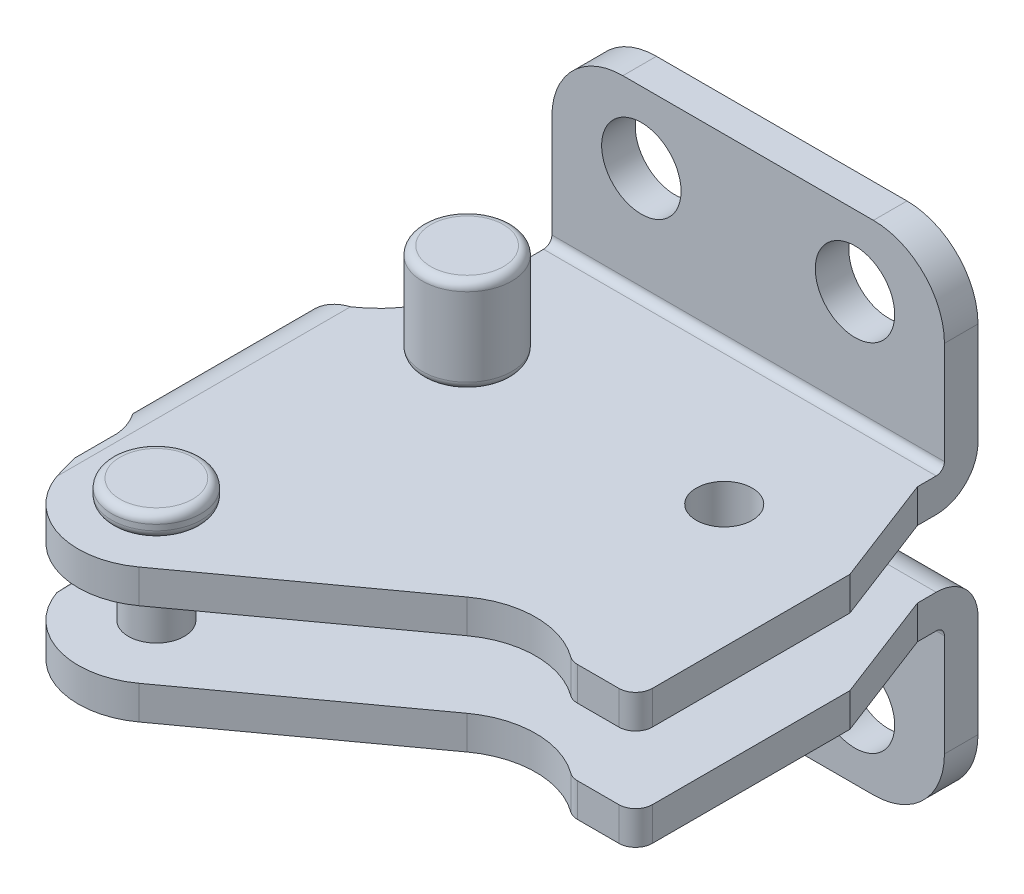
ISO-10303-21;
HEADER;
FILE_DESCRIPTION(('STEP AP214'),'2;1');
FILE_NAME('part.step','',(''),(''),'','','');
FILE_SCHEMA(('AUTOMOTIVE_DESIGN { 1 0 10303 214 1 1 1 1 }'));
ENDSEC;
DATA;
#1=APPLICATION_CONTEXT('core data for automotive mechanical design processes');
#2=APPLICATION_PROTOCOL_DEFINITION('international standard','automotive_design',2000,#1);
#3=PRODUCT_CONTEXT('',#1,'mechanical');
#4=PRODUCT('Part','Part','',(#3));
#5=PRODUCT_RELATED_PRODUCT_CATEGORY('part','',(#4));
#6=PRODUCT_DEFINITION_FORMATION('','',#4);
#7=PRODUCT_DEFINITION_CONTEXT('part definition',#1,'design');
#8=PRODUCT_DEFINITION('design','',#6,#7);
#9=PRODUCT_DEFINITION_SHAPE('','',#8);
#10=(LENGTH_UNIT() NAMED_UNIT(*) SI_UNIT(.MILLI.,.METRE.));
#11=(NAMED_UNIT(*) PLANE_ANGLE_UNIT() SI_UNIT($,.RADIAN.));
#12=(NAMED_UNIT(*) SI_UNIT($,.STERADIAN.) SOLID_ANGLE_UNIT());
#13=UNCERTAINTY_MEASURE_WITH_UNIT(LENGTH_MEASURE(1.E-05),#10,'distance_accuracy_value','');
#14=(GEOMETRIC_REPRESENTATION_CONTEXT(3) GLOBAL_UNCERTAINTY_ASSIGNED_CONTEXT((#13)) GLOBAL_UNIT_ASSIGNED_CONTEXT((#10,
#11,#12)) REPRESENTATION_CONTEXT('',''));
#15=CARTESIAN_POINT('',(0.,0.,0.));
#16=DIRECTION('',(0.,0.,1.));
#17=DIRECTION('',(1.,0.,0.));
#18=AXIS2_PLACEMENT_3D('',#15,#16,#17);
#19=CARTESIAN_POINT('',(-5.5872474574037,7.86011546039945,31.83248562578));
#20=DIRECTION('',(0.,1.,0.));
#21=DIRECTION('',(-1.,0.,0.));
#22=AXIS2_PLACEMENT_3D('',#19,#20,#21);
#23=PLANE('',#22);
#24=CARTESIAN_POINT('',(-5.5872474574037,7.86011546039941,40.7739069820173));
#25=DIRECTION('',(0.,-1.,0.));
#26=DIRECTION('',(-1.,0.,0.));
#27=AXIS2_PLACEMENT_3D('',#24,#25,#26);
#28=CIRCLE('',#27,3.25);
#29=CARTESIAN_POINT('',(-8.8372474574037,7.86011546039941,40.7739069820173));
#30=VERTEX_POINT('',#29);
#31=EDGE_CURVE('E898',#30,#30,#28,.T.);
#32=ORIENTED_EDGE('',*,*,#31,.T.);
#33=EDGE_LOOP('',(#32));
#34=FACE_BOUND('',#33,.T.);
#35=ADVANCED_FACE('F14',(#34),#23,.F.);
#36=CARTESIAN_POINT('',(-5.5872474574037,8.61011546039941,40.7739069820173));
#37=DIRECTION('',(0.,1.,0.));
#38=DIRECTION('',(-1.,0.,0.));
#39=AXIS2_PLACEMENT_3D('',#36,#37,#38);
#40=TOROIDAL_SURFACE('',#39,3.25,0.75);
#41=CARTESIAN_POINT('',(-5.5872474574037,8.61011546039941,40.7739069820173));
#42=DIRECTION('',(0.,1.,0.));
#43=DIRECTION('',(-1.,0.,0.));
#44=AXIS2_PLACEMENT_3D('',#41,#42,#43);
#45=CIRCLE('',#44,4.);
#46=CARTESIAN_POINT('',(-9.5872474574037,8.61011546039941,40.7739069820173));
#47=VERTEX_POINT('',#46);
#48=EDGE_CURVE('E909',#47,#47,#45,.T.);
#49=ORIENTED_EDGE('',*,*,#48,.F.);
#50=EDGE_LOOP('',(#49));
#51=FACE_BOUND('',#50,.T.);
#52=ORIENTED_EDGE('',*,*,#31,.F.);
#53=EDGE_LOOP('',(#52));
#54=FACE_BOUND('',#53,.T.);
#55=ADVANCED_FACE('F1119',(#51,#54),#40,.T.);
#56=CARTESIAN_POINT('',(-5.5872474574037,9.86011546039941,40.7739069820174));
#57=DIRECTION('',(0.,-1.,0.));
#58=DIRECTION('',(1.,0.,0.));
#59=AXIS2_PLACEMENT_3D('',#56,#57,#58);
#60=CYLINDRICAL_SURFACE('',#59,4.);
#61=ORIENTED_EDGE('',*,*,#48,.T.);
#62=EDGE_LOOP('',(#61));
#63=FACE_BOUND('',#62,.T.);
#64=CARTESIAN_POINT('',(-5.5872474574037,9.11011546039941,40.7739069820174));
#65=DIRECTION('',(0.,-1.,0.));
#66=DIRECTION('',(-1.,0.,0.));
#67=AXIS2_PLACEMENT_3D('',#64,#65,#66);
#68=CIRCLE('',#67,4.);
#69=CARTESIAN_POINT('',(-9.5872474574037,9.11011546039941,40.7739069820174));
#70=VERTEX_POINT('',#69);
#71=EDGE_CURVE('E904',#70,#70,#68,.T.);
#72=ORIENTED_EDGE('',*,*,#71,.T.);
#73=EDGE_LOOP('',(#72));
#74=FACE_BOUND('',#73,.T.);
#75=ADVANCED_FACE('F1111',(#63,#74),#60,.T.);
#76=CARTESIAN_POINT('',(-5.5872474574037,9.11011546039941,40.7739069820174));
#77=DIRECTION('',(0.,1.,0.));
#78=DIRECTION('',(-1.,0.,0.));
#79=AXIS2_PLACEMENT_3D('',#76,#77,#78);
#80=TOROIDAL_SURFACE('',#79,3.25,0.75);
#81=CARTESIAN_POINT('',(-5.5872474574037,9.86011546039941,40.7739069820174));
#82=DIRECTION('',(0.,1.,0.));
#83=DIRECTION('',(-1.,0.,0.));
#84=AXIS2_PLACEMENT_3D('',#81,#82,#83);
#85=CIRCLE('',#84,3.25);
#86=CARTESIAN_POINT('',(-8.8372474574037,9.86011546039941,40.7739069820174));
#87=VERTEX_POINT('',#86);
#88=EDGE_CURVE('E916',#87,#87,#85,.T.);
#89=ORIENTED_EDGE('',*,*,#88,.F.);
#90=EDGE_LOOP('',(#89));
#91=FACE_BOUND('',#90,.T.);
#92=ORIENTED_EDGE('',*,*,#71,.F.);
#93=EDGE_LOOP('',(#92));
#94=FACE_BOUND('',#93,.T.);
#95=ADVANCED_FACE('F1103',(#91,#94),#80,.T.);
#96=CARTESIAN_POINT('',(-5.5872474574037,9.86011546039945,31.83248562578));
#97=DIRECTION('',(0.,1.,0.));
#98=DIRECTION('',(-1.,0.,0.));
#99=AXIS2_PLACEMENT_3D('',#96,#97,#98);
#100=PLANE('',#99);
#101=ORIENTED_EDGE('',*,*,#88,.T.);
#102=EDGE_LOOP('',(#101));
#103=FACE_BOUND('',#102,.T.);
#104=CARTESIAN_POINT('',(-5.5872474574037,9.86011546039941,40.7739069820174));
#105=DIRECTION('',(0.,-1.,0.));
#106=DIRECTION('',(-1.,0.,0.));
#107=AXIS2_PLACEMENT_3D('',#104,#105,#106);
#108=CIRCLE('',#107,2.5);
#109=CARTESIAN_POINT('',(-8.0872474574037,9.86011546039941,40.7739069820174));
#110=VERTEX_POINT('',#109);
#111=EDGE_CURVE('E902',#110,#110,#108,.T.);
#112=ORIENTED_EDGE('',*,*,#111,.T.);
#113=EDGE_LOOP('',(#112));
#114=FACE_BOUND('',#113,.T.);
#115=ADVANCED_FACE('F1096',(#103,#114),#100,.T.);
#116=CARTESIAN_POINT('',(-5.5872474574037,23.9001154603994,40.7739069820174));
#117=DIRECTION('',(0.,-1.,0.));
#118=DIRECTION('',(1.,0.,0.));
#119=AXIS2_PLACEMENT_3D('',#116,#117,#118);
#120=CYLINDRICAL_SURFACE('',#119,2.5);
#121=ORIENTED_EDGE('',*,*,#111,.F.);
#122=EDGE_LOOP('',(#121));
#123=FACE_BOUND('',#122,.T.);
#124=CARTESIAN_POINT('',(-5.5872474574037,9.89570811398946,40.7739069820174));
#125=DIRECTION('',(0.,1.,0.));
#126=DIRECTION('',(-1.,0.,0.));
#127=AXIS2_PLACEMENT_3D('',#124,#125,#126);
#128=CIRCLE('',#127,2.5);
#129=CARTESIAN_POINT('',(-8.0872474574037,9.89570811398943,40.7739069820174));
#130=VERTEX_POINT('',#129);
#131=EDGE_CURVE('E894',#130,#130,#128,.F.);
#132=ORIENTED_EDGE('',*,*,#131,.T.);
#133=EDGE_LOOP('',(#132));
#134=FACE_BOUND('',#133,.T.);
#135=ADVANCED_FACE('F1086',(#123,#134),#120,.T.);
#136=CARTESIAN_POINT('',(-5.5872474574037,12.8957081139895,40.7739069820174));
#137=DIRECTION('',(0.,1.,0.));
#138=DIRECTION('',(-1.,0.,0.));
#139=AXIS2_PLACEMENT_3D('',#136,#137,#138);
#140=CIRCLE('',#139,2.5);
#141=CARTESIAN_POINT('',(-8.0872474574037,12.8957081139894,40.7739069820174));
#142=VERTEX_POINT('',#141);
#143=EDGE_CURVE('E24',#142,#142,#140,.F.);
#144=ORIENTED_EDGE('',*,*,#143,.F.);
#145=EDGE_LOOP('',(#144));
#146=FACE_BOUND('',#145,.T.);
#147=CARTESIAN_POINT('',(-5.5872474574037,18.9001154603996,40.7739069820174));
#148=DIRECTION('',(0.,-1.,0.));
#149=DIRECTION('',(1.,0.,0.));
#150=AXIS2_PLACEMENT_3D('',#147,#148,#149);
#151=CIRCLE('',#150,2.5);
#152=CARTESIAN_POINT('',(-3.0872474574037,18.9001154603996,40.7739069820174));
#153=VERTEX_POINT('',#152);
#154=EDGE_CURVE('E9',#153,#153,#151,.F.);
#155=ORIENTED_EDGE('',*,*,#154,.F.);
#156=EDGE_LOOP('',(#155));
#157=FACE_BOUND('',#156,.T.);
#158=ADVANCED_FACE('F943',(#146,#157),#120,.T.);
#159=CARTESIAN_POINT('',(-5.5872474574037,23.9001154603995,31.8324856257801));
#160=DIRECTION('',(0.,1.,0.));
#161=DIRECTION('',(-1.,0.,0.));
#162=AXIS2_PLACEMENT_3D('',#159,#160,#161);
#163=PLANE('',#162);
#164=CARTESIAN_POINT('',(-5.5872474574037,23.9001154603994,40.7739069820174));
#165=DIRECTION('',(0.,1.,0.));
#166=DIRECTION('',(-1.,0.,0.));
#167=AXIS2_PLACEMENT_3D('',#164,#165,#166);
#168=CIRCLE('',#167,3.25);
#169=CARTESIAN_POINT('',(-8.8372474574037,23.9001154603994,40.7739069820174));
#170=VERTEX_POINT('',#169);
#171=EDGE_CURVE('E857',#170,#170,#168,.T.);
#172=ORIENTED_EDGE('',*,*,#171,.T.);
#173=EDGE_LOOP('',(#172));
#174=FACE_BOUND('',#173,.T.);
#175=ADVANCED_FACE('F1066',(#174),#163,.T.);
#176=CARTESIAN_POINT('',(-5.5872474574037,23.1501154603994,40.7739069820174));
#177=DIRECTION('',(0.,1.,0.));
#178=DIRECTION('',(-1.,0.,0.));
#179=AXIS2_PLACEMENT_3D('',#176,#177,#178);
#180=TOROIDAL_SURFACE('',#179,3.25,0.75);
#181=ORIENTED_EDGE('',*,*,#171,.F.);
#182=EDGE_LOOP('',(#181));
#183=FACE_BOUND('',#182,.T.);
#184=CARTESIAN_POINT('',(-5.5872474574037,23.1501154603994,40.7739069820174));
#185=DIRECTION('',(0.,-1.,0.));
#186=DIRECTION('',(-1.,0.,0.));
#187=AXIS2_PLACEMENT_3D('',#184,#185,#186);
#188=CIRCLE('',#187,4.);
#189=CARTESIAN_POINT('',(-9.5872474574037,23.1501154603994,40.7739069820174));
#190=VERTEX_POINT('',#189);
#191=EDGE_CURVE('E908',#190,#190,#188,.T.);
#192=ORIENTED_EDGE('',*,*,#191,.F.);
#193=EDGE_LOOP('',(#192));
#194=FACE_BOUND('',#193,.T.);
#195=ADVANCED_FACE('F1056',(#183,#194),#180,.T.);
#196=CARTESIAN_POINT('',(-5.5872474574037,21.9001154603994,40.7739069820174));
#197=DIRECTION('',(0.,1.,0.));
#198=DIRECTION('',(-1.,0.,0.));
#199=AXIS2_PLACEMENT_3D('',#196,#197,#198);
#200=CYLINDRICAL_SURFACE('',#199,4.);
#201=ORIENTED_EDGE('',*,*,#191,.T.);
#202=EDGE_LOOP('',(#201));
#203=FACE_BOUND('',#202,.T.);
#204=CARTESIAN_POINT('',(-5.5872474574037,22.6501154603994,40.7739069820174));
#205=DIRECTION('',(0.,1.,0.));
#206=DIRECTION('',(1.,0.,0.));
#207=AXIS2_PLACEMENT_3D('',#204,#205,#206);
#208=CIRCLE('',#207,4.);
#209=CARTESIAN_POINT('',(-1.5872474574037,22.6501154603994,40.7739069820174));
#210=VERTEX_POINT('',#209);
#211=EDGE_CURVE('E897',#210,#210,#208,.T.);
#212=ORIENTED_EDGE('',*,*,#211,.T.);
#213=EDGE_LOOP('',(#212));
#214=FACE_BOUND('',#213,.T.);
#215=ADVANCED_FACE('F975',(#203,#214),#200,.T.);
#216=CARTESIAN_POINT('',(-5.5872474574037,22.6501154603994,40.7739069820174));
#217=DIRECTION('',(0.,-1.,0.));
#218=DIRECTION('',(1.,0.,0.));
#219=AXIS2_PLACEMENT_3D('',#216,#217,#218);
#220=TOROIDAL_SURFACE('',#219,3.25,0.75);
#221=CARTESIAN_POINT('',(-5.5872474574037,21.9001154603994,40.7739069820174));
#222=DIRECTION('',(0.,-1.,0.));
#223=DIRECTION('',(1.,0.,0.));
#224=AXIS2_PLACEMENT_3D('',#221,#222,#223);
#225=CIRCLE('',#224,3.25);
#226=CARTESIAN_POINT('',(-2.3372474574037,21.9001154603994,40.7739069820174));
#227=VERTEX_POINT('',#226);
#228=EDGE_CURVE('E903',#227,#227,#225,.T.);
#229=ORIENTED_EDGE('',*,*,#228,.F.);
#230=EDGE_LOOP('',(#229));
#231=FACE_BOUND('',#230,.T.);
#232=ORIENTED_EDGE('',*,*,#211,.F.);
#233=EDGE_LOOP('',(#232));
#234=FACE_BOUND('',#233,.T.);
#235=ADVANCED_FACE('F964',(#231,#234),#220,.T.);
#236=CARTESIAN_POINT('',(0.225355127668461,30.4001154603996,23.6333484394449));
#237=DIRECTION('',(0.,-1.,0.));
#238=DIRECTION('',(-0.923728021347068,0.,0.383049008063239));
#239=AXIS2_PLACEMENT_3D('',#236,#237,#238);
#240=PLANE('',#239);
#241=CARTESIAN_POINT('',(-3.1996474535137,30.4001154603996,15.3739069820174));
#242=DIRECTION('',(0.,1.,0.));
#243=DIRECTION('',(-0.923728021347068,0.,0.383049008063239));
#244=AXIS2_PLACEMENT_3D('',#241,#242,#243);
#245=CIRCLE('',#244,3.25);
#246=CARTESIAN_POINT('',(-6.20176352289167,30.4001154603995,16.6188162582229));
#247=VERTEX_POINT('',#246);
#248=EDGE_CURVE('E862',#247,#247,#245,.T.);
#249=ORIENTED_EDGE('',*,*,#248,.T.);
#250=EDGE_LOOP('',(#249));
#251=FACE_BOUND('',#250,.T.);
#252=ADVANCED_FACE('F961',(#251),#240,.F.);
#253=CARTESIAN_POINT('',(0.,0.,3.));
#254=DIRECTION('',(0.,0.,1.));
#255=DIRECTION('',(1.,0.,0.));
#256=AXIS2_PLACEMENT_3D('',#253,#254,#255);
#257=CYLINDRICAL_SURFACE('',#256,3.55);
#258=CARTESIAN_POINT('',(0.,0.,3.));
#259=DIRECTION('',(0.,0.,1.));
#260=DIRECTION('',(1.,0.,0.));
#261=AXIS2_PLACEMENT_3D('',#258,#259,#260);
#262=CIRCLE('',#261,3.55);
#263=CARTESIAN_POINT('',(3.55,0.,3.));
#264=VERTEX_POINT('',#263);
#265=EDGE_CURVE('E489',#264,#264,#262,.T.);
#266=ORIENTED_EDGE('',*,*,#265,.T.);
#267=EDGE_LOOP('',(#266));
#268=FACE_BOUND('',#267,.T.);
#269=CARTESIAN_POINT('',(0.,0.,0.));
#270=DIRECTION('',(0.,0.,-1.));
#271=DIRECTION('',(-1.,0.,0.));
#272=AXIS2_PLACEMENT_3D('',#269,#270,#271);
#273=CIRCLE('',#272,3.55);
#274=CARTESIAN_POINT('',(-3.55,0.,0.));
#275=VERTEX_POINT('',#274);
#276=EDGE_CURVE('E484',#275,#275,#273,.T.);
#277=ORIENTED_EDGE('',*,*,#276,.T.);
#278=EDGE_LOOP('',(#277));
#279=FACE_BOUND('',#278,.T.);
#280=ADVANCED_FACE('F963',(#268,#279),#257,.F.);
#281=CARTESIAN_POINT('',(19.1,2.35922392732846E-13,3.00000000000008));
#282=DIRECTION('',(0.,0.,1.));
#283=DIRECTION('',(1.,0.,0.));
#284=AXIS2_PLACEMENT_3D('',#281,#282,#283);
#285=CYLINDRICAL_SURFACE('',#284,3.55);
#286=CARTESIAN_POINT('',(19.1,2.35922392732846E-13,3.00000000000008));
#287=DIRECTION('',(0.,0.,1.));
#288=DIRECTION('',(1.,0.,0.));
#289=AXIS2_PLACEMENT_3D('',#286,#287,#288);
#290=CIRCLE('',#289,3.55);
#291=CARTESIAN_POINT('',(22.65,2.85300180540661E-13,3.00000000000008));
#292=VERTEX_POINT('',#291);
#293=EDGE_CURVE('E488',#292,#292,#290,.T.);
#294=ORIENTED_EDGE('',*,*,#293,.T.);
#295=EDGE_LOOP('',(#294));
#296=FACE_BOUND('',#295,.T.);
#297=CARTESIAN_POINT('',(19.1,2.4980018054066E-13,0.));
#298=DIRECTION('',(0.,0.,-1.));
#299=DIRECTION('',(-1.,0.,0.));
#300=AXIS2_PLACEMENT_3D('',#297,#298,#299);
#301=CIRCLE('',#300,3.55);
#302=CARTESIAN_POINT('',(15.55,2.00422392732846E-13,0.));
#303=VERTEX_POINT('',#302);
#304=EDGE_CURVE('E592',#303,#303,#301,.T.);
#305=ORIENTED_EDGE('',*,*,#304,.T.);
#306=EDGE_LOOP('',(#305));
#307=FACE_BOUND('',#306,.T.);
#308=ADVANCED_FACE('F972',(#296,#307),#285,.F.);
#309=CARTESIAN_POINT('',(27.1,14.3500000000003,0.));
#310=DIRECTION('',(-1.,0.,0.));
#311=DIRECTION('',(0.,-1.,0.));
#312=AXIS2_PLACEMENT_3D('',#309,#310,#311);
#313=PLANE('',#312);
#314=DIRECTION('',(0.,-1.,0.));
#315=VECTOR('',#314,1.);
#316=CARTESIAN_POINT('',(27.1,14.3500000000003,0.));
#317=LINE('',#316,#315);
#318=CARTESIAN_POINT('',(27.1,9.15570811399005,0.));
#319=VERTEX_POINT('',#318);
#320=CARTESIAN_POINT('',(27.1,2.4980018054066E-13,0.));
#321=VERTEX_POINT('',#320);
#322=EDGE_CURVE('E447',#319,#321,#317,.T.);
#323=ORIENTED_EDGE('',*,*,#322,.F.);
#324=CARTESIAN_POINT('',(27.1,9.15570811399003,3.74));
#325=DIRECTION('',(-1.,0.,0.));
#326=DIRECTION('',(0.,-1.,0.));
#327=AXIS2_PLACEMENT_3D('',#324,#325,#326);
#328=CIRCLE('',#327,3.74);
#329=CARTESIAN_POINT('',(27.1,12.89570811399,3.74));
#330=VERTEX_POINT('',#329);
#331=EDGE_CURVE('E715',#330,#319,#328,.T.);
#332=ORIENTED_EDGE('',*,*,#331,.F.);
#333=DIRECTION('',(0.,0.,-1.));
#334=VECTOR('',#333,1.);
#335=CARTESIAN_POINT('',(27.1,12.89570811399,5.41570811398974));
#336=LINE('',#335,#334);
#337=CARTESIAN_POINT('',(27.1,12.89570811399,5.41570811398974));
#338=VERTEX_POINT('',#337);
#339=EDGE_CURVE('E283',#338,#330,#336,.T.);
#340=ORIENTED_EDGE('',*,*,#339,.F.);
#341=DIRECTION('',(0.,-1.,0.));
#342=VECTOR('',#341,1.);
#343=CARTESIAN_POINT('',(27.1,12.89570811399,5.41570811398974));
#344=LINE('',#343,#342);
#345=CARTESIAN_POINT('',(27.1,9.89570811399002,5.41570811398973));
#346=VERTEX_POINT('',#345);
#347=EDGE_CURVE('E495',#338,#346,#344,.T.);
#348=ORIENTED_EDGE('',*,*,#347,.T.);
#349=DIRECTION('',(0.,0.,-1.));
#350=VECTOR('',#349,1.);
#351=CARTESIAN_POINT('',(27.1,9.89570811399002,5.41570811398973));
#352=LINE('',#351,#350);
#353=CARTESIAN_POINT('',(27.1,9.89570811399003,3.74));
#354=VERTEX_POINT('',#353);
#355=EDGE_CURVE('E131',#346,#354,#352,.T.);
#356=ORIENTED_EDGE('',*,*,#355,.T.);
#357=CARTESIAN_POINT('',(27.1,9.15570811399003,3.74));
#358=DIRECTION('',(-1.,0.,0.));
#359=DIRECTION('',(0.,-1.,0.));
#360=AXIS2_PLACEMENT_3D('',#357,#358,#359);
#361=CIRCLE('',#360,0.74);
#362=CARTESIAN_POINT('',(27.1,9.15570811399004,3.));
#363=VERTEX_POINT('',#362);
#364=EDGE_CURVE('E121',#354,#363,#361,.T.);
#365=ORIENTED_EDGE('',*,*,#364,.T.);
#366=DIRECTION('',(0.,-1.,0.));
#367=VECTOR('',#366,1.);
#368=CARTESIAN_POINT('',(27.1,14.3500000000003,3.));
#369=LINE('',#368,#367);
#370=CARTESIAN_POINT('',(27.1,3.33066907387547E-13,3.));
#371=VERTEX_POINT('',#370);
#372=EDGE_CURVE('E571',#363,#371,#369,.T.);
#373=ORIENTED_EDGE('',*,*,#372,.T.);
#374=DIRECTION('',(0.,0.,1.));
#375=VECTOR('',#374,1.);
#376=CARTESIAN_POINT('',(27.1,2.4980018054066E-13,0.));
#377=LINE('',#376,#375);
#378=EDGE_CURVE('E490',#321,#371,#377,.T.);
#379=ORIENTED_EDGE('',*,*,#378,.F.);
#380=EDGE_LOOP('',(#323,#332,#340,#348,#356,#365,#373,#379));
#381=FACE_BOUND('',#380,.T.);
#382=ADVANCED_FACE('F1217',(#381),#313,.F.);
#383=CARTESIAN_POINT('',(20.75,2.01227923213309E-13,0.));
#384=DIRECTION('',(0.,0.,1.));
#385=DIRECTION('',(1.,0.,0.));
#386=AXIS2_PLACEMENT_3D('',#383,#384,#385);
#387=CYLINDRICAL_SURFACE('',#386,6.35);
#388=CARTESIAN_POINT('',(20.75,1.87350135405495E-13,3.));
#389=DIRECTION('',(0.,0.,-1.));
#390=DIRECTION('',(-1.,0.,0.));
#391=AXIS2_PLACEMENT_3D('',#388,#389,#390);
#392=CIRCLE('',#391,6.35);
#393=CARTESIAN_POINT('',(20.75,-6.34999999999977,3.));
#394=VERTEX_POINT('',#393);
#395=EDGE_CURVE('E494',#371,#394,#392,.T.);
#396=ORIENTED_EDGE('',*,*,#395,.T.);
#397=DIRECTION('',(0.,0.,1.));
#398=VECTOR('',#397,1.);
#399=CARTESIAN_POINT('',(20.75,-6.34999999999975,0.));
#400=LINE('',#399,#398);
#401=CARTESIAN_POINT('',(20.75,-6.34999999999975,0.));
#402=VERTEX_POINT('',#401);
#403=EDGE_CURVE('E579',#402,#394,#400,.T.);
#404=ORIENTED_EDGE('',*,*,#403,.F.);
#405=CARTESIAN_POINT('',(20.75,2.01227923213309E-13,0.));
#406=DIRECTION('',(0.,0.,-1.));
#407=DIRECTION('',(-1.,0.,0.));
#408=AXIS2_PLACEMENT_3D('',#405,#406,#407);
#409=CIRCLE('',#408,6.35);
#410=EDGE_CURVE('E542',#321,#402,#409,.T.);
#411=ORIENTED_EDGE('',*,*,#410,.F.);
#412=ORIENTED_EDGE('',*,*,#378,.T.);
#413=EDGE_LOOP('',(#396,#404,#411,#412));
#414=FACE_BOUND('',#413,.T.);
#415=ADVANCED_FACE('F1236',(#414),#387,.T.);
#416=CARTESIAN_POINT('',(-1.64999999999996,-6.35,0.));
#417=DIRECTION('',(0.,1.,0.));
#418=DIRECTION('',(0.,0.,1.));
#419=AXIS2_PLACEMENT_3D('',#416,#417,#418);
#420=PLANE('',#419);
#421=DIRECTION('',(-1.,0.,0.));
#422=VECTOR('',#421,1.);
#423=CARTESIAN_POINT('',(-1.64999999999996,-6.35,3.));
#424=LINE('',#423,#422);
#425=CARTESIAN_POINT('',(-1.64999999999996,-6.35,3.));
#426=VERTEX_POINT('',#425);
#427=EDGE_CURVE('E463',#394,#426,#424,.T.);
#428=ORIENTED_EDGE('',*,*,#427,.T.);
#429=DIRECTION('',(0.,0.,1.));
#430=VECTOR('',#429,1.);
#431=CARTESIAN_POINT('',(-1.64999999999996,-6.35,0.));
#432=LINE('',#431,#430);
#433=CARTESIAN_POINT('',(-1.64999999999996,-6.35,0.));
#434=VERTEX_POINT('',#433);
#435=EDGE_CURVE('E458',#434,#426,#432,.T.);
#436=ORIENTED_EDGE('',*,*,#435,.F.);
#437=DIRECTION('',(-1.,0.,0.));
#438=VECTOR('',#437,1.);
#439=CARTESIAN_POINT('',(-1.64999999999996,-6.35,0.));
#440=LINE('',#439,#438);
#441=EDGE_CURVE('E622',#402,#434,#440,.T.);
#442=ORIENTED_EDGE('',*,*,#441,.F.);
#443=ORIENTED_EDGE('',*,*,#403,.T.);
#444=EDGE_LOOP('',(#428,#436,#442,#443));
#445=FACE_BOUND('',#444,.T.);
#446=ADVANCED_FACE('F1227',(#445),#420,.F.);
#447=CARTESIAN_POINT('',(-1.65000000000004,-1.04083408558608E-13,0.));
#448=DIRECTION('',(0.,0.,1.));
#449=DIRECTION('',(1.,0.,0.));
#450=AXIS2_PLACEMENT_3D('',#447,#448,#449);
#451=CYLINDRICAL_SURFACE('',#450,6.35);
#452=CARTESIAN_POINT('',(-1.65000000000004,-1.17961196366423E-13,3.));
#453=DIRECTION('',(0.,0.,-1.));
#454=DIRECTION('',(-1.,0.,0.));
#455=AXIS2_PLACEMENT_3D('',#452,#453,#454);
#456=CIRCLE('',#455,6.35);
#457=CARTESIAN_POINT('',(-8.,-1.66533453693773E-13,3.));
#458=VERTEX_POINT('',#457);
#459=EDGE_CURVE('E462',#426,#458,#456,.T.);
#460=ORIENTED_EDGE('',*,*,#459,.T.);
#461=DIRECTION('',(0.,0.,1.));
#462=VECTOR('',#461,1.);
#463=CARTESIAN_POINT('',(-8.,-1.52655665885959E-13,0.));
#464=LINE('',#463,#462);
#465=CARTESIAN_POINT('',(-8.,-1.52655665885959E-13,0.));
#466=VERTEX_POINT('',#465);
#467=EDGE_CURVE('E482',#466,#458,#464,.T.);
#468=ORIENTED_EDGE('',*,*,#467,.F.);
#469=CARTESIAN_POINT('',(-1.65000000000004,-1.04083408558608E-13,0.));
#470=DIRECTION('',(0.,0.,-1.));
#471=DIRECTION('',(-1.,0.,0.));
#472=AXIS2_PLACEMENT_3D('',#469,#470,#471);
#473=CIRCLE('',#472,6.35);
#474=EDGE_CURVE('E575',#434,#466,#473,.T.);
#475=ORIENTED_EDGE('',*,*,#474,.F.);
#476=ORIENTED_EDGE('',*,*,#435,.T.);
#477=EDGE_LOOP('',(#460,#468,#475,#476));
#478=FACE_BOUND('',#477,.T.);
#479=ADVANCED_FACE('F1222',(#478),#451,.T.);
#480=CARTESIAN_POINT('',(-8.0000000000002,17.8923924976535,0.));
#481=DIRECTION('',(1.,0.,0.));
#482=DIRECTION('',(0.,1.,0.));
#483=AXIS2_PLACEMENT_3D('',#480,#481,#482);
#484=PLANE('',#483);
#485=DIRECTION('',(0.,1.,0.));
#486=VECTOR('',#485,1.);
#487=CARTESIAN_POINT('',(-8.0000000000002,17.8923924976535,3.));
#488=LINE('',#487,#486);
#489=CARTESIAN_POINT('',(-8.0000000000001,9.15570811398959,3.));
#490=VERTEX_POINT('',#489);
#491=EDGE_CURVE('E479',#458,#490,#488,.T.);
#492=ORIENTED_EDGE('',*,*,#491,.T.);
#493=CARTESIAN_POINT('',(-8.0000000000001,9.15570811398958,3.74));
#494=DIRECTION('',(1.,0.,0.));
#495=DIRECTION('',(0.,-1.,0.));
#496=AXIS2_PLACEMENT_3D('',#493,#494,#495);
#497=CIRCLE('',#496,0.74);
#498=CARTESIAN_POINT('',(-8.0000000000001,9.89570811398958,3.74));
#499=VERTEX_POINT('',#498);
#500=EDGE_CURVE('E116',#490,#499,#497,.T.);
#501=ORIENTED_EDGE('',*,*,#500,.T.);
#502=DIRECTION('',(0.,0.,1.));
#503=VECTOR('',#502,1.);
#504=CARTESIAN_POINT('',(-8.0000000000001,9.89570811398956,8.95810061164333));
#505=LINE('',#504,#503);
#506=CARTESIAN_POINT('',(-8.0000000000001,9.89570811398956,8.95810061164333));
#507=VERTEX_POINT('',#506);
#508=EDGE_CURVE('E38',#499,#507,#505,.T.);
#509=ORIENTED_EDGE('',*,*,#508,.T.);
#510=DIRECTION('',(0.,-1.,0.));
#511=VECTOR('',#510,1.);
#512=CARTESIAN_POINT('',(-8.00000000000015,12.8957081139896,8.95810061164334));
#513=LINE('',#512,#511);
#514=CARTESIAN_POINT('',(-8.00000000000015,12.8957081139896,8.95810061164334));
#515=VERTEX_POINT('',#514);
#516=EDGE_CURVE('E284',#515,#507,#513,.T.);
#517=ORIENTED_EDGE('',*,*,#516,.F.);
#518=DIRECTION('',(0.,0.,1.));
#519=VECTOR('',#518,1.);
#520=CARTESIAN_POINT('',(-8.00000000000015,12.8957081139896,8.95810061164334));
#521=LINE('',#520,#519);
#522=CARTESIAN_POINT('',(-8.00000000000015,12.8957081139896,3.74));
#523=VERTEX_POINT('',#522);
#524=EDGE_CURVE('E201',#523,#515,#521,.T.);
#525=ORIENTED_EDGE('',*,*,#524,.F.);
#526=CARTESIAN_POINT('',(-8.0000000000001,9.15570811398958,3.74));
#527=DIRECTION('',(1.,0.,0.));
#528=DIRECTION('',(0.,1.,0.));
#529=AXIS2_PLACEMENT_3D('',#526,#527,#528);
#530=CIRCLE('',#529,3.74);
#531=CARTESIAN_POINT('',(-8.0000000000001,9.1557081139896,0.));
#532=VERTEX_POINT('',#531);
#533=EDGE_CURVE('E711',#532,#523,#530,.T.);
#534=ORIENTED_EDGE('',*,*,#533,.F.);
#535=DIRECTION('',(0.,1.,0.));
#536=VECTOR('',#535,1.);
#537=CARTESIAN_POINT('',(-8.0000000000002,17.8923924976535,0.));
#538=LINE('',#537,#536);
#539=EDGE_CURVE('E446',#466,#532,#538,.T.);
#540=ORIENTED_EDGE('',*,*,#539,.F.);
#541=ORIENTED_EDGE('',*,*,#467,.T.);
#542=EDGE_LOOP('',(#492,#501,#509,#517,#525,#534,#540,#541));
#543=FACE_BOUND('',#542,.T.);
#544=ADVANCED_FACE('F316',(#543),#484,.F.);
#545=CARTESIAN_POINT('',(-3.1996474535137,29.6501154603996,15.3739069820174));
#546=DIRECTION('',(0.,-1.,0.));
#547=DIRECTION('',(-0.923728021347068,0.,0.383049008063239));
#548=AXIS2_PLACEMENT_3D('',#545,#546,#547);
#549=TOROIDAL_SURFACE('',#548,3.25,0.75);
#550=CARTESIAN_POINT('',(-3.1996474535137,29.6501154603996,15.3739069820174));
#551=DIRECTION('',(0.,-1.,0.));
#552=DIRECTION('',(-0.923728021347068,0.,0.383049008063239));
#553=AXIS2_PLACEMENT_3D('',#550,#551,#552);
#554=CIRCLE('',#553,4.);
#555=CARTESIAN_POINT('',(-6.89455953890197,29.6501154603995,16.9061030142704));
#556=VERTEX_POINT('',#555);
#557=EDGE_CURVE('E868',#556,#556,#554,.T.);
#558=ORIENTED_EDGE('',*,*,#557,.F.);
#559=EDGE_LOOP('',(#558));
#560=FACE_BOUND('',#559,.T.);
#561=ORIENTED_EDGE('',*,*,#248,.F.);
#562=EDGE_LOOP('',(#561));
#563=FACE_BOUND('',#562,.T.);
#564=ADVANCED_FACE('F1177',(#560,#563),#549,.T.);
#565=CARTESIAN_POINT('',(-12.6784589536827,15.8979117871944,36.9808331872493));
#566=DIRECTION('',(-1.,0.,0.));
#567=DIRECTION('',(0.,-1.,0.));
#568=AXIS2_PLACEMENT_3D('',#565,#566,#567);
#569=CYLINDRICAL_SURFACE('',#568,5.25000783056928);
#570=CARTESIAN_POINT('',(-15.6784589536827,18.4001154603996,32.3654719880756));
#571=CARTESIAN_POINT('',(-12.6784589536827,18.4001154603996,32.3654719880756));
#572=(BOUNDED_CURVE() B_SPLINE_CURVE(1,(#570,#571),.UNSPECIFIED.,.F.,
.F.) B_SPLINE_CURVE_WITH_KNOTS((2,2),(0.,1.),
.UNSPECIFIED.) CURVE() GEOMETRIC_REPRESENTATION_ITEM() RATIONAL_B_SPLINE_CURVE((1.,1.)) REPRESENTATION_ITEM(''));
#573=CARTESIAN_POINT('',(-15.6784589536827,18.4001154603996,32.3654719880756));
#574=VERTEX_POINT('',#573);
#575=CARTESIAN_POINT('',(-12.6784589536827,18.4001154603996,32.3654719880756));
#576=VERTEX_POINT('',#575);
#577=EDGE_CURVE('E2013',#574,#576,#572,.T.);
#578=ORIENTED_EDGE('',*,*,#577,.F.);
#579=CARTESIAN_POINT('',(-15.6784589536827,15.8979117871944,36.9808331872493));
#580=DIRECTION('',(-1.,0.,0.));
#581=DIRECTION('',(0.,1.,0.));
#582=AXIS2_PLACEMENT_3D('',#579,#580,#581);
#583=CIRCLE('',#582,5.25000783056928);
#584=CARTESIAN_POINT('',(-15.6784589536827,13.3957081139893,32.3654719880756));
#585=VERTEX_POINT('',#584);
#586=EDGE_CURVE('E341',#574,#585,#583,.T.);
#587=ORIENTED_EDGE('',*,*,#586,.T.);
#588=CARTESIAN_POINT('',(-15.6784589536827,13.3957081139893,32.3654719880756));
#589=CARTESIAN_POINT('',(-14.6784589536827,13.3957081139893,32.3654719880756));
#590=CARTESIAN_POINT('',(-13.6784589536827,13.3957081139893,32.3654719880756));
#591=CARTESIAN_POINT('',(-12.6784589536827,13.3957081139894,32.3654719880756));
#592=(BOUNDED_CURVE() B_SPLINE_CURVE(3,(#588,#589,#590,#591),.UNSPECIFIED.,.F.,
.F.) B_SPLINE_CURVE_WITH_KNOTS((4,4),(0.,1.),
.UNSPECIFIED.) CURVE() GEOMETRIC_REPRESENTATION_ITEM() RATIONAL_B_SPLINE_CURVE((1.,1.,1.,1.)) REPRESENTATION_ITEM(''));
#593=CARTESIAN_POINT('',(-12.6784589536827,13.3957081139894,32.3654719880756));
#594=VERTEX_POINT('',#593);
#595=EDGE_CURVE('E332',#585,#594,#592,.T.);
#596=ORIENTED_EDGE('',*,*,#595,.T.);
#597=CARTESIAN_POINT('',(-12.6784589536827,15.8979117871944,36.9808331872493));
#598=DIRECTION('',(-1.,0.,0.));
#599=DIRECTION('',(0.,1.,0.));
#600=AXIS2_PLACEMENT_3D('',#597,#598,#599);
#601=CIRCLE('',#600,5.25000783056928);
#602=EDGE_CURVE('E216',#576,#594,#601,.T.);
#603=ORIENTED_EDGE('',*,*,#602,.F.);
#604=EDGE_LOOP('',(#578,#587,#596,#603));
#605=FACE_BOUND('',#604,.T.);
#606=ADVANCED_FACE('F1182',(#605),#569,.F.);
#607=CARTESIAN_POINT('',(-12.6784589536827,15.5759039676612,8.95810061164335));
#608=DIRECTION('',(-1.,0.,0.));
#609=DIRECTION('',(0.,-1.,0.));
#610=AXIS2_PLACEMENT_3D('',#607,#608,#609);
#611=CYLINDRICAL_SURFACE('',#610,9.50024746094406);
#612=CARTESIAN_POINT('',(-12.6784589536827,15.5759039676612,8.95810061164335));
#613=DIRECTION('',(-1.,0.,0.));
#614=DIRECTION('',(0.,1.,0.));
#615=AXIS2_PLACEMENT_3D('',#612,#613,#614);
#616=CIRCLE('',#615,9.50024746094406);
#617=CARTESIAN_POINT('',(-12.6784589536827,13.3957081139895,18.2047999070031));
#618=VERTEX_POINT('',#617);
#619=CARTESIAN_POINT('',(-12.6784589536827,15.5759039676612,18.4583480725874));
#620=VERTEX_POINT('',#619);
#621=EDGE_CURVE('E212',#618,#620,#616,.T.);
#622=ORIENTED_EDGE('',*,*,#621,.F.);
#623=CARTESIAN_POINT('',(-12.6784589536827,13.3957081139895,18.2047999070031));
#624=CARTESIAN_POINT('',(-13.6784589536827,13.3957081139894,18.2047999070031));
#625=CARTESIAN_POINT('',(-14.6784589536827,13.3957081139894,18.2047999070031));
#626=CARTESIAN_POINT('',(-15.6784589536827,13.3957081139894,18.2047999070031));
#627=(BOUNDED_CURVE() B_SPLINE_CURVE(3,(#623,#624,#625,#626),.UNSPECIFIED.,.F.,
.F.) B_SPLINE_CURVE_WITH_KNOTS((4,4),(0.,1.),
.UNSPECIFIED.) CURVE() GEOMETRIC_REPRESENTATION_ITEM() RATIONAL_B_SPLINE_CURVE((1.,1.,1.,1.)) REPRESENTATION_ITEM(''));
#628=CARTESIAN_POINT('',(-15.6784589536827,13.3957081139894,18.2047999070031));
#629=VERTEX_POINT('',#628);
#630=EDGE_CURVE('E1740',#618,#629,#627,.T.);
#631=ORIENTED_EDGE('',*,*,#630,.T.);
#632=CARTESIAN_POINT('',(-15.6784589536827,15.5759039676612,8.95810061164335));
#633=DIRECTION('',(-1.,0.,0.));
#634=DIRECTION('',(0.,1.,0.));
#635=AXIS2_PLACEMENT_3D('',#632,#633,#634);
#636=CIRCLE('',#635,9.50024746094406);
#637=CARTESIAN_POINT('',(-15.6784589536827,15.5759039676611,18.4583480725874));
#638=VERTEX_POINT('',#637);
#639=EDGE_CURVE('E353',#629,#638,#636,.T.);
#640=ORIENTED_EDGE('',*,*,#639,.T.);
#641=DIRECTION('',(-1.,0.,0.));
#642=VECTOR('',#641,1.);
#643=CARTESIAN_POINT('',(-12.6784589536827,15.5759039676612,18.4583480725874));
#644=LINE('',#643,#642);
#645=EDGE_CURVE('E678',#620,#638,#644,.T.);
#646=ORIENTED_EDGE('',*,*,#645,.F.);
#647=EDGE_LOOP('',(#622,#631,#640,#646));
#648=FACE_BOUND('',#647,.T.);
#649=ADVANCED_FACE('F1265',(#648),#611,.F.);
#650=CARTESIAN_POINT('',(-12.6784589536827,15.5759039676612,18.4583480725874));
#651=DIRECTION('',(0.,0.,1.));
#652=DIRECTION('',(0.,1.,0.));
#653=AXIS2_PLACEMENT_3D('',#650,#651,#652);
#654=PLANE('',#653);
#655=DIRECTION('',(0.,1.,0.));
#656=VECTOR('',#655,1.);
#657=CARTESIAN_POINT('',(-15.6784589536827,15.5759039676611,18.4583480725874));
#658=LINE('',#657,#656);
#659=CARTESIAN_POINT('',(-15.6784589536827,16.2194246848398,18.4583480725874));
#660=VERTEX_POINT('',#659);
#661=EDGE_CURVE('E342',#638,#660,#658,.T.);
#662=ORIENTED_EDGE('',*,*,#661,.T.);
#663=DIRECTION('',(-1.,0.,0.));
#664=VECTOR('',#663,1.);
#665=CARTESIAN_POINT('',(-12.6784589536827,16.2194246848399,18.4583480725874));
#666=LINE('',#665,#664);
#667=CARTESIAN_POINT('',(-12.6784589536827,16.2194246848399,18.4583480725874));
#668=VERTEX_POINT('',#667);
#669=EDGE_CURVE('E691',#668,#660,#666,.T.);
#670=ORIENTED_EDGE('',*,*,#669,.F.);
#671=DIRECTION('',(0.,1.,0.));
#672=VECTOR('',#671,1.);
#673=CARTESIAN_POINT('',(-12.6784589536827,15.5759039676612,18.4583480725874));
#674=LINE('',#673,#672);
#675=EDGE_CURVE('E217',#620,#668,#674,.T.);
#676=ORIENTED_EDGE('',*,*,#675,.F.);
#677=ORIENTED_EDGE('',*,*,#645,.T.);
#678=EDGE_LOOP('',(#662,#670,#676,#677));
#679=FACE_BOUND('',#678,.T.);
#680=ADVANCED_FACE('F1274',(#679),#654,.F.);
#681=CARTESIAN_POINT('',(-12.6784589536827,16.2194246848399,8.95810061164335));
#682=DIRECTION('',(-1.,0.,0.));
#683=DIRECTION('',(0.,-1.,0.));
#684=AXIS2_PLACEMENT_3D('',#681,#682,#683);
#685=CYLINDRICAL_SURFACE('',#684,9.50024746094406);
#686=CARTESIAN_POINT('',(-12.6784589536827,18.4001154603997,18.2046831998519));
#687=CARTESIAN_POINT('',(-15.6784589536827,18.4001154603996,18.2046831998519));
#688=(BOUNDED_CURVE() B_SPLINE_CURVE(1,(#686,#687),.UNSPECIFIED.,.F.,
.F.) B_SPLINE_CURVE_WITH_KNOTS((2,2),(0.,1.),
.UNSPECIFIED.) CURVE() GEOMETRIC_REPRESENTATION_ITEM() RATIONAL_B_SPLINE_CURVE((1.,1.)) REPRESENTATION_ITEM(''));
#689=CARTESIAN_POINT('',(-12.6784589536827,18.4001154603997,18.2046831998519));
#690=VERTEX_POINT('',#689);
#691=CARTESIAN_POINT('',(-15.6784589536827,18.4001154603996,18.2046831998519));
#692=VERTEX_POINT('',#691);
#693=EDGE_CURVE('E2162',#690,#692,#688,.T.);
#694=ORIENTED_EDGE('',*,*,#693,.F.);
#695=CARTESIAN_POINT('',(-12.6784589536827,16.2194246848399,8.95810061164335));
#696=DIRECTION('',(-1.,0.,0.));
#697=DIRECTION('',(0.,1.,0.));
#698=AXIS2_PLACEMENT_3D('',#695,#696,#697);
#699=CIRCLE('',#698,9.50024746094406);
#700=EDGE_CURVE('E844',#668,#690,#699,.T.);
#701=ORIENTED_EDGE('',*,*,#700,.F.);
#702=ORIENTED_EDGE('',*,*,#669,.T.);
#703=CARTESIAN_POINT('',(-15.6784589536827,16.2194246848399,8.95810061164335));
#704=DIRECTION('',(-1.,0.,0.));
#705=DIRECTION('',(0.,1.,0.));
#706=AXIS2_PLACEMENT_3D('',#703,#704,#705);
#707=CIRCLE('',#706,9.50024746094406);
#708=EDGE_CURVE('E819',#660,#692,#707,.T.);
#709=ORIENTED_EDGE('',*,*,#708,.T.);
#710=EDGE_LOOP('',(#694,#701,#702,#709));
#711=FACE_BOUND('',#710,.T.);
#712=ADVANCED_FACE('F1283',(#711),#685,.F.);
#713=CARTESIAN_POINT('',(-2.60208521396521E-13,31.7958235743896,-9.00440734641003));
#714=DIRECTION('',(0.,0.,-1.));
#715=DIRECTION('',(1.,0.,0.));
#716=AXIS2_PLACEMENT_3D('',#713,#714,#715);
#717=CYLINDRICAL_SURFACE('',#716,3.55);
#718=CARTESIAN_POINT('',(-3.00107161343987E-13,31.7958235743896,1.45716771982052E-13));
#719=DIRECTION('',(0.,0.,-1.));
#720=DIRECTION('',(1.,0.,0.));
#721=AXIS2_PLACEMENT_3D('',#718,#719,#720);
#722=CIRCLE('',#721,3.55);
#723=CARTESIAN_POINT('',(3.5499999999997,31.7958235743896,1.45716771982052E-13));
#724=VERTEX_POINT('',#723);
#725=EDGE_CURVE('E513',#724,#724,#722,.T.);
#726=ORIENTED_EDGE('',*,*,#725,.T.);
#727=EDGE_LOOP('',(#726));
#728=FACE_BOUND('',#727,.T.);
#729=CARTESIAN_POINT('',(-3.60822483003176E-13,31.7958235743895,3.00000000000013));
#730=DIRECTION('',(0.,0.,-1.));
#731=DIRECTION('',(1.,0.,0.));
#732=AXIS2_PLACEMENT_3D('',#729,#730,#731);
#733=CIRCLE('',#732,3.55);
#734=CARTESIAN_POINT('',(3.54999999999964,31.7958235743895,3.00000000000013));
#735=VERTEX_POINT('',#734);
#736=EDGE_CURVE('E95',#735,#735,#733,.T.);
#737=ORIENTED_EDGE('',*,*,#736,.F.);
#738=EDGE_LOOP('',(#737));
#739=FACE_BOUND('',#738,.T.);
#740=ADVANCED_FACE('F1292',(#728,#739),#717,.F.);
#741=CARTESIAN_POINT('',(19.0999999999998,31.7958235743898,-9.00440734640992));
#742=DIRECTION('',(0.,0.,-1.));
#743=DIRECTION('',(1.,0.,0.));
#744=AXIS2_PLACEMENT_3D('',#741,#742,#743);
#745=CYLINDRICAL_SURFACE('',#744,3.55);
#746=CARTESIAN_POINT('',(19.0999999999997,31.7958235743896,1.45716771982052E-13));
#747=DIRECTION('',(0.,0.,-1.));
#748=DIRECTION('',(1.,0.,0.));
#749=AXIS2_PLACEMENT_3D('',#746,#747,#748);
#750=CIRCLE('',#749,3.55);
#751=CARTESIAN_POINT('',(22.6499999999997,31.7958235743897,1.45716771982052E-13));
#752=VERTEX_POINT('',#751);
#753=EDGE_CURVE('E509',#752,#752,#750,.T.);
#754=ORIENTED_EDGE('',*,*,#753,.T.);
#755=EDGE_LOOP('',(#754));
#756=FACE_BOUND('',#755,.T.);
#757=CARTESIAN_POINT('',(19.0999999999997,31.7958235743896,3.00000000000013));
#758=DIRECTION('',(0.,0.,-1.));
#759=DIRECTION('',(1.,0.,0.));
#760=AXIS2_PLACEMENT_3D('',#757,#758,#759);
#761=CIRCLE('',#760,3.55);
#762=CARTESIAN_POINT('',(22.6499999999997,31.7958235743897,3.00000000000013));
#763=VERTEX_POINT('',#762);
#764=EDGE_CURVE('E596',#763,#763,#761,.T.);
#765=ORIENTED_EDGE('',*,*,#764,.F.);
#766=EDGE_LOOP('',(#765));
#767=FACE_BOUND('',#766,.T.);
#768=ADVANCED_FACE('F1300',(#756,#767),#745,.F.);
#769=CARTESIAN_POINT('',(-8.00049492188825,13.9034310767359,0.));
#770=DIRECTION('',(1.,0.,0.));
#771=DIRECTION('',(0.,1.,0.));
#772=AXIS2_PLACEMENT_3D('',#769,#770,#771);
#773=PLANE('',#772);
#774=DIRECTION('',(0.,1.,0.));
#775=VECTOR('',#774,1.);
#776=CARTESIAN_POINT('',(-8.00049492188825,13.9034310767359,0.));
#777=LINE('',#776,#775);
#778=CARTESIAN_POINT('',(-8.0004949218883,22.6401154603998,0.));
#779=VERTEX_POINT('',#778);
#780=CARTESIAN_POINT('',(-8.00049492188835,31.7958235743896,1.45716771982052E-13));
#781=VERTEX_POINT('',#780);
#782=EDGE_CURVE('E681',#779,#781,#777,.T.);
#783=ORIENTED_EDGE('',*,*,#782,.F.);
#784=CARTESIAN_POINT('',(-8.0004949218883,22.6401154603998,3.74000000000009));
#785=DIRECTION('',(1.,0.,0.));
#786=DIRECTION('',(0.,1.,0.));
#787=AXIS2_PLACEMENT_3D('',#784,#785,#786);
#788=CIRCLE('',#787,3.74);
#789=CARTESIAN_POINT('',(-8.00049492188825,18.9001154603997,3.74000000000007));
#790=VERTEX_POINT('',#789);
#791=EDGE_CURVE('E651',#790,#779,#788,.T.);
#792=ORIENTED_EDGE('',*,*,#791,.F.);
#793=DIRECTION('',(0.,0.,-1.));
#794=VECTOR('',#793,1.);
#795=CARTESIAN_POINT('',(-8.00049492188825,18.9001154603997,8.95810061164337));
#796=LINE('',#795,#794);
#797=CARTESIAN_POINT('',(-8.00049492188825,18.9001154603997,8.95810061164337));
#798=VERTEX_POINT('',#797);
#799=EDGE_CURVE('E771',#798,#790,#796,.T.);
#800=ORIENTED_EDGE('',*,*,#799,.F.);
#801=DIRECTION('',(0.,1.,0.));
#802=VECTOR('',#801,1.);
#803=CARTESIAN_POINT('',(-8.00049492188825,18.9001154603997,8.95810061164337));
#804=LINE('',#803,#802);
#805=CARTESIAN_POINT('',(-8.0004949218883,21.9001154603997,8.95810061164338));
#806=VERTEX_POINT('',#805);
#807=EDGE_CURVE('E132',#798,#806,#804,.T.);
#808=ORIENTED_EDGE('',*,*,#807,.T.);
#809=DIRECTION('',(0.,0.,-1.));
#810=VECTOR('',#809,1.);
#811=CARTESIAN_POINT('',(-8.0004949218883,21.9001154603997,8.95810061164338));
#812=LINE('',#811,#810);
#813=CARTESIAN_POINT('',(-8.0004949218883,21.9001154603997,3.74000000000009));
#814=VERTEX_POINT('',#813);
#815=EDGE_CURVE('E136',#806,#814,#812,.T.);
#816=ORIENTED_EDGE('',*,*,#815,.T.);
#817=CARTESIAN_POINT('',(-8.0004949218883,22.6401154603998,3.74000000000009));
#818=DIRECTION('',(1.,0.,0.));
#819=DIRECTION('',(0.,1.,0.));
#820=AXIS2_PLACEMENT_3D('',#817,#818,#819);
#821=CIRCLE('',#820,0.74);
#822=CARTESIAN_POINT('',(-8.0004949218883,22.6401154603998,3.00000000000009));
#823=VERTEX_POINT('',#822);
#824=EDGE_CURVE('E641',#814,#823,#821,.T.);
#825=ORIENTED_EDGE('',*,*,#824,.T.);
#826=DIRECTION('',(0.,1.,0.));
#827=VECTOR('',#826,1.);
#828=CARTESIAN_POINT('',(-8.00049492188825,13.9034310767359,3.));
#829=LINE('',#828,#827);
#830=CARTESIAN_POINT('',(-8.00049492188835,31.7958235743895,3.00000000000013));
#831=VERTEX_POINT('',#830);
#832=EDGE_CURVE('E600',#823,#831,#829,.T.);
#833=ORIENTED_EDGE('',*,*,#832,.T.);
#834=DIRECTION('',(0.,0.,1.));
#835=VECTOR('',#834,1.);
#836=CARTESIAN_POINT('',(-8.00049492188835,31.7958235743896,1.45716771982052E-13));
#837=LINE('',#836,#835);
#838=EDGE_CURVE('E441',#781,#831,#837,.T.);
#839=ORIENTED_EDGE('',*,*,#838,.F.);
#840=EDGE_LOOP('',(#783,#792,#800,#808,#816,#825,#833,#839));
#841=FACE_BOUND('',#840,.T.);
#842=ADVANCED_FACE('F1309',(#841),#773,.F.);
#843=CARTESIAN_POINT('',(-1.65049492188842,31.7958235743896,1.45716771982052E-13));
#844=DIRECTION('',(0.,0.,1.));
#845=DIRECTION('',(-1.,0.,0.));
#846=AXIS2_PLACEMENT_3D('',#843,#844,#845);
#847=CYLINDRICAL_SURFACE('',#846,6.35);
#848=CARTESIAN_POINT('',(-1.65049492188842,31.7958235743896,3.00000000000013));
#849=DIRECTION('',(0.,0.,-1.));
#850=DIRECTION('',(1.,0.,0.));
#851=AXIS2_PLACEMENT_3D('',#848,#849,#850);
#852=CIRCLE('',#851,6.35);
#853=CARTESIAN_POINT('',(-1.65049492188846,38.1458235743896,3.00000000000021));
#854=VERTEX_POINT('',#853);
#855=EDGE_CURVE('E437',#831,#854,#852,.T.);
#856=ORIENTED_EDGE('',*,*,#855,.T.);
#857=DIRECTION('',(0.,0.,1.));
#858=VECTOR('',#857,1.);
#859=CARTESIAN_POINT('',(-1.65049492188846,38.1458235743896,1.96023752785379E-13));
#860=LINE('',#859,#858);
#861=CARTESIAN_POINT('',(-1.65049492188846,38.1458235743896,1.96023752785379E-13));
#862=VERTEX_POINT('',#861);
#863=EDGE_CURVE('E125',#862,#854,#860,.T.);
#864=ORIENTED_EDGE('',*,*,#863,.F.);
#865=CARTESIAN_POINT('',(-1.65049492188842,31.7958235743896,1.45716771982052E-13));
#866=DIRECTION('',(0.,0.,-1.));
#867=DIRECTION('',(1.,0.,0.));
#868=AXIS2_PLACEMENT_3D('',#865,#866,#867);
#869=CIRCLE('',#868,6.35);
#870=EDGE_CURVE('E761',#781,#862,#869,.T.);
#871=ORIENTED_EDGE('',*,*,#870,.F.);
#872=ORIENTED_EDGE('',*,*,#838,.T.);
#873=EDGE_LOOP('',(#856,#864,#871,#872));
#874=FACE_BOUND('',#873,.T.);
#875=ADVANCED_FACE('F1318',(#874),#847,.T.);
#876=CARTESIAN_POINT('',(-1.65049492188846,38.1458235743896,1.96023752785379E-13));
#877=DIRECTION('',(0.,-1.,0.));
#878=DIRECTION('',(0.,0.,1.));
#879=AXIS2_PLACEMENT_3D('',#876,#877,#878);
#880=PLANE('',#879);
#881=DIRECTION('',(1.,0.,0.));
#882=VECTOR('',#881,1.);
#883=CARTESIAN_POINT('',(-1.65049492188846,38.1458235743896,3.00000000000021));
#884=LINE('',#883,#882);
#885=CARTESIAN_POINT('',(20.7495050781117,38.1458235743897,3.00000000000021));
#886=VERTEX_POINT('',#885);
#887=EDGE_CURVE('E595',#854,#886,#884,.T.);
#888=ORIENTED_EDGE('',*,*,#887,.T.);
#889=DIRECTION('',(0.,0.,1.));
#890=VECTOR('',#889,1.);
#891=CARTESIAN_POINT('',(20.7495050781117,38.1458235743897,1.96023752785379E-13));
#892=LINE('',#891,#890);
#893=CARTESIAN_POINT('',(20.7495050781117,38.1458235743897,1.96023752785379E-13));
#894=VERTEX_POINT('',#893);
#895=EDGE_CURVE('E102',#894,#886,#892,.T.);
#896=ORIENTED_EDGE('',*,*,#895,.F.);
#897=DIRECTION('',(1.,0.,0.));
#898=VECTOR('',#897,1.);
#899=CARTESIAN_POINT('',(-1.65049492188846,38.1458235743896,1.96023752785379E-13));
#900=LINE('',#899,#898);
#901=EDGE_CURVE('E732',#862,#894,#900,.T.);
#902=ORIENTED_EDGE('',*,*,#901,.F.);
#903=ORIENTED_EDGE('',*,*,#863,.T.);
#904=EDGE_LOOP('',(#888,#896,#902,#903));
#905=FACE_BOUND('',#904,.T.);
#906=ADVANCED_FACE('F1327',(#905),#880,.F.);
#907=CARTESIAN_POINT('',(20.7495050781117,31.7958235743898,1.45716771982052E-13));
#908=DIRECTION('',(0.,0.,1.));
#909=DIRECTION('',(-1.,0.,0.));
#910=AXIS2_PLACEMENT_3D('',#907,#908,#909);
#911=CYLINDRICAL_SURFACE('',#910,6.35);
#912=CARTESIAN_POINT('',(20.7495050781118,31.7958235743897,3.00000000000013));
#913=DIRECTION('',(0.,0.,-1.));
#914=DIRECTION('',(1.,0.,0.));
#915=AXIS2_PLACEMENT_3D('',#912,#913,#914);
#916=CIRCLE('',#915,6.34999999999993);
#917=CARTESIAN_POINT('',(27.0995050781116,31.7958235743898,3.00000000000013));
#918=VERTEX_POINT('',#917);
#919=EDGE_CURVE('E99',#886,#918,#916,.T.);
#920=ORIENTED_EDGE('',*,*,#919,.T.);
#921=DIRECTION('',(0.,0.,1.));
#922=VECTOR('',#921,1.);
#923=CARTESIAN_POINT('',(27.0995050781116,31.7958235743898,1.45716771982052E-13));
#924=LINE('',#923,#922);
#925=CARTESIAN_POINT('',(27.0995050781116,31.7958235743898,1.45716771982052E-13));
#926=VERTEX_POINT('',#925);
#927=EDGE_CURVE('E81',#926,#918,#924,.T.);
#928=ORIENTED_EDGE('',*,*,#927,.F.);
#929=CARTESIAN_POINT('',(20.7495050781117,31.7958235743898,1.45716771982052E-13));
#930=DIRECTION('',(0.,0.,-1.));
#931=DIRECTION('',(1.,0.,0.));
#932=AXIS2_PLACEMENT_3D('',#929,#930,#931);
#933=CIRCLE('',#932,6.35);
#934=EDGE_CURVE('E604',#894,#926,#933,.T.);
#935=ORIENTED_EDGE('',*,*,#934,.F.);
#936=ORIENTED_EDGE('',*,*,#895,.T.);
#937=EDGE_LOOP('',(#920,#928,#935,#936));
#938=FACE_BOUND('',#937,.T.);
#939=ADVANCED_FACE('F16',(#938),#911,.T.);
#940=CARTESIAN_POINT('',(27.0995050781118,17.4458235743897,0.));
#941=DIRECTION('',(-1.,0.,0.));
#942=DIRECTION('',(0.,0.,-1.));
#943=AXIS2_PLACEMENT_3D('',#940,#941,#942);
#944=PLANE('',#943);
#945=DIRECTION('',(0.,-1.,0.));
#946=VECTOR('',#945,1.);
#947=CARTESIAN_POINT('',(27.0995050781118,17.4458235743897,3.));
#948=LINE('',#947,#946);
#949=CARTESIAN_POINT('',(27.0995050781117,22.6401154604,3.00000000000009));
#950=VERTEX_POINT('',#949);
#951=EDGE_CURVE('E87',#918,#950,#948,.T.);
#952=ORIENTED_EDGE('',*,*,#951,.T.);
#953=CARTESIAN_POINT('',(27.0995050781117,22.6401154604,3.74000000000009));
#954=DIRECTION('',(-1.,0.,0.));
#955=DIRECTION('',(0.,1.,0.));
#956=AXIS2_PLACEMENT_3D('',#953,#954,#955);
#957=CIRCLE('',#956,0.74);
#958=CARTESIAN_POINT('',(27.0995050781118,21.9001154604,3.74000000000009));
#959=VERTEX_POINT('',#958);
#960=EDGE_CURVE('E423',#950,#959,#957,.T.);
#961=ORIENTED_EDGE('',*,*,#960,.T.);
#962=DIRECTION('',(0.,0.,1.));
#963=VECTOR('',#962,1.);
#964=CARTESIAN_POINT('',(27.0995050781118,21.9001154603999,5.41570811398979));
#965=LINE('',#964,#963);
#966=CARTESIAN_POINT('',(27.0995050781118,21.9001154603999,5.41570811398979));
#967=VERTEX_POINT('',#966);
#968=EDGE_CURVE('E137',#959,#967,#965,.T.);
#969=ORIENTED_EDGE('',*,*,#968,.T.);
#970=DIRECTION('',(0.,1.,0.));
#971=VECTOR('',#970,1.);
#972=CARTESIAN_POINT('',(27.0995050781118,18.9001154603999,5.41570811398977));
#973=LINE('',#972,#971);
#974=CARTESIAN_POINT('',(27.0995050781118,18.9001154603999,5.41570811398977));
#975=VERTEX_POINT('',#974);
#976=EDGE_CURVE('E726',#975,#967,#973,.T.);
#977=ORIENTED_EDGE('',*,*,#976,.F.);
#978=DIRECTION('',(0.,0.,1.));
#979=VECTOR('',#978,1.);
#980=CARTESIAN_POINT('',(27.0995050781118,18.9001154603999,5.41570811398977));
#981=LINE('',#980,#979);
#982=CARTESIAN_POINT('',(27.0995050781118,18.9001154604,3.74000000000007));
#983=VERTEX_POINT('',#982);
#984=EDGE_CURVE('E710',#983,#975,#981,.T.);
#985=ORIENTED_EDGE('',*,*,#984,.F.);
#986=CARTESIAN_POINT('',(27.0995050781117,22.6401154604,3.74000000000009));
#987=DIRECTION('',(-1.,0.,0.));
#988=DIRECTION('',(0.,-1.,0.));
#989=AXIS2_PLACEMENT_3D('',#986,#987,#988);
#990=CIRCLE('',#989,3.74);
#991=CARTESIAN_POINT('',(27.0995050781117,22.6401154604,0.));
#992=VERTEX_POINT('',#991);
#993=EDGE_CURVE('E628',#992,#983,#990,.T.);
#994=ORIENTED_EDGE('',*,*,#993,.F.);
#995=DIRECTION('',(0.,-1.,0.));
#996=VECTOR('',#995,1.);
#997=CARTESIAN_POINT('',(27.0995050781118,17.4458235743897,0.));
#998=LINE('',#997,#996);
#999=EDGE_CURVE('E90',#926,#992,#998,.T.);
#1000=ORIENTED_EDGE('',*,*,#999,.F.);
#1001=ORIENTED_EDGE('',*,*,#927,.T.);
#1002=EDGE_LOOP('',(#952,#961,#969,#977,#985,#994,#1000,#1001));
#1003=FACE_BOUND('',#1002,.T.);
#1004=ADVANCED_FACE('F83',(#1003),#944,.F.);
#1005=CARTESIAN_POINT('',(20.7495050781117,31.7958235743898,1.45716771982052E-13));
#1006=DIRECTION('',(0.,0.,-1.));
#1007=DIRECTION('',(-1.,0.,0.));
#1008=AXIS2_PLACEMENT_3D('',#1005,#1006,#1007);
#1009=PLANE('',#1008);
#1010=ORIENTED_EDGE('',*,*,#999,.T.);
#1011=DIRECTION('',(-1.,0.,0.));
#1012=VECTOR('',#1011,1.);
#1013=CARTESIAN_POINT('',(20.7495050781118,22.6401154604,0.));
#1014=LINE('',#1013,#1012);
#1015=EDGE_CURVE('E644',#992,#779,#1014,.T.);
#1016=ORIENTED_EDGE('',*,*,#1015,.T.);
#1017=ORIENTED_EDGE('',*,*,#782,.T.);
#1018=ORIENTED_EDGE('',*,*,#870,.T.);
#1019=ORIENTED_EDGE('',*,*,#901,.T.);
#1020=ORIENTED_EDGE('',*,*,#934,.T.);
#1021=EDGE_LOOP('',(#1010,#1016,#1017,#1018,#1019,#1020));
#1022=FACE_BOUND('',#1021,.T.);
#1023=ORIENTED_EDGE('',*,*,#753,.F.);
#1024=EDGE_LOOP('',(#1023));
#1025=FACE_BOUND('',#1024,.T.);
#1026=ORIENTED_EDGE('',*,*,#725,.F.);
#1027=EDGE_LOOP('',(#1026));
#1028=FACE_BOUND('',#1027,.T.);
#1029=ADVANCED_FACE('F1350',(#1022,#1025,#1028),#1009,.T.);
#1030=CARTESIAN_POINT('',(-12.6784589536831,54.4696721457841,-8.93429188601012));
#1031=DIRECTION('',(1.,0.,0.));
#1032=DIRECTION('',(0.,1.,0.));
#1033=AXIS2_PLACEMENT_3D('',#1030,#1031,#1032);
#1034=PLANE('',#1033);
#1035=ORIENTED_EDGE('',*,*,#700,.T.);
#1036=DIRECTION('',(0.,0.,1.));
#1037=VECTOR('',#1036,1.);
#1038=CARTESIAN_POINT('',(-12.6784589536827,18.4001154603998,-8.93429188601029));
#1039=LINE('',#1038,#1037);
#1040=EDGE_CURVE('E1725',#690,#576,#1039,.T.);
#1041=ORIENTED_EDGE('',*,*,#1040,.T.);
#1042=ORIENTED_EDGE('',*,*,#602,.T.);
#1043=DIRECTION('',(0.,0.,1.));
#1044=VECTOR('',#1043,1.);
#1045=CARTESIAN_POINT('',(-12.6784589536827,13.3957081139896,-8.93429188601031));
#1046=LINE('',#1045,#1044);
#1047=EDGE_CURVE('E204',#618,#594,#1046,.T.);
#1048=ORIENTED_EDGE('',*,*,#1047,.F.);
#1049=ORIENTED_EDGE('',*,*,#621,.T.);
#1050=ORIENTED_EDGE('',*,*,#675,.T.);
#1051=EDGE_LOOP('',(#1035,#1041,#1042,#1048,#1049,#1050));
#1052=FACE_BOUND('',#1051,.T.);
#1053=ADVANCED_FACE('F1393',(#1052),#1034,.T.);
#1054=CARTESIAN_POINT('',(-56.3940156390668,-8.53483950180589E-13,0.));
#1055=DIRECTION('',(0.,0.,-1.));
#1056=DIRECTION('',(0.,-1.,0.));
#1057=AXIS2_PLACEMENT_3D('',#1054,#1055,#1056);
#1058=PLANE('',#1057);
#1059=ORIENTED_EDGE('',*,*,#539,.T.);
#1060=DIRECTION('',(1.,0.,0.));
#1061=VECTOR('',#1060,1.);
#1062=CARTESIAN_POINT('',(-56.394015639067,9.15570811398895,0.));
#1063=LINE('',#1062,#1061);
#1064=EDGE_CURVE('E442',#532,#319,#1063,.T.);
#1065=ORIENTED_EDGE('',*,*,#1064,.T.);
#1066=ORIENTED_EDGE('',*,*,#322,.T.);
#1067=ORIENTED_EDGE('',*,*,#410,.T.);
#1068=ORIENTED_EDGE('',*,*,#441,.T.);
#1069=ORIENTED_EDGE('',*,*,#474,.T.);
#1070=EDGE_LOOP('',(#1059,#1065,#1066,#1067,#1068,#1069));
#1071=FACE_BOUND('',#1070,.T.);
#1072=ORIENTED_EDGE('',*,*,#304,.F.);
#1073=EDGE_LOOP('',(#1072));
#1074=FACE_BOUND('',#1073,.T.);
#1075=ORIENTED_EDGE('',*,*,#276,.F.);
#1076=EDGE_LOOP('',(#1075));
#1077=FACE_BOUND('',#1076,.T.);
#1078=ADVANCED_FACE('F164',(#1071,#1074,#1077),#1058,.T.);
#1079=CARTESIAN_POINT('',(-12.1784589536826,9.89570811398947,16.8278699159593));
#1080=CARTESIAN_POINT('',(-12.6714535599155,9.89570811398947,16.9843366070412));
#1081=CARTESIAN_POINT('',(-13.1541661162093,10.0010062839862,17.1301816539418));
#1082=CARTESIAN_POINT('',(-14.0243048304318,10.3842536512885,17.4012833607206));
#1083=CARTESIAN_POINT('',(-14.411189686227,10.6616975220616,17.5264308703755));
#1084=CARTESIAN_POINT('',(-15.0396686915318,11.3284927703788,17.7559192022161));
#1085=CARTESIAN_POINT('',(-15.2812978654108,11.7173810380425,17.8602600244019));
#1086=CARTESIAN_POINT('',(-15.600595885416,12.5393379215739,18.0481349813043));
#1087=CARTESIAN_POINT('',(-15.6784589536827,12.9722146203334,18.1316956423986));
#1088=CARTESIAN_POINT('',(-15.6784589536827,13.3957081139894,18.2047999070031));
#1089=CARTESIAN_POINT('',(-12.1784589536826,12.8957081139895,16.8278699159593));
#1090=CARTESIAN_POINT('',(-12.2488467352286,12.8957081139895,16.9842476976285));
#1091=CARTESIAN_POINT('',(-12.3178456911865,12.9107507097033,17.1301816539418));
#1092=CARTESIAN_POINT('',(-12.4421512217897,12.9655003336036,17.4012833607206));
#1093=CARTESIAN_POINT('',(-12.4974204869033,13.0051351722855,17.5264308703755));
#1094=CARTESIAN_POINT('',(-12.5872032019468,13.1003916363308,17.7559192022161));
#1095=CARTESIAN_POINT('',(-12.6217216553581,13.1559471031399,17.8602600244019));
#1096=CARTESIAN_POINT('',(-12.667335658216,13.2733695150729,18.0481349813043));
#1097=CARTESIAN_POINT('',(-12.6784589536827,13.3351962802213,18.1316802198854));
#1098=CARTESIAN_POINT('',(-12.6784589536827,13.3957081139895,18.2047999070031));
#1099=(BOUNDED_SURFACE() B_SPLINE_SURFACE(1,3,((#1079,#1080,#1081,#1082,#1083,#1084,#1085,#1086,
#1087,#1088),(#1089,#1090,#1091,#1092,#1093,#1094,#1095,#1096,#1097,#1098)),.UNSPECIFIED.,.F.,
.F.,.F.) B_SPLINE_SURFACE_WITH_KNOTS((2,2),(4,2,2,2,4),(0.,1.),(0.,0.25,0.5,0.75,1.),
.UNSPECIFIED.) GEOMETRIC_REPRESENTATION_ITEM() RATIONAL_B_SPLINE_SURFACE(((1.,1.,1.,1.,1.,1.,1.,
1.,1.,1.),(1.,1.,1.,1.,1.,1.,1.,1.,1.,1.))) REPRESENTATION_ITEM('') SURFACE());
#1100=CARTESIAN_POINT('',(-12.1784589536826,12.8957081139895,16.8278699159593));
#1101=CARTESIAN_POINT('',(-12.1784589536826,9.89570811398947,16.8278699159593));
#1102=(BOUNDED_CURVE() B_SPLINE_CURVE(1,(#1100,#1101),.UNSPECIFIED.,.F.,
.F.) B_SPLINE_CURVE_WITH_KNOTS((2,2),(0.,1.),
.UNSPECIFIED.) CURVE() GEOMETRIC_REPRESENTATION_ITEM() RATIONAL_B_SPLINE_CURVE((1.,1.)) REPRESENTATION_ITEM(''));
#1103=CARTESIAN_POINT('',(-12.1784589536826,12.8957081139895,16.8278699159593));
#1104=VERTEX_POINT('',#1103);
#1105=CARTESIAN_POINT('',(-12.1784589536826,9.89570811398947,16.8278699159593));
#1106=VERTEX_POINT('',#1105);
#1107=EDGE_CURVE('E1758',#1104,#1106,#1102,.T.);
#1108=CARTESIAN_POINT('',(-12.1784589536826,9.89570811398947,16.8278699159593));
#1109=CARTESIAN_POINT('',(-12.6714535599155,9.89570811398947,16.9843366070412));
#1110=CARTESIAN_POINT('',(-13.1541661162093,10.0010062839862,17.1301816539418));
#1111=CARTESIAN_POINT('',(-14.0243048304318,10.3842536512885,17.4012833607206));
#1112=CARTESIAN_POINT('',(-14.411189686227,10.6616975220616,17.5264308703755));
#1113=CARTESIAN_POINT('',(-15.0396686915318,11.3284927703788,17.7559192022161));
#1114=CARTESIAN_POINT('',(-15.2812978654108,11.7173810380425,17.8602600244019));
#1115=CARTESIAN_POINT('',(-15.600595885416,12.5393379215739,18.0481349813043));
#1116=CARTESIAN_POINT('',(-15.6784589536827,12.9722146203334,18.1316956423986));
#1117=CARTESIAN_POINT('',(-15.6784589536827,13.3957081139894,18.2047999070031));
#1118=(BOUNDED_CURVE() B_SPLINE_CURVE(3,(#1108,#1109,#1110,#1111,#1112,#1113,#1114,#1115,#1116,
#1117),.UNSPECIFIED.,.F.,.F.) B_SPLINE_CURVE_WITH_KNOTS((4,2,2,2,4),(0.,0.25,0.5,0.75,1.),
.UNSPECIFIED.) CURVE() GEOMETRIC_REPRESENTATION_ITEM() RATIONAL_B_SPLINE_CURVE((1.,1.,1.,1.,1.,
1.,1.,1.,1.,1.)) REPRESENTATION_ITEM(''));
#1119=EDGE_CURVE('E145',#1106,#629,#1118,.T.);
#1120=CARTESIAN_POINT('',(-12.6784589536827,13.3957081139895,18.2047999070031));
#1121=CARTESIAN_POINT('',(-12.6784589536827,13.3351962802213,18.1316802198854));
#1122=CARTESIAN_POINT('',(-12.667335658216,13.2733695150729,18.0481349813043));
#1123=CARTESIAN_POINT('',(-12.6217216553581,13.1559471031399,17.8602600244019));
#1124=CARTESIAN_POINT('',(-12.5872032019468,13.1003916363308,17.7559192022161));
#1125=CARTESIAN_POINT('',(-12.4974204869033,13.0051351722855,17.5264308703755));
#1126=CARTESIAN_POINT('',(-12.4421512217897,12.9655003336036,17.4012833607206));
#1127=CARTESIAN_POINT('',(-12.3178456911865,12.9107507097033,17.1301816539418));
#1128=CARTESIAN_POINT('',(-12.2488467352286,12.8957081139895,16.9842476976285));
#1129=CARTESIAN_POINT('',(-12.1784589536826,12.8957081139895,16.8278699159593));
#1130=(BOUNDED_CURVE() B_SPLINE_CURVE(3,(#1120,#1121,#1122,#1123,#1124,#1125,#1126,#1127,#1128,
#1129),.UNSPECIFIED.,.F.,.F.) B_SPLINE_CURVE_WITH_KNOTS((4,2,2,2,4),(0.,0.25,0.5,0.75,1.),
.UNSPECIFIED.) CURVE() GEOMETRIC_REPRESENTATION_ITEM() RATIONAL_B_SPLINE_CURVE((1.,1.,1.,1.,1.,
1.,1.,1.,1.,1.)) REPRESENTATION_ITEM(''));
#1131=EDGE_CURVE('E208',#1104,#618,#1130,.F.);
#1132=ORIENTED_EDGE('',*,*,#1107,.T.);
#1133=ORIENTED_EDGE('',*,*,#1119,.T.);
#1134=ORIENTED_EDGE('',*,*,#630,.F.);
#1135=ORIENTED_EDGE('',*,*,#1131,.F.);
#1136=EDGE_LOOP('',(#1132,#1133,#1134,#1135));
#1137=FACE_BOUND('',#1136,.T.);
#1138=ADVANCED_FACE('F151',(#1137),#1099,.F.);
#1139=CARTESIAN_POINT('',(-15.6784589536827,13.3957081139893,32.3654719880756));
#1140=CARTESIAN_POINT('',(-15.6784589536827,12.6498745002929,32.6605665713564));
#1141=CARTESIAN_POINT('',(-15.4437198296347,12.0121531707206,32.9750225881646));
#1142=CARTESIAN_POINT('',(-14.8345537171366,11.045960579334,33.6530058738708));
#1143=CARTESIAN_POINT('',(-14.4634511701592,10.7144046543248,34.0148084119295));
#1144=CARTESIAN_POINT('',(-13.7982905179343,10.2673341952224,34.7840352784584));
#1145=CARTESIAN_POINT('',(-13.5023634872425,10.1475801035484,35.1914596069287));
#1146=CARTESIAN_POINT('',(-13.06525119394,10.002087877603,36.0519300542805));
#1147=CARTESIAN_POINT('',(-12.9219499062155,9.97506243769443,36.5050140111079));
#1148=CARTESIAN_POINT('',(-12.8631448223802,9.96333207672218,36.9808331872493));
#1149=CARTESIAN_POINT('',(-12.6784589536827,13.3957081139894,32.3654719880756));
#1150=CARTESIAN_POINT('',(-12.6784589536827,13.2897001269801,32.6590718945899));
#1151=CARTESIAN_POINT('',(-12.6449247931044,13.1980574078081,32.9750225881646));
#1152=CARTESIAN_POINT('',(-12.5579010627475,13.0600298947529,33.6530058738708));
#1153=CARTESIAN_POINT('',(-12.5048864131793,13.0126647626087,34.0148084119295));
#1154=CARTESIAN_POINT('',(-12.4098634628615,12.9487975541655,34.7840352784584));
#1155=CARTESIAN_POINT('',(-12.3675881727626,12.9316898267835,35.1914596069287));
#1156=CARTESIAN_POINT('',(-12.3051435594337,12.910905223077,36.0519300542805));
#1157=CARTESIAN_POINT('',(-12.2846726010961,12.9070445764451,36.5049769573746));
#1158=CARTESIAN_POINT('',(-12.2762712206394,12.905368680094,36.9808331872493));
#1159=(BOUNDED_SURFACE() B_SPLINE_SURFACE(1,3,((#1139,#1140,#1141,#1142,#1143,#1144,#1145,#1146,
#1147,#1148),(#1149,#1150,#1151,#1152,#1153,#1154,#1155,#1156,#1157,#1158)),.UNSPECIFIED.,.F.,
.F.,.F.) B_SPLINE_SURFACE_WITH_KNOTS((2,2),(4,2,2,2,4),(0.,1.),(0.,0.25,0.5,0.75,1.),
.UNSPECIFIED.) GEOMETRIC_REPRESENTATION_ITEM() RATIONAL_B_SPLINE_SURFACE(((1.,1.,1.,1.,1.,1.,1.,
1.,1.,1.),(1.,1.,1.,1.,1.,1.,1.,1.,1.,1.))) REPRESENTATION_ITEM('') SURFACE());
#1160=CARTESIAN_POINT('',(-15.6784589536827,13.3957081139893,32.3654719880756));
#1161=CARTESIAN_POINT('',(-15.6784589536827,12.6498745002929,32.6605665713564));
#1162=CARTESIAN_POINT('',(-15.4437198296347,12.0121531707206,32.9750225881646));
#1163=CARTESIAN_POINT('',(-14.8345537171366,11.045960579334,33.6530058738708));
#1164=CARTESIAN_POINT('',(-14.4634511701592,10.7144046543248,34.0148084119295));
#1165=CARTESIAN_POINT('',(-13.7982905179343,10.2673341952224,34.7840352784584));
#1166=CARTESIAN_POINT('',(-13.5023634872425,10.1475801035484,35.1914596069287));
#1167=CARTESIAN_POINT('',(-13.06525119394,10.002087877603,36.0519300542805));
#1168=CARTESIAN_POINT('',(-12.9219499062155,9.97506243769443,36.5050140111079));
#1169=CARTESIAN_POINT('',(-12.8631448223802,9.96333207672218,36.9808331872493));
#1170=(BOUNDED_CURVE() B_SPLINE_CURVE(3,(#1160,#1161,#1162,#1163,#1164,#1165,#1166,#1167,#1168,
#1169),.UNSPECIFIED.,.F.,.F.) B_SPLINE_CURVE_WITH_KNOTS((4,2,2,2,4),(0.,0.25,0.5,0.75,1.),
.UNSPECIFIED.) CURVE() GEOMETRIC_REPRESENTATION_ITEM() RATIONAL_B_SPLINE_CURVE((1.,1.,1.,1.,1.,
1.,1.,1.,1.,1.)) REPRESENTATION_ITEM(''));
#1171=CARTESIAN_POINT('',(-12.8631448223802,9.96333207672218,36.9808331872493));
#1172=VERTEX_POINT('',#1171);
#1173=EDGE_CURVE('E359',#585,#1172,#1170,.T.);
#1174=CARTESIAN_POINT('',(-12.8631448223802,9.96333207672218,36.9808331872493));
#1175=CARTESIAN_POINT('',(-12.2762712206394,12.905368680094,36.9808331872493));
#1176=(BOUNDED_CURVE() B_SPLINE_CURVE(1,(#1174,#1175),.UNSPECIFIED.,.F.,
.F.) B_SPLINE_CURVE_WITH_KNOTS((2,2),(0.,1.),
.UNSPECIFIED.) CURVE() GEOMETRIC_REPRESENTATION_ITEM() RATIONAL_B_SPLINE_CURVE((1.,1.)) REPRESENTATION_ITEM(''));
#1177=CARTESIAN_POINT('',(-12.2762712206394,12.905368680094,36.9808331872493));
#1178=VERTEX_POINT('',#1177);
#1179=EDGE_CURVE('E356',#1172,#1178,#1176,.T.);
#1180=CARTESIAN_POINT('',(-12.2762712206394,12.905368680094,36.9808331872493));
#1181=CARTESIAN_POINT('',(-12.2846726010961,12.9070445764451,36.5049769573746));
#1182=CARTESIAN_POINT('',(-12.3051435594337,12.910905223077,36.0519300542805));
#1183=CARTESIAN_POINT('',(-12.3675881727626,12.9316898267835,35.1914596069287));
#1184=CARTESIAN_POINT('',(-12.4098634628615,12.9487975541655,34.7840352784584));
#1185=CARTESIAN_POINT('',(-12.5048864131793,13.0126647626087,34.0148084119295));
#1186=CARTESIAN_POINT('',(-12.5579010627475,13.0600298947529,33.6530058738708));
#1187=CARTESIAN_POINT('',(-12.6449247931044,13.1980574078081,32.9750225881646));
#1188=CARTESIAN_POINT('',(-12.6784589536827,13.2897001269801,32.6590718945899));
#1189=CARTESIAN_POINT('',(-12.6784589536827,13.3957081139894,32.3654719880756));
#1190=(BOUNDED_CURVE() B_SPLINE_CURVE(3,(#1180,#1181,#1182,#1183,#1184,#1185,#1186,#1187,#1188,
#1189),.UNSPECIFIED.,.F.,.F.) B_SPLINE_CURVE_WITH_KNOTS((4,2,2,2,4),(0.,0.25,0.5,0.75,1.),
.UNSPECIFIED.) CURVE() GEOMETRIC_REPRESENTATION_ITEM() RATIONAL_B_SPLINE_CURVE((1.,1.,1.,1.,1.,
1.,1.,1.,1.,1.)) REPRESENTATION_ITEM(''));
#1191=EDGE_CURVE('E209',#594,#1178,#1190,.F.);
#1192=ORIENTED_EDGE('',*,*,#595,.F.);
#1193=ORIENTED_EDGE('',*,*,#1173,.T.);
#1194=ORIENTED_EDGE('',*,*,#1179,.T.);
#1195=ORIENTED_EDGE('',*,*,#1191,.F.);
#1196=EDGE_LOOP('',(#1192,#1193,#1194,#1195));
#1197=FACE_BOUND('',#1196,.T.);
#1198=ADVANCED_FACE('F163',(#1197),#1159,.F.);
#1199=CARTESIAN_POINT('',(-12.2762712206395,12.9053686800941,38.8773700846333));
#1200=DIRECTION('',(0.980678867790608,-0.195624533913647,0.));
#1201=DIRECTION('',(0.,0.,1.));
#1202=AXIS2_PLACEMENT_3D('',#1199,#1200,#1201);
#1203=PLANE('',#1202);
#1204=ORIENTED_EDGE('',*,*,#1179,.F.);
#1205=DIRECTION('',(0.,0.,1.));
#1206=VECTOR('',#1205,1.);
#1207=CARTESIAN_POINT('',(-12.8631448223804,9.96333207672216,51.9002319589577));
#1208=LINE('',#1207,#1206);
#1209=CARTESIAN_POINT('',(-12.8631448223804,9.96333207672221,40.7739069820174));
#1210=VERTEX_POINT('',#1209);
#1211=EDGE_CURVE('E296',#1172,#1210,#1208,.T.);
#1212=ORIENTED_EDGE('',*,*,#1211,.T.);
#1213=CARTESIAN_POINT('',(-12.8631448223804,9.96333207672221,40.7739069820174));
#1214=CARTESIAN_POINT('',(-12.6675202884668,10.9440109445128,40.7739069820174));
#1215=CARTESIAN_POINT('',(-12.4718957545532,11.9246898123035,40.7739069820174));
#1216=CARTESIAN_POINT('',(-12.2762712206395,12.9053686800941,40.7739069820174));
#1217=(BOUNDED_CURVE() B_SPLINE_CURVE(3,(#1213,#1214,#1215,#1216),.UNSPECIFIED.,.F.,
.F.) B_SPLINE_CURVE_WITH_KNOTS((4,4),(0.,1.),
.UNSPECIFIED.) CURVE() GEOMETRIC_REPRESENTATION_ITEM() RATIONAL_B_SPLINE_CURVE((1.,1.,1.,1.)) REPRESENTATION_ITEM(''));
#1218=CARTESIAN_POINT('',(-12.2762712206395,12.9053686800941,40.7739069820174));
#1219=VERTEX_POINT('',#1218);
#1220=EDGE_CURVE('E289',#1210,#1219,#1217,.T.);
#1221=ORIENTED_EDGE('',*,*,#1220,.T.);
#1222=DIRECTION('',(0.,0.,1.));
#1223=VECTOR('',#1222,1.);
#1224=CARTESIAN_POINT('',(-12.2762712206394,12.905368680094,36.9808331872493));
#1225=LINE('',#1224,#1223);
#1226=EDGE_CURVE('E276',#1178,#1219,#1225,.T.);
#1227=ORIENTED_EDGE('',*,*,#1226,.F.);
#1228=EDGE_LOOP('',(#1204,#1212,#1221,#1227));
#1229=FACE_BOUND('',#1228,.T.);
#1230=ADVANCED_FACE('F1367',(#1229),#1203,.F.);
#1231=CARTESIAN_POINT('',(-12.8631448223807,9.96333207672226,40.7739069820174));
#1232=CARTESIAN_POINT('',(-12.6378722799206,9.91839500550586,41.5446350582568));
#1233=CARTESIAN_POINT('',(-12.4081697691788,9.89570811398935,42.3153544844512));
#1234=CARTESIAN_POINT('',(-12.1784589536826,9.89570811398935,43.0860825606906));
#1235=CARTESIAN_POINT('',(-12.2762712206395,12.9053686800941,40.7739069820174));
#1236=CARTESIAN_POINT('',(-12.244089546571,12.8989491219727,41.5446322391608));
#1237=CARTESIAN_POINT('',(-12.2112746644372,12.8957081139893,42.3153573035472));
#1238=CARTESIAN_POINT('',(-12.1784589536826,12.8957081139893,43.0860825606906));
#1239=(BOUNDED_SURFACE() B_SPLINE_SURFACE(1,3,((#1231,#1232,#1233,#1234),(#1235,#1236,#1237,
#1238)),.UNSPECIFIED.,.F.,.F.,.F.) B_SPLINE_SURFACE_WITH_KNOTS((2,2),(4,4),(0.,1.),(0.,1.),
.UNSPECIFIED.) GEOMETRIC_REPRESENTATION_ITEM() RATIONAL_B_SPLINE_SURFACE(((1.,1.,1.,1.),(1.,1.,
1.,1.))) REPRESENTATION_ITEM('') SURFACE());
#1240=CARTESIAN_POINT('',(-12.8631448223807,9.96333207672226,40.7739069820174));
#1241=CARTESIAN_POINT('',(-12.6378722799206,9.91839500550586,41.5446350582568));
#1242=CARTESIAN_POINT('',(-12.4081697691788,9.89570811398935,42.3153544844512));
#1243=CARTESIAN_POINT('',(-12.1784589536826,9.89570811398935,43.0860825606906));
#1244=(BOUNDED_CURVE() B_SPLINE_CURVE(3,(#1240,#1241,#1242,#1243),.UNSPECIFIED.,.F.,
.F.) B_SPLINE_CURVE_WITH_KNOTS((4,4),(0.,1.),
.UNSPECIFIED.) CURVE() GEOMETRIC_REPRESENTATION_ITEM() RATIONAL_B_SPLINE_CURVE((1.,1.,1.,1.)) REPRESENTATION_ITEM(''));
#1245=CARTESIAN_POINT('',(-12.1784589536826,9.89570811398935,43.0860825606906));
#1246=VERTEX_POINT('',#1245);
#1247=EDGE_CURVE('E275',#1210,#1246,#1244,.T.);
#1248=CARTESIAN_POINT('',(-12.1784589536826,9.89570811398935,43.0860825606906));
#1249=CARTESIAN_POINT('',(-12.1784589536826,12.8957081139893,43.0860825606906));
#1250=(BOUNDED_CURVE() B_SPLINE_CURVE(1,(#1248,#1249),.UNSPECIFIED.,.F.,
.F.) B_SPLINE_CURVE_WITH_KNOTS((2,2),(0.,1.),
.UNSPECIFIED.) CURVE() GEOMETRIC_REPRESENTATION_ITEM() RATIONAL_B_SPLINE_CURVE((1.,1.)) REPRESENTATION_ITEM(''));
#1251=CARTESIAN_POINT('',(-12.1784589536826,12.8957081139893,43.0860825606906));
#1252=VERTEX_POINT('',#1251);
#1253=EDGE_CURVE('E268',#1246,#1252,#1250,.T.);
#1254=CARTESIAN_POINT('',(-12.2762712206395,12.9053686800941,40.7739069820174));
#1255=CARTESIAN_POINT('',(-12.2440895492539,12.8989491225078,41.5446321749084));
#1256=CARTESIAN_POINT('',(-12.2112746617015,12.8957081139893,42.3153573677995));
#1257=CARTESIAN_POINT('',(-12.1784589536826,12.8957081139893,43.0860825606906));
#1258=(BOUNDED_CURVE() B_SPLINE_CURVE(3,(#1254,#1255,#1256,#1257),.UNSPECIFIED.,.F.,
.F.) B_SPLINE_CURVE_WITH_KNOTS((4,4),(0.,1.),
.UNSPECIFIED.) CURVE() GEOMETRIC_REPRESENTATION_ITEM() RATIONAL_B_SPLINE_CURVE((1.,1.,1.,1.)) REPRESENTATION_ITEM(''));
#1259=EDGE_CURVE('E695',#1219,#1252,#1258,.T.);
#1260=ORIENTED_EDGE('',*,*,#1247,.T.);
#1261=ORIENTED_EDGE('',*,*,#1253,.T.);
#1262=ORIENTED_EDGE('',*,*,#1259,.F.);
#1263=ORIENTED_EDGE('',*,*,#1220,.F.);
#1264=EDGE_LOOP('',(#1260,#1261,#1262,#1263));
#1265=FACE_BOUND('',#1264,.T.);
#1266=ADVANCED_FACE('F244',(#1265),#1239,.F.);
#1267=CARTESIAN_POINT('',(-56.3940156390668,-8.67361737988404E-13,3.));
#1268=DIRECTION('',(0.,0.,-1.));
#1269=DIRECTION('',(0.,-1.,0.));
#1270=AXIS2_PLACEMENT_3D('',#1267,#1268,#1269);
#1271=PLANE('',#1270);
#1272=DIRECTION('',(1.,0.,0.));
#1273=VECTOR('',#1272,1.);
#1274=CARTESIAN_POINT('',(-56.394015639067,9.15570811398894,3.));
#1275=LINE('',#1274,#1273);
#1276=EDGE_CURVE('E716',#490,#363,#1275,.T.);
#1277=ORIENTED_EDGE('',*,*,#1276,.F.);
#1278=ORIENTED_EDGE('',*,*,#491,.F.);
#1279=ORIENTED_EDGE('',*,*,#459,.F.);
#1280=ORIENTED_EDGE('',*,*,#427,.F.);
#1281=ORIENTED_EDGE('',*,*,#395,.F.);
#1282=ORIENTED_EDGE('',*,*,#372,.F.);
#1283=EDGE_LOOP('',(#1277,#1278,#1279,#1280,#1281,#1282));
#1284=FACE_BOUND('',#1283,.T.);
#1285=ORIENTED_EDGE('',*,*,#293,.F.);
#1286=EDGE_LOOP('',(#1285));
#1287=FACE_BOUND('',#1286,.T.);
#1288=ORIENTED_EDGE('',*,*,#265,.F.);
#1289=EDGE_LOOP('',(#1288));
#1290=FACE_BOUND('',#1289,.T.);
#1291=ADVANCED_FACE('F1192',(#1284,#1287,#1290),#1271,.F.);
#1292=CARTESIAN_POINT('',(-3.1996474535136,21.9001154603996,15.3739069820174));
#1293=DIRECTION('',(0.,1.,0.));
#1294=DIRECTION('',(0.923728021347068,0.,-0.383049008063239));
#1295=AXIS2_PLACEMENT_3D('',#1292,#1293,#1294);
#1296=CYLINDRICAL_SURFACE('',#1295,4.);
#1297=ORIENTED_EDGE('',*,*,#557,.T.);
#1298=EDGE_LOOP('',(#1297));
#1299=FACE_BOUND('',#1298,.T.);
#1300=CARTESIAN_POINT('',(-3.1996474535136,22.6501154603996,15.3739069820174));
#1301=DIRECTION('',(0.,1.,0.));
#1302=DIRECTION('',(-0.923728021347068,0.,0.383049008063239));
#1303=AXIS2_PLACEMENT_3D('',#1300,#1301,#1302);
#1304=CIRCLE('',#1303,4.);
#1305=CARTESIAN_POINT('',(-6.89455953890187,22.6501154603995,16.9061030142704));
#1306=VERTEX_POINT('',#1305);
#1307=EDGE_CURVE('E872',#1306,#1306,#1304,.T.);
#1308=ORIENTED_EDGE('',*,*,#1307,.T.);
#1309=EDGE_LOOP('',(#1308));
#1310=FACE_BOUND('',#1309,.T.);
#1311=ADVANCED_FACE('F980',(#1299,#1310),#1296,.T.);
#1312=CARTESIAN_POINT('',(-12.8631448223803,21.8324914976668,36.9808331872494));
#1313=CARTESIAN_POINT('',(-12.9299508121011,21.8191651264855,36.4931468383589));
#1314=CARTESIAN_POINT('',(-13.0791763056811,21.790346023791,36.0311520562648));
#1315=CARTESIAN_POINT('',(-13.5232480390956,21.6399452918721,35.1588084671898));
#1316=CARTESIAN_POINT('',(-13.8201311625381,21.5170835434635,34.7484158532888));
#1317=CARTESIAN_POINT('',(-14.4821486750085,21.0653717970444,33.9791889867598));
#1318=CARTESIAN_POINT('',(-14.8490008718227,20.7324351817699,33.6203547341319));
#1319=CARTESIAN_POINT('',(-15.4487746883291,19.7699856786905,32.954244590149));
#1320=CARTESIAN_POINT('',(-15.6784589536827,19.1376448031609,32.6485866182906));
#1321=CARTESIAN_POINT('',(-15.6784589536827,18.4001154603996,32.3654719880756));
#1322=CARTESIAN_POINT('',(-12.2762712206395,18.8904548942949,36.9808331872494));
#1323=CARTESIAN_POINT('',(-12.2858157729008,18.8885509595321,36.4931039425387));
#1324=CARTESIAN_POINT('',(-12.307132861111,18.8844341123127,36.0311520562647));
#1325=CARTESIAN_POINT('',(-12.3705716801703,18.8629482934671,35.1588084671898));
#1326=CARTESIAN_POINT('',(-12.4129835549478,18.845396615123,34.7484158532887));
#1327=CARTESIAN_POINT('',(-12.5075574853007,18.7808663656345,33.9791889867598));
#1328=CARTESIAN_POINT('',(-12.5599649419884,18.7333039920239,33.6203547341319));
#1329=CARTESIAN_POINT('',(-12.645646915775,18.5958112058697,32.954244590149));
#1330=CARTESIAN_POINT('',(-12.6784589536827,18.5049587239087,32.6471945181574));
#1331=CARTESIAN_POINT('',(-12.6784589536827,18.4001154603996,32.3654719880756));
#1332=(BOUNDED_SURFACE() B_SPLINE_SURFACE(1,3,((#1312,#1313,#1314,#1315,#1316,#1317,#1318,#1319,
#1320,#1321),(#1322,#1323,#1324,#1325,#1326,#1327,#1328,#1329,#1330,#1331)),.UNSPECIFIED.,.F.,
.F.,.F.) B_SPLINE_SURFACE_WITH_KNOTS((2,2),(4,2,2,2,4),(0.,1.),(0.,0.25,0.5,0.75,1.),
.UNSPECIFIED.) GEOMETRIC_REPRESENTATION_ITEM() RATIONAL_B_SPLINE_SURFACE(((1.,1.,1.,1.,1.,1.,1.,
1.,1.,1.),(1.,1.,1.,1.,1.,1.,1.,1.,1.,1.))) REPRESENTATION_ITEM('') SURFACE());
#1333=CARTESIAN_POINT('',(-12.8631448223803,21.8324914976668,36.9808331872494));
#1334=CARTESIAN_POINT('',(-12.9299508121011,21.8191651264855,36.4931468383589));
#1335=CARTESIAN_POINT('',(-13.0791763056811,21.790346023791,36.0311520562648));
#1336=CARTESIAN_POINT('',(-13.5232480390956,21.6399452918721,35.1588084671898));
#1337=CARTESIAN_POINT('',(-13.8201311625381,21.5170835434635,34.7484158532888));
#1338=CARTESIAN_POINT('',(-14.4821486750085,21.0653717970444,33.9791889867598));
#1339=CARTESIAN_POINT('',(-14.8490008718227,20.7324351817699,33.6203547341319));
#1340=CARTESIAN_POINT('',(-15.4487746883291,19.7699856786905,32.954244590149));
#1341=CARTESIAN_POINT('',(-15.6784589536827,19.1376448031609,32.6485866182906));
#1342=CARTESIAN_POINT('',(-15.6784589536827,18.4001154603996,32.3654719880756));
#1343=(BOUNDED_CURVE() B_SPLINE_CURVE(3,(#1333,#1334,#1335,#1336,#1337,#1338,#1339,#1340,#1341,
#1342),.UNSPECIFIED.,.F.,.F.) B_SPLINE_CURVE_WITH_KNOTS((4,2,2,2,4),(0.,0.25,0.5,0.75,1.),
.UNSPECIFIED.) CURVE() GEOMETRIC_REPRESENTATION_ITEM() RATIONAL_B_SPLINE_CURVE((1.,1.,1.,1.,1.,
1.,1.,1.,1.,1.)) REPRESENTATION_ITEM(''));
#1344=CARTESIAN_POINT('',(-12.8631448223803,21.8324914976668,36.9808331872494));
#1345=VERTEX_POINT('',#1344);
#1346=EDGE_CURVE('E2022',#1345,#574,#1343,.T.);
#1347=CARTESIAN_POINT('',(-12.6784589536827,18.4001154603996,32.3654719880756));
#1348=CARTESIAN_POINT('',(-12.6784589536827,18.5049587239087,32.6471945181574));
#1349=CARTESIAN_POINT('',(-12.645646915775,18.5958112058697,32.954244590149));
#1350=CARTESIAN_POINT('',(-12.5599649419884,18.7333039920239,33.6203547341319));
#1351=CARTESIAN_POINT('',(-12.5075574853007,18.7808663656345,33.9791889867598));
#1352=CARTESIAN_POINT('',(-12.4129835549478,18.845396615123,34.7484158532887));
#1353=CARTESIAN_POINT('',(-12.3705716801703,18.8629482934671,35.1588084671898));
#1354=CARTESIAN_POINT('',(-12.307132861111,18.8844341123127,36.0311520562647));
#1355=CARTESIAN_POINT('',(-12.2858157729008,18.8885509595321,36.4931039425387));
#1356=CARTESIAN_POINT('',(-12.2762712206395,18.8904548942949,36.9808331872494));
#1357=(BOUNDED_CURVE() B_SPLINE_CURVE(3,(#1347,#1348,#1349,#1350,#1351,#1352,#1353,#1354,#1355,
#1356),.UNSPECIFIED.,.F.,.F.) B_SPLINE_CURVE_WITH_KNOTS((4,2,2,2,4),(0.,0.25,0.5,0.75,1.),
.UNSPECIFIED.) CURVE() GEOMETRIC_REPRESENTATION_ITEM() RATIONAL_B_SPLINE_CURVE((1.,1.,1.,1.,1.,
1.,1.,1.,1.,1.)) REPRESENTATION_ITEM(''));
#1358=CARTESIAN_POINT('',(-12.2762712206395,18.8904548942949,36.9808331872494));
#1359=VERTEX_POINT('',#1358);
#1360=EDGE_CURVE('E2008',#1359,#576,#1357,.F.);
#1361=CARTESIAN_POINT('',(-12.8631448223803,21.8324914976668,36.9808331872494));
#1362=CARTESIAN_POINT('',(-12.6675202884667,20.8518126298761,36.9808331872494));
#1363=CARTESIAN_POINT('',(-12.4718957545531,19.8711337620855,36.9808331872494));
#1364=CARTESIAN_POINT('',(-12.2762712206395,18.8904548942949,36.9808331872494));
#1365=(BOUNDED_CURVE() B_SPLINE_CURVE(3,(#1361,#1362,#1363,#1364),.UNSPECIFIED.,.F.,
.F.) B_SPLINE_CURVE_WITH_KNOTS((4,4),(0.,1.),
.UNSPECIFIED.) CURVE() GEOMETRIC_REPRESENTATION_ITEM() RATIONAL_B_SPLINE_CURVE((1.,1.,1.,1.)) REPRESENTATION_ITEM(''));
#1366=EDGE_CURVE('E2016',#1345,#1359,#1365,.T.);
#1367=ORIENTED_EDGE('',*,*,#1346,.T.);
#1368=ORIENTED_EDGE('',*,*,#577,.T.);
#1369=ORIENTED_EDGE('',*,*,#1360,.F.);
#1370=ORIENTED_EDGE('',*,*,#1366,.F.);
#1371=EDGE_LOOP('',(#1367,#1368,#1369,#1370));
#1372=FACE_BOUND('',#1371,.T.);
#1373=ADVANCED_FACE('F1191',(#1372),#1332,.F.);
#1374=CARTESIAN_POINT('',(-15.6784589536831,54.4696721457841,-8.93429188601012));
#1375=DIRECTION('',(1.,0.,0.));
#1376=DIRECTION('',(0.,1.,0.));
#1377=AXIS2_PLACEMENT_3D('',#1374,#1375,#1376);
#1378=PLANE('',#1377);
#1379=DIRECTION('',(0.,0.,1.));
#1380=VECTOR('',#1379,1.);
#1381=CARTESIAN_POINT('',(-15.6784589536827,18.4001154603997,-8.93429188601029));
#1382=LINE('',#1381,#1380);
#1383=EDGE_CURVE('E558',#692,#574,#1382,.T.);
#1384=ORIENTED_EDGE('',*,*,#1383,.F.);
#1385=ORIENTED_EDGE('',*,*,#708,.F.);
#1386=ORIENTED_EDGE('',*,*,#661,.F.);
#1387=ORIENTED_EDGE('',*,*,#639,.F.);
#1388=DIRECTION('',(0.,0.,1.));
#1389=VECTOR('',#1388,1.);
#1390=CARTESIAN_POINT('',(-15.6784589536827,13.3957081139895,-8.93429188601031));
#1391=LINE('',#1390,#1389);
#1392=EDGE_CURVE('E451',#629,#585,#1391,.T.);
#1393=ORIENTED_EDGE('',*,*,#1392,.T.);
#1394=ORIENTED_EDGE('',*,*,#586,.F.);
#1395=EDGE_LOOP('',(#1384,#1385,#1386,#1387,#1393,#1394));
#1396=FACE_BOUND('',#1395,.T.);
#1397=ADVANCED_FACE('F165',(#1396),#1378,.F.);
#1398=CARTESIAN_POINT('',(-12.1784589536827,21.9001154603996,43.0860825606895));
#1399=CARTESIAN_POINT('',(-12.4081697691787,21.9001154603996,42.3153544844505));
#1400=CARTESIAN_POINT('',(-12.6378722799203,21.877428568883,41.5446350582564));
#1401=CARTESIAN_POINT('',(-12.8631448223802,21.8324914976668,40.7739069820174));
#1402=CARTESIAN_POINT('',(-12.1784589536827,18.9001154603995,43.0860825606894));
#1403=CARTESIAN_POINT('',(-12.2112746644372,18.9001154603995,42.3153573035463));
#1404=CARTESIAN_POINT('',(-12.244089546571,18.8968744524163,41.5446322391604));
#1405=CARTESIAN_POINT('',(-12.2762712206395,18.8904548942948,40.7739069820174));
#1406=(BOUNDED_SURFACE() B_SPLINE_SURFACE(1,3,((#1398,#1399,#1400,#1401),(#1402,#1403,#1404,
#1405)),.UNSPECIFIED.,.F.,.F.,.F.) B_SPLINE_SURFACE_WITH_KNOTS((2,2),(4,4),(0.,1.),(0.,1.),
.UNSPECIFIED.) GEOMETRIC_REPRESENTATION_ITEM() RATIONAL_B_SPLINE_SURFACE(((1.,1.,1.,1.),(1.,1.,
1.,1.))) REPRESENTATION_ITEM('') SURFACE());
#1407=CARTESIAN_POINT('',(-12.1784589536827,21.9001154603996,43.0860825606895));
#1408=CARTESIAN_POINT('',(-12.1784589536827,20.9001154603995,43.0860825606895));
#1409=CARTESIAN_POINT('',(-12.1784589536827,19.9001154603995,43.0860825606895));
#1410=CARTESIAN_POINT('',(-12.1784589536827,18.9001154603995,43.0860825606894));
#1411=(BOUNDED_CURVE() B_SPLINE_CURVE(3,(#1407,#1408,#1409,#1410),.UNSPECIFIED.,.F.,
.F.) B_SPLINE_CURVE_WITH_KNOTS((4,4),(0.,1.),
.UNSPECIFIED.) CURVE() GEOMETRIC_REPRESENTATION_ITEM() RATIONAL_B_SPLINE_CURVE((1.,1.,1.,1.)) REPRESENTATION_ITEM(''));
#1412=CARTESIAN_POINT('',(-12.1784589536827,21.9001154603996,43.0860825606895));
#1413=VERTEX_POINT('',#1412);
#1414=CARTESIAN_POINT('',(-12.1784589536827,18.9001154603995,43.0860825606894));
#1415=VERTEX_POINT('',#1414);
#1416=EDGE_CURVE('E422',#1413,#1415,#1411,.T.);
#1417=CARTESIAN_POINT('',(-12.1784589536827,21.9001154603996,43.0860825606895));
#1418=CARTESIAN_POINT('',(-12.4081697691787,21.9001154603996,42.3153544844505));
#1419=CARTESIAN_POINT('',(-12.6378722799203,21.877428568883,41.5446350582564));
#1420=CARTESIAN_POINT('',(-12.8631448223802,21.8324914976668,40.7739069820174));
#1421=(BOUNDED_CURVE() B_SPLINE_CURVE(3,(#1417,#1418,#1419,#1420),.UNSPECIFIED.,.F.,
.F.) B_SPLINE_CURVE_WITH_KNOTS((4,4),(0.,1.),
.UNSPECIFIED.) CURVE() GEOMETRIC_REPRESENTATION_ITEM() RATIONAL_B_SPLINE_CURVE((1.,1.,1.,1.)) REPRESENTATION_ITEM(''));
#1422=CARTESIAN_POINT('',(-12.8631448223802,21.8324914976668,40.7739069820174));
#1423=VERTEX_POINT('',#1422);
#1424=EDGE_CURVE('E2108',#1413,#1423,#1421,.T.);
#1425=CARTESIAN_POINT('',(-12.8631448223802,21.8324914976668,40.7739069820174));
#1426=CARTESIAN_POINT('',(-12.2762712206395,18.8904548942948,40.7739069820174));
#1427=(BOUNDED_CURVE() B_SPLINE_CURVE(1,(#1425,#1426),.UNSPECIFIED.,.F.,
.F.) B_SPLINE_CURVE_WITH_KNOTS((2,2),(0.,1.),
.UNSPECIFIED.) CURVE() GEOMETRIC_REPRESENTATION_ITEM() RATIONAL_B_SPLINE_CURVE((1.,1.)) REPRESENTATION_ITEM(''));
#1428=CARTESIAN_POINT('',(-12.2762712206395,18.8904548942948,40.7739069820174));
#1429=VERTEX_POINT('',#1428);
#1430=EDGE_CURVE('E2105',#1423,#1429,#1427,.T.);
#1431=CARTESIAN_POINT('',(-12.1784589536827,18.9001154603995,43.0860825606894));
#1432=CARTESIAN_POINT('',(-12.2112746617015,18.9001154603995,42.3153573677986));
#1433=CARTESIAN_POINT('',(-12.2440895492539,18.8968744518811,41.5446321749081));
#1434=CARTESIAN_POINT('',(-12.2762712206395,18.8904548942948,40.7739069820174));
#1435=(BOUNDED_CURVE() B_SPLINE_CURVE(3,(#1431,#1432,#1433,#1434),.UNSPECIFIED.,.F.,
.F.) B_SPLINE_CURVE_WITH_KNOTS((4,4),(0.,1.),
.UNSPECIFIED.) CURVE() GEOMETRIC_REPRESENTATION_ITEM() RATIONAL_B_SPLINE_CURVE((1.,1.,1.,1.)) REPRESENTATION_ITEM(''));
#1436=EDGE_CURVE('E551',#1415,#1429,#1435,.T.);
#1437=ORIENTED_EDGE('',*,*,#1416,.F.);
#1438=ORIENTED_EDGE('',*,*,#1424,.T.);
#1439=ORIENTED_EDGE('',*,*,#1430,.T.);
#1440=ORIENTED_EDGE('',*,*,#1436,.F.);
#1441=EDGE_LOOP('',(#1437,#1438,#1439,#1440));
#1442=FACE_BOUND('',#1441,.T.);
#1443=ADVANCED_FACE('F167',(#1442),#1406,.F.);
#1444=CARTESIAN_POINT('',(-12.2762712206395,18.8904548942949,38.8773700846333));
#1445=DIRECTION('',(0.980678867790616,0.195624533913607,0.));
#1446=DIRECTION('',(0.,0.,-1.));
#1447=AXIS2_PLACEMENT_3D('',#1444,#1445,#1446);
#1448=PLANE('',#1447);
#1449=ORIENTED_EDGE('',*,*,#1430,.F.);
#1450=DIRECTION('',(0.,0.,-1.));
#1451=VECTOR('',#1450,1.);
#1452=CARTESIAN_POINT('',(-12.8631448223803,21.8324914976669,-1.33034863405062));
#1453=LINE('',#1452,#1451);
#1454=EDGE_CURVE('E2018',#1423,#1345,#1453,.T.);
#1455=ORIENTED_EDGE('',*,*,#1454,.T.);
#1456=ORIENTED_EDGE('',*,*,#1366,.T.);
#1457=DIRECTION('',(0.,0.,-1.));
#1458=VECTOR('',#1457,1.);
#1459=CARTESIAN_POINT('',(-12.2762712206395,18.8904548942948,40.7739069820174));
#1460=LINE('',#1459,#1458);
#1461=EDGE_CURVE('E2004',#1429,#1359,#1460,.T.);
#1462=ORIENTED_EDGE('',*,*,#1461,.F.);
#1463=EDGE_LOOP('',(#1449,#1455,#1456,#1462));
#1464=FACE_BOUND('',#1463,.T.);
#1465=ADVANCED_FACE('F1430',(#1464),#1448,.F.);
#1466=CARTESIAN_POINT('',(-15.6784589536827,18.4001154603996,18.2046831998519));
#1467=CARTESIAN_POINT('',(-15.6784589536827,18.9136666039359,18.1080923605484));
#1468=CARTESIAN_POINT('',(-15.5643336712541,19.410872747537,18.0071432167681));
#1469=CARTESIAN_POINT('',(-15.1613006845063,20.2944314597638,17.7958955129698));
#1470=CARTESIAN_POINT('',(-14.8731305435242,20.680169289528,17.6857024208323));
#1471=CARTESIAN_POINT('',(-14.1954802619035,21.2969284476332,17.4561777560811));
#1472=CARTESIAN_POINT('',(-13.8065454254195,21.5281917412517,17.3368461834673));
#1473=CARTESIAN_POINT('',(-12.9995380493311,21.829598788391,17.0890445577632));
#1474=CARTESIAN_POINT('',(-12.5815173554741,21.9001154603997,16.9604923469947));
#1475=CARTESIAN_POINT('',(-12.1784589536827,21.9001154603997,16.8275352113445));
#1476=CARTESIAN_POINT('',(-12.6784589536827,18.4001154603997,18.2046831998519));
#1477=CARTESIAN_POINT('',(-12.6784589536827,18.4734301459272,18.1081578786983));
#1478=CARTESIAN_POINT('',(-12.6621553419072,18.5445093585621,18.0071432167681));
#1479=CARTESIAN_POINT('',(-12.6045792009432,18.6707320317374,17.7958955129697));
#1480=CARTESIAN_POINT('',(-12.5634120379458,18.7258374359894,17.6857024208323));
#1481=CARTESIAN_POINT('',(-12.4666048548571,18.8139458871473,17.456177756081));
#1482=CARTESIAN_POINT('',(-12.4110427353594,18.8469835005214,17.3368461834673));
#1483=CARTESIAN_POINT('',(-12.2957559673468,18.8900416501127,17.0890445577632));
#1484=CARTESIAN_POINT('',(-12.2360680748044,18.9001154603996,16.9605601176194));
#1485=CARTESIAN_POINT('',(-12.1784589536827,18.9001154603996,16.8275352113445));
#1486=(BOUNDED_SURFACE() B_SPLINE_SURFACE(1,3,((#1466,#1467,#1468,#1469,#1470,#1471,#1472,#1473,
#1474,#1475),(#1476,#1477,#1478,#1479,#1480,#1481,#1482,#1483,#1484,#1485)),.UNSPECIFIED.,.F.,
.F.,.F.) B_SPLINE_SURFACE_WITH_KNOTS((2,2),(4,2,2,2,4),(0.,1.),(0.,0.25,0.5,0.75,1.),
.UNSPECIFIED.) GEOMETRIC_REPRESENTATION_ITEM() RATIONAL_B_SPLINE_SURFACE(((1.,1.,1.,1.,1.,1.,1.,
1.,1.,1.),(1.,1.,1.,1.,1.,1.,1.,1.,1.,1.))) REPRESENTATION_ITEM('') SURFACE());
#1487=CARTESIAN_POINT('',(-15.6784589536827,18.4001154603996,18.2046831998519));
#1488=CARTESIAN_POINT('',(-15.6784589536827,18.9136666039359,18.1080923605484));
#1489=CARTESIAN_POINT('',(-15.5643336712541,19.410872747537,18.0071432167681));
#1490=CARTESIAN_POINT('',(-15.1613006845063,20.2944314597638,17.7958955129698));
#1491=CARTESIAN_POINT('',(-14.8731305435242,20.680169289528,17.6857024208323));
#1492=CARTESIAN_POINT('',(-14.1954802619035,21.2969284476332,17.4561777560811));
#1493=CARTESIAN_POINT('',(-13.8065454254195,21.5281917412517,17.3368461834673));
#1494=CARTESIAN_POINT('',(-12.9995380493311,21.829598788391,17.0890445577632));
#1495=CARTESIAN_POINT('',(-12.5815173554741,21.9001154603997,16.9604923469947));
#1496=CARTESIAN_POINT('',(-12.1784589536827,21.9001154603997,16.8275352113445));
#1497=(BOUNDED_CURVE() B_SPLINE_CURVE(3,(#1487,#1488,#1489,#1490,#1491,#1492,#1493,#1494,#1495,
#1496),.UNSPECIFIED.,.F.,.F.) B_SPLINE_CURVE_WITH_KNOTS((4,2,2,2,4),(0.,0.25,0.5,0.75,1.),
.UNSPECIFIED.) CURVE() GEOMETRIC_REPRESENTATION_ITEM() RATIONAL_B_SPLINE_CURVE((1.,1.,1.,1.,1.,
1.,1.,1.,1.,1.)) REPRESENTATION_ITEM(''));
#1498=CARTESIAN_POINT('',(-12.1784589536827,21.9001154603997,16.8275352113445));
#1499=VERTEX_POINT('',#1498);
#1500=EDGE_CURVE('E1845',#692,#1499,#1497,.T.);
#1501=CARTESIAN_POINT('',(-12.1784589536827,18.9001154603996,16.8275352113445));
#1502=CARTESIAN_POINT('',(-12.1784589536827,19.9001154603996,16.8275352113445));
#1503=CARTESIAN_POINT('',(-12.1784589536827,20.9001154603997,16.8275352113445));
#1504=CARTESIAN_POINT('',(-12.1784589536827,21.9001154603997,16.8275352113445));
#1505=(BOUNDED_CURVE() B_SPLINE_CURVE(3,(#1501,#1502,#1503,#1504),.UNSPECIFIED.,.F.,
.F.) B_SPLINE_CURVE_WITH_KNOTS((4,4),(0.,1.),
.UNSPECIFIED.) CURVE() GEOMETRIC_REPRESENTATION_ITEM() RATIONAL_B_SPLINE_CURVE((1.,1.,1.,1.)) REPRESENTATION_ITEM(''));
#1506=CARTESIAN_POINT('',(-12.1784589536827,18.9001154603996,16.8275352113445));
#1507=VERTEX_POINT('',#1506);
#1508=EDGE_CURVE('E775',#1507,#1499,#1505,.T.);
#1509=CARTESIAN_POINT('',(-12.1784589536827,18.9001154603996,16.8275352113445));
#1510=CARTESIAN_POINT('',(-12.2360680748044,18.9001154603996,16.9605601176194));
#1511=CARTESIAN_POINT('',(-12.2957559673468,18.8900416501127,17.0890445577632));
#1512=CARTESIAN_POINT('',(-12.4110427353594,18.8469835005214,17.3368461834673));
#1513=CARTESIAN_POINT('',(-12.4666048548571,18.8139458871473,17.456177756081));
#1514=CARTESIAN_POINT('',(-12.5634120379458,18.7258374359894,17.6857024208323));
#1515=CARTESIAN_POINT('',(-12.6045792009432,18.6707320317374,17.7958955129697));
#1516=CARTESIAN_POINT('',(-12.6621553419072,18.5445093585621,18.0071432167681));
#1517=CARTESIAN_POINT('',(-12.6784589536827,18.4734301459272,18.1081578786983));
#1518=CARTESIAN_POINT('',(-12.6784589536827,18.4001154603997,18.2046831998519));
#1519=(BOUNDED_CURVE() B_SPLINE_CURVE(3,(#1509,#1510,#1511,#1512,#1513,#1514,#1515,#1516,#1517,
#1518),.UNSPECIFIED.,.F.,.F.) B_SPLINE_CURVE_WITH_KNOTS((4,2,2,2,4),(0.,0.25,0.5,0.75,1.),
.UNSPECIFIED.) CURVE() GEOMETRIC_REPRESENTATION_ITEM() RATIONAL_B_SPLINE_CURVE((1.,1.,1.,1.,1.,
1.,1.,1.,1.,1.)) REPRESENTATION_ITEM(''));
#1520=EDGE_CURVE('E1882',#690,#1507,#1519,.F.);
#1521=ORIENTED_EDGE('',*,*,#693,.T.);
#1522=ORIENTED_EDGE('',*,*,#1500,.T.);
#1523=ORIENTED_EDGE('',*,*,#1508,.F.);
#1524=ORIENTED_EDGE('',*,*,#1520,.F.);
#1525=EDGE_LOOP('',(#1521,#1522,#1523,#1524));
#1526=FACE_BOUND('',#1525,.T.);
#1527=ADVANCED_FACE('F1438',(#1526),#1486,.F.);
#1528=CARTESIAN_POINT('',(20.7495050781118,31.7958235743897,3.00000000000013));
#1529=DIRECTION('',(0.,0.,-1.));
#1530=DIRECTION('',(-1.,0.,0.));
#1531=AXIS2_PLACEMENT_3D('',#1528,#1529,#1530);
#1532=PLANE('',#1531);
#1533=DIRECTION('',(-1.,0.,0.));
#1534=VECTOR('',#1533,1.);
#1535=CARTESIAN_POINT('',(20.7495050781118,22.6401154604,3.00000000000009));
#1536=LINE('',#1535,#1534);
#1537=EDGE_CURVE('E107',#950,#823,#1536,.T.);
#1538=ORIENTED_EDGE('',*,*,#1537,.F.);
#1539=ORIENTED_EDGE('',*,*,#951,.F.);
#1540=ORIENTED_EDGE('',*,*,#919,.F.);
#1541=ORIENTED_EDGE('',*,*,#887,.F.);
#1542=ORIENTED_EDGE('',*,*,#855,.F.);
#1543=ORIENTED_EDGE('',*,*,#832,.F.);
#1544=EDGE_LOOP('',(#1538,#1539,#1540,#1541,#1542,#1543));
#1545=FACE_BOUND('',#1544,.T.);
#1546=ORIENTED_EDGE('',*,*,#764,.T.);
#1547=EDGE_LOOP('',(#1546));
#1548=FACE_BOUND('',#1547,.T.);
#1549=ORIENTED_EDGE('',*,*,#736,.T.);
#1550=EDGE_LOOP('',(#1549));
#1551=FACE_BOUND('',#1550,.T.);
#1552=ADVANCED_FACE('F110',(#1545,#1548,#1551),#1532,.F.);
#1553=CARTESIAN_POINT('',(-12.1784589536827,18.4001154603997,-1.33034863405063));
#1554=DIRECTION('',(0.,0.,1.));
#1555=DIRECTION('',(0.,-1.,0.));
#1556=AXIS2_PLACEMENT_3D('',#1553,#1554,#1555);
#1557=CYLINDRICAL_SURFACE('',#1556,0.5);
#1558=ORIENTED_EDGE('',*,*,#1461,.T.);
#1559=ORIENTED_EDGE('',*,*,#1360,.T.);
#1560=ORIENTED_EDGE('',*,*,#1040,.F.);
#1561=ORIENTED_EDGE('',*,*,#1520,.T.);
#1562=DIRECTION('',(0.,0.,1.));
#1563=VECTOR('',#1562,1.);
#1564=CARTESIAN_POINT('',(-12.1784589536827,18.9001154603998,-8.93429188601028));
#1565=LINE('',#1564,#1563);
#1566=EDGE_CURVE('E557',#1507,#1415,#1565,.T.);
#1567=ORIENTED_EDGE('',*,*,#1566,.T.);
#1568=ORIENTED_EDGE('',*,*,#1436,.T.);
#1569=EDGE_LOOP('',(#1558,#1559,#1560,#1561,#1567,#1568));
#1570=FACE_BOUND('',#1569,.T.);
#1571=ADVANCED_FACE('F1454',(#1570),#1557,.F.);
#1572=CARTESIAN_POINT('',(19.812752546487,-1.41800038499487,15.4016081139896));
#1573=DIRECTION('',(0.,1.,0.));
#1574=DIRECTION('',(-1.,0.,0.));
#1575=AXIS2_PLACEMENT_3D('',#1572,#1573,#1574);
#1576=CYLINDRICAL_SURFACE('',#1575,4.);
#1577=CARTESIAN_POINT('',(19.812752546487,12.8957081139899,15.4016081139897));
#1578=DIRECTION('',(0.,1.,0.));
#1579=DIRECTION('',(-1.,0.,0.));
#1580=AXIS2_PLACEMENT_3D('',#1577,#1578,#1579);
#1581=CIRCLE('',#1580,4.);
#1582=CARTESIAN_POINT('',(15.812752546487,12.8957081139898,15.4016081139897));
#1583=VERTEX_POINT('',#1582);
#1584=EDGE_CURVE('E546',#1583,#1583,#1581,.T.);
#1585=ORIENTED_EDGE('',*,*,#1584,.T.);
#1586=EDGE_LOOP('',(#1585));
#1587=FACE_BOUND('',#1586,.T.);
#1588=CARTESIAN_POINT('',(19.8127525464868,18.9001154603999,15.4016081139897));
#1589=DIRECTION('',(0.,-1.,0.));
#1590=DIRECTION('',(1.,0.,0.));
#1591=AXIS2_PLACEMENT_3D('',#1588,#1589,#1590);
#1592=CIRCLE('',#1591,4.);
#1593=CARTESIAN_POINT('',(23.8127525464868,18.9001154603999,15.4016081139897));
#1594=VERTEX_POINT('',#1593);
#1595=EDGE_CURVE('E130',#1594,#1594,#1592,.T.);
#1596=ORIENTED_EDGE('',*,*,#1595,.T.);
#1597=EDGE_LOOP('',(#1596));
#1598=FACE_BOUND('',#1597,.T.);
#1599=ADVANCED_FACE('F990',(#1587,#1598),#1576,.T.);
#1600=CARTESIAN_POINT('',(-3.1996474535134,9.86011546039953,15.3739069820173));
#1601=DIRECTION('',(0.,1.,0.));
#1602=DIRECTION('',(0.923728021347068,0.,-0.383049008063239));
#1603=AXIS2_PLACEMENT_3D('',#1600,#1601,#1602);
#1604=CYLINDRICAL_SURFACE('',#1603,2.5);
#1605=CARTESIAN_POINT('',(-3.19964745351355,18.9001154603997,15.3739069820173));
#1606=DIRECTION('',(0.,-1.,0.));
#1607=DIRECTION('',(1.,0.,0.));
#1608=AXIS2_PLACEMENT_3D('',#1605,#1606,#1607);
#1609=CIRCLE('',#1608,2.5);
#1610=CARTESIAN_POINT('',(-0.69964745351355,18.9001154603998,15.3739069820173));
#1611=VERTEX_POINT('',#1610);
#1612=EDGE_CURVE('E858',#1611,#1611,#1609,.F.);
#1613=ORIENTED_EDGE('',*,*,#1612,.F.);
#1614=EDGE_LOOP('',(#1613));
#1615=FACE_BOUND('',#1614,.T.);
#1616=CARTESIAN_POINT('',(-3.19964745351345,12.8957081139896,15.3739069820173));
#1617=DIRECTION('',(0.,1.,0.));
#1618=DIRECTION('',(-1.,0.,0.));
#1619=AXIS2_PLACEMENT_3D('',#1616,#1617,#1618);
#1620=CIRCLE('',#1619,2.5);
#1621=CARTESIAN_POINT('',(-5.69964745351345,12.8957081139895,15.3739069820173));
#1622=VERTEX_POINT('',#1621);
#1623=EDGE_CURVE('E854',#1622,#1622,#1620,.F.);
#1624=ORIENTED_EDGE('',*,*,#1623,.F.);
#1625=EDGE_LOOP('',(#1624));
#1626=FACE_BOUND('',#1625,.T.);
#1627=ADVANCED_FACE('F243',(#1615,#1626),#1604,.T.);
#1628=CARTESIAN_POINT('',(-12.1784589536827,13.3957081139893,51.9002319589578));
#1629=DIRECTION('',(0.,0.,-1.));
#1630=DIRECTION('',(0.,1.,0.));
#1631=AXIS2_PLACEMENT_3D('',#1628,#1629,#1630);
#1632=CYLINDRICAL_SURFACE('',#1631,0.5);
#1633=ORIENTED_EDGE('',*,*,#1226,.T.);
#1634=ORIENTED_EDGE('',*,*,#1259,.T.);
#1635=DIRECTION('',(0.,0.,1.));
#1636=VECTOR('',#1635,1.);
#1637=CARTESIAN_POINT('',(-12.1784589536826,12.8957081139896,-8.93429188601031));
#1638=LINE('',#1637,#1636);
#1639=EDGE_CURVE('E185',#1104,#1252,#1638,.T.);
#1640=ORIENTED_EDGE('',*,*,#1639,.F.);
#1641=ORIENTED_EDGE('',*,*,#1131,.T.);
#1642=ORIENTED_EDGE('',*,*,#1047,.T.);
#1643=ORIENTED_EDGE('',*,*,#1191,.T.);
#1644=EDGE_LOOP('',(#1633,#1634,#1640,#1641,#1642,#1643));
#1645=FACE_BOUND('',#1644,.T.);
#1646=ADVANCED_FACE('F232',(#1645),#1632,.F.);
#1647=CARTESIAN_POINT('',(-3.1996474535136,22.6501154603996,15.3739069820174));
#1648=DIRECTION('',(0.,-1.,0.));
#1649=DIRECTION('',(-0.923728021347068,0.,0.383049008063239));
#1650=AXIS2_PLACEMENT_3D('',#1647,#1648,#1649);
#1651=TOROIDAL_SURFACE('',#1650,3.25,0.75);
#1652=CARTESIAN_POINT('',(-3.1996474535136,21.9001154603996,15.3739069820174));
#1653=DIRECTION('',(0.,-1.,0.));
#1654=DIRECTION('',(-0.923728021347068,0.,0.383049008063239));
#1655=AXIS2_PLACEMENT_3D('',#1652,#1653,#1654);
#1656=CIRCLE('',#1655,3.25);
#1657=CARTESIAN_POINT('',(-6.20176352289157,21.9001154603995,16.6188162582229));
#1658=VERTEX_POINT('',#1657);
#1659=EDGE_CURVE('E866',#1658,#1658,#1656,.T.);
#1660=ORIENTED_EDGE('',*,*,#1659,.F.);
#1661=EDGE_LOOP('',(#1660));
#1662=FACE_BOUND('',#1661,.T.);
#1663=ORIENTED_EDGE('',*,*,#1307,.F.);
#1664=EDGE_LOOP('',(#1663));
#1665=FACE_BOUND('',#1664,.T.);
#1666=ADVANCED_FACE('F242',(#1662,#1665),#1651,.T.);
#1667=CARTESIAN_POINT('',(30.8617525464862,18.9001154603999,15.2160450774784));
#1668=DIRECTION('',(-0.933572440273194,0.,0.35838875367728));
#1669=DIRECTION('',(0.,-1.,0.));
#1670=AXIS2_PLACEMENT_3D('',#1667,#1668,#1669);
#1671=PLANE('',#1670);
#1672=DIRECTION('',(0.35838875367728,0.,0.933572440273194));
#1673=VECTOR('',#1672,1.);
#1674=CARTESIAN_POINT('',(30.8617525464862,21.9001154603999,15.2160450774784));
#1675=LINE('',#1674,#1673);
#1676=CARTESIAN_POINT('',(30.8617525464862,21.9001154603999,15.2160450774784));
#1677=VERTEX_POINT('',#1676);
#1678=EDGE_CURVE('E730',#967,#1677,#1675,.T.);
#1679=ORIENTED_EDGE('',*,*,#1678,.T.);
#1680=DIRECTION('',(0.,1.,0.));
#1681=VECTOR('',#1680,1.);
#1682=CARTESIAN_POINT('',(30.8617525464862,18.9001154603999,15.2160450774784));
#1683=LINE('',#1682,#1681);
#1684=CARTESIAN_POINT('',(30.8617525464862,18.9001154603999,15.2160450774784));
#1685=VERTEX_POINT('',#1684);
#1686=EDGE_CURVE('E632',#1685,#1677,#1683,.T.);
#1687=ORIENTED_EDGE('',*,*,#1686,.F.);
#1688=DIRECTION('',(0.35838875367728,0.,0.933572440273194));
#1689=VECTOR('',#1688,1.);
#1690=CARTESIAN_POINT('',(30.8617525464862,18.9001154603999,15.2160450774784));
#1691=LINE('',#1690,#1689);
#1692=EDGE_CURVE('E569',#975,#1685,#1691,.T.);
#1693=ORIENTED_EDGE('',*,*,#1692,.F.);
#1694=ORIENTED_EDGE('',*,*,#976,.T.);
#1695=EDGE_LOOP('',(#1679,#1687,#1693,#1694));
#1696=FACE_BOUND('',#1695,.T.);
#1697=ADVANCED_FACE('F987',(#1696),#1671,.F.);
#1698=CARTESIAN_POINT('',(30.8617525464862,18.9001154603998,32.871906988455));
#1699=DIRECTION('',(-1.,0.,0.));
#1700=DIRECTION('',(0.,0.,-1.));
#1701=AXIS2_PLACEMENT_3D('',#1698,#1699,#1700);
#1702=PLANE('',#1701);
#1703=DIRECTION('',(0.,0.,1.));
#1704=VECTOR('',#1703,1.);
#1705=CARTESIAN_POINT('',(30.8617525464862,21.9001154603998,32.8719069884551));
#1706=LINE('',#1705,#1704);
#1707=CARTESIAN_POINT('',(30.8617525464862,21.9001154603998,32.8719069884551));
#1708=VERTEX_POINT('',#1707);
#1709=EDGE_CURVE('E433',#1677,#1708,#1706,.T.);
#1710=ORIENTED_EDGE('',*,*,#1709,.T.);
#1711=DIRECTION('',(0.,1.,0.));
#1712=VECTOR('',#1711,1.);
#1713=CARTESIAN_POINT('',(30.8617525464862,18.9001154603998,32.871906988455));
#1714=LINE('',#1713,#1712);
#1715=CARTESIAN_POINT('',(30.8617525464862,18.9001154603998,32.871906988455));
#1716=VERTEX_POINT('',#1715);
#1717=EDGE_CURVE('E428',#1716,#1708,#1714,.T.);
#1718=ORIENTED_EDGE('',*,*,#1717,.F.);
#1719=DIRECTION('',(0.,0.,1.));
#1720=VECTOR('',#1719,1.);
#1721=CARTESIAN_POINT('',(30.8617525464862,18.9001154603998,32.871906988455));
#1722=LINE('',#1721,#1720);
#1723=EDGE_CURVE('E565',#1685,#1716,#1722,.T.);
#1724=ORIENTED_EDGE('',*,*,#1723,.F.);
#1725=ORIENTED_EDGE('',*,*,#1686,.T.);
#1726=EDGE_LOOP('',(#1710,#1718,#1724,#1725));
#1727=FACE_BOUND('',#1726,.T.);
#1728=ADVANCED_FACE('F1486',(#1727),#1702,.F.);
#1729=CARTESIAN_POINT('',(29.3617525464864,18.9001154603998,32.871906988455));
#1730=DIRECTION('',(0.,1.,0.));
#1731=DIRECTION('',(-1.,0.,0.));
#1732=AXIS2_PLACEMENT_3D('',#1729,#1730,#1731);
#1733=CYLINDRICAL_SURFACE('',#1732,1.49999999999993);
#1734=CARTESIAN_POINT('',(29.3617525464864,21.9001154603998,32.8719069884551));
#1735=DIRECTION('',(0.,-1.,0.));
#1736=DIRECTION('',(1.,0.,0.));
#1737=AXIS2_PLACEMENT_3D('',#1734,#1735,#1736);
#1738=CIRCLE('',#1737,1.49999999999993);
#1739=CARTESIAN_POINT('',(29.3617525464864,21.9001154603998,34.3719069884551));
#1740=VERTEX_POINT('',#1739);
#1741=EDGE_CURVE('E432',#1708,#1740,#1738,.T.);
#1742=ORIENTED_EDGE('',*,*,#1741,.T.);
#1743=DIRECTION('',(0.,1.,0.));
#1744=VECTOR('',#1743,1.);
#1745=CARTESIAN_POINT('',(29.3617525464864,18.9001154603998,34.371906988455));
#1746=LINE('',#1745,#1744);
#1747=CARTESIAN_POINT('',(29.3617525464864,18.9001154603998,34.371906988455));
#1748=VERTEX_POINT('',#1747);
#1749=EDGE_CURVE('E508',#1748,#1740,#1746,.T.);
#1750=ORIENTED_EDGE('',*,*,#1749,.F.);
#1751=CARTESIAN_POINT('',(29.3617525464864,18.9001154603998,32.871906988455));
#1752=DIRECTION('',(0.,-1.,0.));
#1753=DIRECTION('',(1.,0.,0.));
#1754=AXIS2_PLACEMENT_3D('',#1751,#1752,#1753);
#1755=CIRCLE('',#1754,1.49999999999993);
#1756=EDGE_CURVE('E570',#1716,#1748,#1755,.T.);
#1757=ORIENTED_EDGE('',*,*,#1756,.F.);
#1758=ORIENTED_EDGE('',*,*,#1717,.T.);
#1759=EDGE_LOOP('',(#1742,#1750,#1757,#1758));
#1760=FACE_BOUND('',#1759,.T.);
#1761=ADVANCED_FACE('F1494',(#1760),#1733,.T.);
#1762=CARTESIAN_POINT('',(29.3617525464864,18.9001154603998,34.371906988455));
#1763=DIRECTION('',(0.,0.,-1.));
#1764=DIRECTION('',(-1.,0.,0.));
#1765=AXIS2_PLACEMENT_3D('',#1762,#1763,#1764);
#1766=PLANE('',#1765);
#1767=DIRECTION('',(-1.,0.,0.));
#1768=VECTOR('',#1767,1.);
#1769=CARTESIAN_POINT('',(29.3617525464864,21.9001154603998,34.3719069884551));
#1770=LINE('',#1769,#1768);
#1771=CARTESIAN_POINT('',(25.6586883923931,21.9001154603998,34.3719069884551));
#1772=VERTEX_POINT('',#1771);
#1773=EDGE_CURVE('E503',#1740,#1772,#1770,.T.);
#1774=ORIENTED_EDGE('',*,*,#1773,.T.);
#1775=DIRECTION('',(0.,1.,0.));
#1776=VECTOR('',#1775,1.);
#1777=CARTESIAN_POINT('',(25.6586883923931,18.9001154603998,34.371906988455));
#1778=LINE('',#1777,#1776);
#1779=CARTESIAN_POINT('',(25.6586883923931,18.9001154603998,34.371906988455));
#1780=VERTEX_POINT('',#1779);
#1781=EDGE_CURVE('E507',#1780,#1772,#1778,.T.);
#1782=ORIENTED_EDGE('',*,*,#1781,.F.);
#1783=DIRECTION('',(-1.,0.,0.));
#1784=VECTOR('',#1783,1.);
#1785=CARTESIAN_POINT('',(29.3617525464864,18.9001154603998,34.371906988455));
#1786=LINE('',#1785,#1784);
#1787=EDGE_CURVE('E502',#1748,#1780,#1786,.T.);
#1788=ORIENTED_EDGE('',*,*,#1787,.F.);
#1789=ORIENTED_EDGE('',*,*,#1749,.T.);
#1790=EDGE_LOOP('',(#1774,#1782,#1788,#1789));
#1791=FACE_BOUND('',#1790,.T.);
#1792=ADVANCED_FACE('F1503',(#1791),#1766,.F.);
#1793=CARTESIAN_POINT('',(25.6586883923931,18.9001154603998,32.871906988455));
#1794=DIRECTION('',(0.,1.,0.));
#1795=DIRECTION('',(-1.,0.,0.));
#1796=AXIS2_PLACEMENT_3D('',#1793,#1794,#1795);
#1797=CYLINDRICAL_SURFACE('',#1796,1.49999999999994);
#1798=CARTESIAN_POINT('',(25.6586883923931,21.9001154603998,32.8719069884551));
#1799=DIRECTION('',(0.,-1.,0.));
#1800=DIRECTION('',(1.,0.,0.));
#1801=AXIS2_PLACEMENT_3D('',#1798,#1799,#1800);
#1802=CIRCLE('',#1801,1.49999999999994);
#1803=CARTESIAN_POINT('',(24.7755449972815,21.9001154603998,34.0843663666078));
#1804=VERTEX_POINT('',#1803);
#1805=EDGE_CURVE('E523',#1772,#1804,#1802,.T.);
#1806=ORIENTED_EDGE('',*,*,#1805,.T.);
#1807=DIRECTION('',(0.,1.,0.));
#1808=VECTOR('',#1807,1.);
#1809=CARTESIAN_POINT('',(24.7755449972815,18.9001154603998,34.0843663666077));
#1810=LINE('',#1809,#1808);
#1811=CARTESIAN_POINT('',(24.7755449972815,18.9001154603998,34.0843663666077));
#1812=VERTEX_POINT('',#1811);
#1813=EDGE_CURVE('E527',#1812,#1804,#1810,.T.);
#1814=ORIENTED_EDGE('',*,*,#1813,.F.);
#1815=CARTESIAN_POINT('',(25.6586883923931,18.9001154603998,32.871906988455));
#1816=DIRECTION('',(0.,-1.,0.));
#1817=DIRECTION('',(1.,0.,0.));
#1818=AXIS2_PLACEMENT_3D('',#1815,#1816,#1817);
#1819=CIRCLE('',#1818,1.49999999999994);
#1820=EDGE_CURVE('E468',#1780,#1812,#1819,.T.);
#1821=ORIENTED_EDGE('',*,*,#1820,.F.);
#1822=ORIENTED_EDGE('',*,*,#1781,.T.);
#1823=EDGE_LOOP('',(#1806,#1814,#1821,#1822));
#1824=FACE_BOUND('',#1823,.T.);
#1825=ADVANCED_FACE('F318',(#1824),#1797,.T.);
#1826=CARTESIAN_POINT('',(20.1396309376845,18.9001154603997,40.4489697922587));
#1827=DIRECTION('',(0.,1.,0.));
#1828=DIRECTION('',(-1.,0.,0.));
#1829=AXIS2_PLACEMENT_3D('',#1826,#1827,#1828);
#1830=CYLINDRICAL_SURFACE('',#1829,7.87399999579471);
#1831=CARTESIAN_POINT('',(20.1396309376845,21.9001154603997,40.4489697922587));
#1832=DIRECTION('',(0.,1.,0.));
#1833=DIRECTION('',(1.,0.,0.));
#1834=AXIS2_PLACEMENT_3D('',#1831,#1832,#1833);
#1835=CIRCLE('',#1834,7.87399999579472);
#1836=CARTESIAN_POINT('',(15.5114098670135,21.9001154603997,34.0787699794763));
#1837=VERTEX_POINT('',#1836);
#1838=EDGE_CURVE('E550',#1804,#1837,#1835,.T.);
#1839=ORIENTED_EDGE('',*,*,#1838,.T.);
#1840=DIRECTION('',(0.,1.,0.));
#1841=VECTOR('',#1840,1.);
#1842=CARTESIAN_POINT('',(15.5114098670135,18.9001154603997,34.0787699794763));
#1843=LINE('',#1842,#1841);
#1844=CARTESIAN_POINT('',(15.5114098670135,18.9001154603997,34.0787699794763));
#1845=VERTEX_POINT('',#1844);
#1846=EDGE_CURVE('E750',#1845,#1837,#1843,.T.);
#1847=ORIENTED_EDGE('',*,*,#1846,.F.);
#1848=CARTESIAN_POINT('',(20.1396309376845,18.9001154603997,40.4489697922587));
#1849=DIRECTION('',(0.,1.,0.));
#1850=DIRECTION('',(1.,0.,0.));
#1851=AXIS2_PLACEMENT_3D('',#1848,#1849,#1850);
#1852=CIRCLE('',#1851,7.87399999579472);
#1853=EDGE_CURVE('E464',#1812,#1845,#1852,.T.);
#1854=ORIENTED_EDGE('',*,*,#1853,.F.);
#1855=ORIENTED_EDGE('',*,*,#1813,.T.);
#1856=EDGE_LOOP('',(#1839,#1847,#1854,#1855));
#1857=FACE_BOUND('',#1856,.T.);
#1858=ADVANCED_FACE('F1520',(#1857),#1830,.F.);
#1859=CARTESIAN_POINT('',(-1.4815674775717,18.9001154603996,46.4248906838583));
#1860=DIRECTION('',(-0.58778525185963,0.,-0.809016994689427));
#1861=DIRECTION('',(-0.809016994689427,0.,0.58778525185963));
#1862=AXIS2_PLACEMENT_3D('',#1859,#1860,#1861);
#1863=PLANE('',#1862);
#1864=DIRECTION('',(-0.809016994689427,0.,0.58778525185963));
#1865=VECTOR('',#1864,1.);
#1866=CARTESIAN_POINT('',(-1.48156747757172,21.9001154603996,46.4248906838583));
#1867=LINE('',#1866,#1865);
#1868=CARTESIAN_POINT('',(-1.48156747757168,21.9001154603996,46.4248906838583));
#1869=VERTEX_POINT('',#1868);
#1870=EDGE_CURVE('E820',#1837,#1869,#1867,.T.);
#1871=ORIENTED_EDGE('',*,*,#1870,.T.);
#1872=DIRECTION('',(0.,1.,0.));
#1873=VECTOR('',#1872,1.);
#1874=CARTESIAN_POINT('',(-1.48156747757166,18.9001154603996,46.4248906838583));
#1875=LINE('',#1874,#1873);
#1876=CARTESIAN_POINT('',(-1.48156747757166,18.9001154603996,46.4248906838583));
#1877=VERTEX_POINT('',#1876);
#1878=EDGE_CURVE('E418',#1877,#1869,#1875,.T.);
#1879=ORIENTED_EDGE('',*,*,#1878,.F.);
#1880=DIRECTION('',(-0.809016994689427,0.,0.58778525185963));
#1881=VECTOR('',#1880,1.);
#1882=CARTESIAN_POINT('',(-1.4815674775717,18.9001154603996,46.4248906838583));
#1883=LINE('',#1882,#1881);
#1884=EDGE_CURVE('E469',#1845,#1877,#1883,.T.);
#1885=ORIENTED_EDGE('',*,*,#1884,.F.);
#1886=ORIENTED_EDGE('',*,*,#1846,.T.);
#1887=EDGE_LOOP('',(#1871,#1879,#1885,#1886));
#1888=FACE_BOUND('',#1887,.T.);
#1889=ADVANCED_FACE('F1528',(#1888),#1863,.F.);
#1890=CARTESIAN_POINT('',(-5.58724745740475,18.9001154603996,40.7739069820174));
#1891=DIRECTION('',(0.,1.,0.));
#1892=DIRECTION('',(-1.,0.,0.));
#1893=AXIS2_PLACEMENT_3D('',#1890,#1891,#1892);
#1894=CYLINDRICAL_SURFACE('',#1893,6.98499999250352);
#1895=CARTESIAN_POINT('',(-5.5872474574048,21.9001154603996,40.7739069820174));
#1896=DIRECTION('',(0.,-1.,0.));
#1897=DIRECTION('',(1.,0.,0.));
#1898=AXIS2_PLACEMENT_3D('',#1895,#1896,#1897);
#1899=CIRCLE('',#1898,6.98499999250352);
#1900=EDGE_CURVE('E2091',#1869,#1413,#1899,.T.);
#1901=ORIENTED_EDGE('',*,*,#1900,.T.);
#1902=ORIENTED_EDGE('',*,*,#1416,.T.);
#1903=CARTESIAN_POINT('',(-5.58724745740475,18.9001154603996,40.7739069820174));
#1904=DIRECTION('',(0.,-1.,0.));
#1905=DIRECTION('',(1.,0.,0.));
#1906=AXIS2_PLACEMENT_3D('',#1903,#1904,#1905);
#1907=CIRCLE('',#1906,6.98499999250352);
#1908=EDGE_CURVE('E473',#1877,#1415,#1907,.T.);
#1909=ORIENTED_EDGE('',*,*,#1908,.F.);
#1910=ORIENTED_EDGE('',*,*,#1878,.T.);
#1911=EDGE_LOOP('',(#1901,#1902,#1909,#1910));
#1912=FACE_BOUND('',#1911,.T.);
#1913=ADVANCED_FACE('F1537',(#1912),#1894,.T.);
#1914=CARTESIAN_POINT('',(-12.1784589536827,18.4001154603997,-1.33034863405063));
#1915=DIRECTION('',(0.,0.,1.));
#1916=DIRECTION('',(0.,-1.,0.));
#1917=AXIS2_PLACEMENT_3D('',#1914,#1915,#1916);
#1918=CYLINDRICAL_SURFACE('',#1917,3.5);
#1919=ORIENTED_EDGE('',*,*,#1454,.F.);
#1920=ORIENTED_EDGE('',*,*,#1424,.F.);
#1921=DIRECTION('',(0.,0.,1.));
#1922=VECTOR('',#1921,1.);
#1923=CARTESIAN_POINT('',(-12.1784589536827,21.9001154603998,-8.93429188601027));
#1924=LINE('',#1923,#1922);
#1925=EDGE_CURVE('E478',#1499,#1413,#1924,.T.);
#1926=ORIENTED_EDGE('',*,*,#1925,.F.);
#1927=ORIENTED_EDGE('',*,*,#1500,.F.);
#1928=ORIENTED_EDGE('',*,*,#1383,.T.);
#1929=ORIENTED_EDGE('',*,*,#1346,.F.);
#1930=EDGE_LOOP('',(#1919,#1920,#1926,#1927,#1928,#1929));
#1931=FACE_BOUND('',#1930,.T.);
#1932=ADVANCED_FACE('F1546',(#1931),#1918,.T.);
#1933=CARTESIAN_POINT('',(-17.5007423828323,18.9001154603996,8.95810061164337));
#1934=DIRECTION('',(0.,1.,0.));
#1935=DIRECTION('',(-1.,0.,0.));
#1936=AXIS2_PLACEMENT_3D('',#1933,#1934,#1935);
#1937=CYLINDRICAL_SURFACE('',#1936,9.50024746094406);
#1938=CARTESIAN_POINT('',(-17.5007423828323,18.9001154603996,8.95810061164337));
#1939=DIRECTION('',(0.,1.,0.));
#1940=DIRECTION('',(1.,0.,0.));
#1941=AXIS2_PLACEMENT_3D('',#1938,#1939,#1940);
#1942=CIRCLE('',#1941,9.50024746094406);
#1943=EDGE_CURVE('E770',#1507,#798,#1942,.T.);
#1944=ORIENTED_EDGE('',*,*,#1943,.F.);
#1945=ORIENTED_EDGE('',*,*,#1508,.T.);
#1946=CARTESIAN_POINT('',(-17.5007423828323,21.9001154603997,8.95810061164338));
#1947=DIRECTION('',(0.,1.,0.));
#1948=DIRECTION('',(1.,0.,0.));
#1949=AXIS2_PLACEMENT_3D('',#1946,#1947,#1948);
#1950=CIRCLE('',#1949,9.50024746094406);
#1951=EDGE_CURVE('E2102',#1499,#806,#1950,.T.);
#1952=ORIENTED_EDGE('',*,*,#1951,.T.);
#1953=ORIENTED_EDGE('',*,*,#807,.F.);
#1954=EDGE_LOOP('',(#1944,#1945,#1952,#1953));
#1955=FACE_BOUND('',#1954,.T.);
#1956=ADVANCED_FACE('F1555',(#1955),#1937,.F.);
#1957=CARTESIAN_POINT('',(-25.8537494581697,22.6401154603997,3.74000000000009));
#1958=DIRECTION('',(1.,0.,0.));
#1959=DIRECTION('',(0.,1.,0.));
#1960=AXIS2_PLACEMENT_3D('',#1957,#1958,#1959);
#1961=CYLINDRICAL_SURFACE('',#1960,0.74);
#1962=DIRECTION('',(-1.,0.,0.));
#1963=VECTOR('',#1962,1.);
#1964=CARTESIAN_POINT('',(20.7495050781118,21.9001154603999,3.74000000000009));
#1965=LINE('',#1964,#1963);
#1966=EDGE_CURVE('E474',#959,#814,#1965,.T.);
#1967=ORIENTED_EDGE('',*,*,#1966,.F.);
#1968=ORIENTED_EDGE('',*,*,#960,.F.);
#1969=ORIENTED_EDGE('',*,*,#1537,.T.);
#1970=ORIENTED_EDGE('',*,*,#824,.F.);
#1971=EDGE_LOOP('',(#1967,#1968,#1969,#1970));
#1972=FACE_BOUND('',#1971,.T.);
#1973=ADVANCED_FACE('F1564',(#1972),#1961,.F.);
#1974=CARTESIAN_POINT('',(19.812752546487,-1.41800038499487,15.4016081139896));
#1975=DIRECTION('',(0.,1.,0.));
#1976=DIRECTION('',(-1.,0.,0.));
#1977=AXIS2_PLACEMENT_3D('',#1974,#1975,#1976);
#1978=CYLINDRICAL_SURFACE('',#1977,2.5);
#1979=CARTESIAN_POINT('',(19.8127525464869,9.89570811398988,15.4016081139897));
#1980=DIRECTION('',(0.,1.,0.));
#1981=DIRECTION('',(-1.,0.,0.));
#1982=AXIS2_PLACEMENT_3D('',#1979,#1980,#1981);
#1983=CIRCLE('',#1982,2.5);
#1984=CARTESIAN_POINT('',(17.3127525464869,9.89570811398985,15.4016081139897));
#1985=VERTEX_POINT('',#1984);
#1986=EDGE_CURVE('E483',#1985,#1985,#1983,.F.);
#1987=ORIENTED_EDGE('',*,*,#1986,.T.);
#1988=EDGE_LOOP('',(#1987));
#1989=FACE_BOUND('',#1988,.T.);
#1990=CARTESIAN_POINT('',(19.8127525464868,21.9001154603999,15.4016081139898));
#1991=DIRECTION('',(0.,1.,0.));
#1992=DIRECTION('',(-1.,0.,0.));
#1993=AXIS2_PLACEMENT_3D('',#1990,#1991,#1992);
#1994=CIRCLE('',#1993,2.5);
#1995=CARTESIAN_POINT('',(17.3127525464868,21.9001154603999,15.4016081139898));
#1996=VERTEX_POINT('',#1995);
#1997=EDGE_CURVE('E850',#1996,#1996,#1994,.T.);
#1998=ORIENTED_EDGE('',*,*,#1997,.T.);
#1999=EDGE_LOOP('',(#1998));
#2000=FACE_BOUND('',#1999,.T.);
#2001=ADVANCED_FACE('F1573',(#1989,#2000),#1978,.F.);
#2002=CARTESIAN_POINT('',(20.7495050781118,21.9001154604,-8.93429188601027));
#2003=DIRECTION('',(0.,-1.,0.));
#2004=DIRECTION('',(1.,0.,0.));
#2005=AXIS2_PLACEMENT_3D('',#2002,#2003,#2004);
#2006=PLANE('',#2005);
#2007=ORIENTED_EDGE('',*,*,#1997,.F.);
#2008=EDGE_LOOP('',(#2007));
#2009=FACE_BOUND('',#2008,.T.);
#2010=ORIENTED_EDGE('',*,*,#968,.F.);
#2011=ORIENTED_EDGE('',*,*,#1966,.T.);
#2012=ORIENTED_EDGE('',*,*,#815,.F.);
#2013=ORIENTED_EDGE('',*,*,#1951,.F.);
#2014=ORIENTED_EDGE('',*,*,#1925,.T.);
#2015=ORIENTED_EDGE('',*,*,#1900,.F.);
#2016=ORIENTED_EDGE('',*,*,#1870,.F.);
#2017=ORIENTED_EDGE('',*,*,#1838,.F.);
#2018=ORIENTED_EDGE('',*,*,#1805,.F.);
#2019=ORIENTED_EDGE('',*,*,#1773,.F.);
#2020=ORIENTED_EDGE('',*,*,#1741,.F.);
#2021=ORIENTED_EDGE('',*,*,#1709,.F.);
#2022=ORIENTED_EDGE('',*,*,#1678,.F.);
#2023=EDGE_LOOP('',(#2010,#2011,#2012,#2013,#2014,#2015,#2016,#2017,#2018,#2019,#2020,#2021,#2022));
#2024=FACE_BOUND('',#2023,.T.);
#2025=ORIENTED_EDGE('',*,*,#1659,.T.);
#2026=EDGE_LOOP('',(#2025));
#2027=FACE_BOUND('',#2026,.T.);
#2028=ORIENTED_EDGE('',*,*,#228,.T.);
#2029=EDGE_LOOP('',(#2028));
#2030=FACE_BOUND('',#2029,.T.);
#2031=ADVANCED_FACE('F1668',(#2009,#2024,#2027,#2030),#2006,.F.);
#2032=CARTESIAN_POINT('',(-17.5002474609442,12.8957081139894,8.95810061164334));
#2033=DIRECTION('',(0.,-1.,0.));
#2034=DIRECTION('',(1.,0.,0.));
#2035=AXIS2_PLACEMENT_3D('',#2032,#2033,#2034);
#2036=CYLINDRICAL_SURFACE('',#2035,9.50024746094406);
#2037=ORIENTED_EDGE('',*,*,#1107,.F.);
#2038=CARTESIAN_POINT('',(-17.5002474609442,12.8957081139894,8.95810061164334));
#2039=DIRECTION('',(0.,-1.,0.));
#2040=DIRECTION('',(-1.,0.,0.));
#2041=AXIS2_PLACEMENT_3D('',#2038,#2039,#2040);
#2042=CIRCLE('',#2041,9.50024746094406);
#2043=EDGE_CURVE('E194',#515,#1104,#2042,.T.);
#2044=ORIENTED_EDGE('',*,*,#2043,.F.);
#2045=ORIENTED_EDGE('',*,*,#516,.T.);
#2046=CARTESIAN_POINT('',(-17.5002474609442,9.89570811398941,8.95810061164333));
#2047=DIRECTION('',(0.,-1.,0.));
#2048=DIRECTION('',(-1.,0.,0.));
#2049=AXIS2_PLACEMENT_3D('',#2046,#2047,#2048);
#2050=CIRCLE('',#2049,9.50024746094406);
#2051=EDGE_CURVE('E427',#507,#1106,#2050,.T.);
#2052=ORIENTED_EDGE('',*,*,#2051,.T.);
#2053=EDGE_LOOP('',(#2037,#2044,#2045,#2052));
#2054=FACE_BOUND('',#2053,.T.);
#2055=ADVANCED_FACE('F314',(#2054),#2036,.F.);
#2056=CARTESIAN_POINT('',(-12.1784589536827,13.3957081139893,51.9002319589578));
#2057=DIRECTION('',(0.,0.,-1.));
#2058=DIRECTION('',(0.,1.,0.));
#2059=AXIS2_PLACEMENT_3D('',#2056,#2057,#2058);
#2060=CYLINDRICAL_SURFACE('',#2059,3.5);
#2061=ORIENTED_EDGE('',*,*,#1211,.F.);
#2062=ORIENTED_EDGE('',*,*,#1173,.F.);
#2063=ORIENTED_EDGE('',*,*,#1392,.F.);
#2064=ORIENTED_EDGE('',*,*,#1119,.F.);
#2065=DIRECTION('',(0.,0.,1.));
#2066=VECTOR('',#2065,1.);
#2067=CARTESIAN_POINT('',(-12.1784589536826,9.89570811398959,-8.93429188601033));
#2068=LINE('',#2067,#2066);
#2069=EDGE_CURVE('E669',#1106,#1246,#2068,.T.);
#2070=ORIENTED_EDGE('',*,*,#2069,.T.);
#2071=ORIENTED_EDGE('',*,*,#1247,.F.);
#2072=EDGE_LOOP('',(#2061,#2062,#2063,#2064,#2070,#2071));
#2073=FACE_BOUND('',#2072,.T.);
#2074=ADVANCED_FACE('F303',(#2073),#2060,.T.);
#2075=CARTESIAN_POINT('',(-5.5872474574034,12.8957081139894,40.7739069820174));
#2076=DIRECTION('',(0.,-1.,0.));
#2077=DIRECTION('',(1.,0.,0.));
#2078=AXIS2_PLACEMENT_3D('',#2075,#2076,#2077);
#2079=CYLINDRICAL_SURFACE('',#2078,6.98499999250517);
#2080=ORIENTED_EDGE('',*,*,#1253,.F.);
#2081=CARTESIAN_POINT('',(-5.58724745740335,9.89570811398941,40.7739069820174));
#2082=DIRECTION('',(0.,1.,0.));
#2083=DIRECTION('',(-1.,0.,0.));
#2084=AXIS2_PLACEMENT_3D('',#2081,#2082,#2083);
#2085=CIRCLE('',#2084,6.98499999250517);
#2086=CARTESIAN_POINT('',(-1.4815674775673,9.89570811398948,46.4248906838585));
#2087=VERTEX_POINT('',#2086);
#2088=EDGE_CURVE('E279',#1246,#2087,#2085,.T.);
#2089=ORIENTED_EDGE('',*,*,#2088,.T.);
#2090=DIRECTION('',(0.,-1.,0.));
#2091=VECTOR('',#2090,1.);
#2092=CARTESIAN_POINT('',(-1.48156747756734,12.8957081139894,46.4248906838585));
#2093=LINE('',#2092,#2091);
#2094=CARTESIAN_POINT('',(-1.48156747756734,12.8957081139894,46.4248906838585));
#2095=VERTEX_POINT('',#2094);
#2096=EDGE_CURVE('E402',#2095,#2087,#2093,.T.);
#2097=ORIENTED_EDGE('',*,*,#2096,.F.);
#2098=CARTESIAN_POINT('',(-5.5872474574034,12.8957081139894,40.7739069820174));
#2099=DIRECTION('',(0.,1.,0.));
#2100=DIRECTION('',(-1.,0.,0.));
#2101=AXIS2_PLACEMENT_3D('',#2098,#2099,#2100);
#2102=CIRCLE('',#2101,6.98499999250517);
#2103=EDGE_CURVE('E195',#1252,#2095,#2102,.T.);
#2104=ORIENTED_EDGE('',*,*,#2103,.F.);
#2105=EDGE_LOOP('',(#2080,#2089,#2097,#2104));
#2106=FACE_BOUND('',#2105,.T.);
#2107=ADVANCED_FACE('F313',(#2106),#2079,.T.);
#2108=CARTESIAN_POINT('',(-1.48156747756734,12.8957081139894,46.4248906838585));
#2109=DIRECTION('',(-0.587785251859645,0.,-0.809016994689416));
#2110=DIRECTION('',(-0.809016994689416,0.,0.587785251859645));
#2111=AXIS2_PLACEMENT_3D('',#2108,#2109,#2110);
#2112=PLANE('',#2111);
#2113=DIRECTION('',(0.809016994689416,0.,-0.587785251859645));
#2114=VECTOR('',#2113,1.);
#2115=CARTESIAN_POINT('',(-1.4815674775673,9.89570811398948,46.4248906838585));
#2116=LINE('',#2115,#2114);
#2117=CARTESIAN_POINT('',(15.511409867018,9.89570811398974,34.0787699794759));
#2118=VERTEX_POINT('',#2117);
#2119=EDGE_CURVE('E436',#2087,#2118,#2116,.T.);
#2120=ORIENTED_EDGE('',*,*,#2119,.T.);
#2121=DIRECTION('',(0.,-1.,0.));
#2122=VECTOR('',#2121,1.);
#2123=CARTESIAN_POINT('',(15.511409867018,12.8957081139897,34.0787699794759));
#2124=LINE('',#2123,#2122);
#2125=CARTESIAN_POINT('',(15.511409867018,12.8957081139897,34.0787699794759));
#2126=VERTEX_POINT('',#2125);
#2127=EDGE_CURVE('E457',#2126,#2118,#2124,.T.);
#2128=ORIENTED_EDGE('',*,*,#2127,.F.);
#2129=DIRECTION('',(0.809016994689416,0.,-0.587785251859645));
#2130=VECTOR('',#2129,1.);
#2131=CARTESIAN_POINT('',(-1.48156747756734,12.8957081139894,46.4248906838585));
#2132=LINE('',#2131,#2130);
#2133=EDGE_CURVE('E410',#2095,#2126,#2132,.T.);
#2134=ORIENTED_EDGE('',*,*,#2133,.F.);
#2135=ORIENTED_EDGE('',*,*,#2096,.T.);
#2136=EDGE_LOOP('',(#2120,#2128,#2134,#2135));
#2137=FACE_BOUND('',#2136,.T.);
#2138=ADVANCED_FACE('F1642',(#2137),#2112,.F.);
#2139=CARTESIAN_POINT('',(20.1396309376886,12.8957081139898,40.4489697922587));
#2140=DIRECTION('',(0.,-1.,0.));
#2141=DIRECTION('',(1.,0.,0.));
#2142=AXIS2_PLACEMENT_3D('',#2139,#2140,#2141);
#2143=CYLINDRICAL_SURFACE('',#2142,7.8739999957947);
#2144=CARTESIAN_POINT('',(20.1396309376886,9.89570811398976,40.4489697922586));
#2145=DIRECTION('',(0.,-1.,0.));
#2146=DIRECTION('',(-1.,0.,0.));
#2147=AXIS2_PLACEMENT_3D('',#2144,#2145,#2146);
#2148=CIRCLE('',#2147,7.8739999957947);
#2149=CARTESIAN_POINT('',(24.7755449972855,9.89570811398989,34.0843663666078));
#2150=VERTEX_POINT('',#2149);
#2151=EDGE_CURVE('E452',#2118,#2150,#2148,.T.);
#2152=ORIENTED_EDGE('',*,*,#2151,.T.);
#2153=DIRECTION('',(0.,-1.,0.));
#2154=VECTOR('',#2153,1.);
#2155=CARTESIAN_POINT('',(24.7755449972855,12.8957081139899,34.0843663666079));
#2156=LINE('',#2155,#2154);
#2157=CARTESIAN_POINT('',(24.7755449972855,12.8957081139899,34.0843663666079));
#2158=VERTEX_POINT('',#2157);
#2159=EDGE_CURVE('E456',#2158,#2150,#2156,.T.);
#2160=ORIENTED_EDGE('',*,*,#2159,.F.);
#2161=CARTESIAN_POINT('',(20.1396309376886,12.8957081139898,40.4489697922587));
#2162=DIRECTION('',(0.,-1.,0.));
#2163=DIRECTION('',(-1.,0.,0.));
#2164=AXIS2_PLACEMENT_3D('',#2161,#2162,#2163);
#2165=CIRCLE('',#2164,7.8739999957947);
#2166=EDGE_CURVE('E414',#2126,#2158,#2165,.T.);
#2167=ORIENTED_EDGE('',*,*,#2166,.F.);
#2168=ORIENTED_EDGE('',*,*,#2127,.T.);
#2169=EDGE_LOOP('',(#2152,#2160,#2167,#2168));
#2170=FACE_BOUND('',#2169,.T.);
#2171=ADVANCED_FACE('F1633',(#2170),#2143,.F.);
#2172=CARTESIAN_POINT('',(25.6586883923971,12.8957081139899,32.871906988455));
#2173=DIRECTION('',(0.,-1.,0.));
#2174=DIRECTION('',(1.,0.,0.));
#2175=AXIS2_PLACEMENT_3D('',#2172,#2173,#2174);
#2176=CYLINDRICAL_SURFACE('',#2175,1.49999999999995);
#2177=CARTESIAN_POINT('',(25.6586883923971,9.8957081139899,32.871906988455));
#2178=DIRECTION('',(0.,1.,0.));
#2179=DIRECTION('',(-1.,0.,0.));
#2180=AXIS2_PLACEMENT_3D('',#2177,#2178,#2179);
#2181=CIRCLE('',#2180,1.49999999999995);
#2182=CARTESIAN_POINT('',(25.6586883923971,9.89570811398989,34.371906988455));
#2183=VERTEX_POINT('',#2182);
#2184=EDGE_CURVE('E611',#2150,#2183,#2181,.T.);
#2185=ORIENTED_EDGE('',*,*,#2184,.T.);
#2186=DIRECTION('',(0.,-1.,0.));
#2187=VECTOR('',#2186,1.);
#2188=CARTESIAN_POINT('',(25.6586883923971,12.8957081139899,34.371906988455));
#2189=LINE('',#2188,#2187);
#2190=CARTESIAN_POINT('',(25.6586883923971,12.8957081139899,34.371906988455));
#2191=VERTEX_POINT('',#2190);
#2192=EDGE_CURVE('E615',#2191,#2183,#2189,.T.);
#2193=ORIENTED_EDGE('',*,*,#2192,.F.);
#2194=CARTESIAN_POINT('',(25.6586883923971,12.8957081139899,32.871906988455));
#2195=DIRECTION('',(0.,1.,0.));
#2196=DIRECTION('',(-1.,0.,0.));
#2197=AXIS2_PLACEMENT_3D('',#2194,#2195,#2196);
#2198=CIRCLE('',#2197,1.49999999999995);
#2199=EDGE_CURVE('E518',#2158,#2191,#2198,.T.);
#2200=ORIENTED_EDGE('',*,*,#2199,.F.);
#2201=ORIENTED_EDGE('',*,*,#2159,.T.);
#2202=EDGE_LOOP('',(#2185,#2193,#2200,#2201));
#2203=FACE_BOUND('',#2202,.T.);
#2204=ADVANCED_FACE('F1624',(#2203),#2176,.T.);
#2205=CARTESIAN_POINT('',(29.3617525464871,12.8957081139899,34.371906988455));
#2206=DIRECTION('',(0.,0.,-1.));
#2207=DIRECTION('',(-1.,0.,0.));
#2208=AXIS2_PLACEMENT_3D('',#2205,#2206,#2207);
#2209=PLANE('',#2208);
#2210=DIRECTION('',(1.,0.,0.));
#2211=VECTOR('',#2210,1.);
#2212=CARTESIAN_POINT('',(29.3617525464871,9.89570811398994,34.371906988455));
#2213=LINE('',#2212,#2211);
#2214=CARTESIAN_POINT('',(29.3617525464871,9.89570811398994,34.371906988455));
#2215=VERTEX_POINT('',#2214);
#2216=EDGE_CURVE('E756',#2183,#2215,#2213,.T.);
#2217=ORIENTED_EDGE('',*,*,#2216,.T.);
#2218=DIRECTION('',(0.,-1.,0.));
#2219=VECTOR('',#2218,1.);
#2220=CARTESIAN_POINT('',(29.3617525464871,12.8957081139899,34.371906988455));
#2221=LINE('',#2220,#2219);
#2222=CARTESIAN_POINT('',(29.3617525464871,12.8957081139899,34.371906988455));
#2223=VERTEX_POINT('',#2222);
#2224=EDGE_CURVE('E760',#2223,#2215,#2221,.T.);
#2225=ORIENTED_EDGE('',*,*,#2224,.F.);
#2226=DIRECTION('',(1.,0.,0.));
#2227=VECTOR('',#2226,1.);
#2228=CARTESIAN_POINT('',(29.3617525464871,12.8957081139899,34.371906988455));
#2229=LINE('',#2228,#2227);
#2230=EDGE_CURVE('E514',#2191,#2223,#2229,.T.);
#2231=ORIENTED_EDGE('',*,*,#2230,.F.);
#2232=ORIENTED_EDGE('',*,*,#2192,.T.);
#2233=EDGE_LOOP('',(#2217,#2225,#2231,#2232));
#2234=FACE_BOUND('',#2233,.T.);
#2235=ADVANCED_FACE('F1615',(#2234),#2209,.F.);
#2236=CARTESIAN_POINT('',(29.3617525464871,12.8957081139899,32.871906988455));
#2237=DIRECTION('',(0.,-1.,0.));
#2238=DIRECTION('',(1.,0.,0.));
#2239=AXIS2_PLACEMENT_3D('',#2236,#2237,#2238);
#2240=CYLINDRICAL_SURFACE('',#2239,1.49999999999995);
#2241=CARTESIAN_POINT('',(29.3617525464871,9.89570811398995,32.871906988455));
#2242=DIRECTION('',(0.,1.,0.));
#2243=DIRECTION('',(-1.,0.,0.));
#2244=AXIS2_PLACEMENT_3D('',#2241,#2242,#2243);
#2245=CIRCLE('',#2244,1.49999999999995);
#2246=CARTESIAN_POINT('',(30.8617525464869,9.89570811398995,32.871906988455));
#2247=VERTEX_POINT('',#2246);
#2248=EDGE_CURVE('E585',#2215,#2247,#2245,.T.);
#2249=ORIENTED_EDGE('',*,*,#2248,.T.);
#2250=DIRECTION('',(0.,-1.,0.));
#2251=VECTOR('',#2250,1.);
#2252=CARTESIAN_POINT('',(30.8617525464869,12.8957081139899,32.871906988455));
#2253=LINE('',#2252,#2251);
#2254=CARTESIAN_POINT('',(30.8617525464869,12.8957081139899,32.871906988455));
#2255=VERTEX_POINT('',#2254);
#2256=EDGE_CURVE('E580',#2255,#2247,#2253,.T.);
#2257=ORIENTED_EDGE('',*,*,#2256,.F.);
#2258=CARTESIAN_POINT('',(29.3617525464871,12.8957081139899,32.871906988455));
#2259=DIRECTION('',(0.,1.,0.));
#2260=DIRECTION('',(-1.,0.,0.));
#2261=AXIS2_PLACEMENT_3D('',#2258,#2259,#2260);
#2262=CIRCLE('',#2261,1.49999999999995);
#2263=EDGE_CURVE('E519',#2223,#2255,#2262,.T.);
#2264=ORIENTED_EDGE('',*,*,#2263,.F.);
#2265=ORIENTED_EDGE('',*,*,#2224,.T.);
#2266=EDGE_LOOP('',(#2249,#2257,#2264,#2265));
#2267=FACE_BOUND('',#2266,.T.);
#2268=ADVANCED_FACE('F1607',(#2267),#2240,.T.);
#2269=CARTESIAN_POINT('',(30.8617525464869,12.8957081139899,32.871906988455));
#2270=DIRECTION('',(-1.,0.,0.));
#2271=DIRECTION('',(0.,-1.,0.));
#2272=AXIS2_PLACEMENT_3D('',#2269,#2270,#2271);
#2273=PLANE('',#2272);
#2274=DIRECTION('',(0.,0.,-1.));
#2275=VECTOR('',#2274,1.);
#2276=CARTESIAN_POINT('',(30.8617525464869,9.89570811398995,32.871906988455));
#2277=LINE('',#2276,#2275);
#2278=CARTESIAN_POINT('',(30.8617525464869,9.89570811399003,15.2160450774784));
#2279=VERTEX_POINT('',#2278);
#2280=EDGE_CURVE('E584',#2247,#2279,#2277,.T.);
#2281=ORIENTED_EDGE('',*,*,#2280,.T.);
#2282=DIRECTION('',(0.,-1.,0.));
#2283=VECTOR('',#2282,1.);
#2284=CARTESIAN_POINT('',(30.8617525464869,12.89570811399,15.2160450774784));
#2285=LINE('',#2284,#2283);
#2286=CARTESIAN_POINT('',(30.8617525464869,12.89570811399,15.2160450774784));
#2287=VERTEX_POINT('',#2286);
#2288=EDGE_CURVE('E654',#2287,#2279,#2285,.T.);
#2289=ORIENTED_EDGE('',*,*,#2288,.F.);
#2290=DIRECTION('',(0.,0.,-1.));
#2291=VECTOR('',#2290,1.);
#2292=CARTESIAN_POINT('',(30.8617525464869,12.8957081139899,32.871906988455));
#2293=LINE('',#2292,#2291);
#2294=EDGE_CURVE('E532',#2255,#2287,#2293,.T.);
#2295=ORIENTED_EDGE('',*,*,#2294,.F.);
#2296=ORIENTED_EDGE('',*,*,#2256,.T.);
#2297=EDGE_LOOP('',(#2281,#2289,#2295,#2296));
#2298=FACE_BOUND('',#2297,.T.);
#2299=ADVANCED_FACE('F1600',(#2298),#2273,.F.);
#2300=CARTESIAN_POINT('',(30.8617525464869,12.89570811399,15.2160450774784));
#2301=DIRECTION('',(-0.93358821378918,0.,0.358347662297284));
#2302=DIRECTION('',(0.,-1.,0.));
#2303=AXIS2_PLACEMENT_3D('',#2300,#2301,#2302);
#2304=PLANE('',#2303);
#2305=DIRECTION('',(-0.358347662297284,0.,-0.93358821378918));
#2306=VECTOR('',#2305,1.);
#2307=CARTESIAN_POINT('',(30.8617525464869,9.89570811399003,15.2160450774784));
#2308=LINE('',#2307,#2306);
#2309=EDGE_CURVE('E663',#2279,#346,#2308,.T.);
#2310=ORIENTED_EDGE('',*,*,#2309,.T.);
#2311=ORIENTED_EDGE('',*,*,#347,.F.);
#2312=DIRECTION('',(-0.358347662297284,0.,-0.93358821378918));
#2313=VECTOR('',#2312,1.);
#2314=CARTESIAN_POINT('',(30.8617525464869,12.89570811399,15.2160450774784));
#2315=LINE('',#2314,#2313);
#2316=EDGE_CURVE('E528',#2287,#338,#2315,.T.);
#2317=ORIENTED_EDGE('',*,*,#2316,.F.);
#2318=ORIENTED_EDGE('',*,*,#2288,.T.);
#2319=EDGE_LOOP('',(#2310,#2311,#2317,#2318));
#2320=FACE_BOUND('',#2319,.T.);
#2321=ADVANCED_FACE('F249',(#2320),#2304,.F.);
#2322=CARTESIAN_POINT('',(44.9532545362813,9.15570811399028,3.74));
#2323=DIRECTION('',(-1.,0.,0.));
#2324=DIRECTION('',(0.,-1.,0.));
#2325=AXIS2_PLACEMENT_3D('',#2322,#2323,#2324);
#2326=CYLINDRICAL_SURFACE('',#2325,0.74);
#2327=DIRECTION('',(1.,0.,0.));
#2328=VECTOR('',#2327,1.);
#2329=CARTESIAN_POINT('',(-56.394015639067,9.89570811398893,3.74));
#2330=LINE('',#2329,#2328);
#2331=EDGE_CURVE('E127',#499,#354,#2330,.T.);
#2332=ORIENTED_EDGE('',*,*,#2331,.F.);
#2333=ORIENTED_EDGE('',*,*,#500,.F.);
#2334=ORIENTED_EDGE('',*,*,#1276,.T.);
#2335=ORIENTED_EDGE('',*,*,#364,.F.);
#2336=EDGE_LOOP('',(#2332,#2333,#2334,#2335));
#2337=FACE_BOUND('',#2336,.T.);
#2338=ADVANCED_FACE('F1465',(#2337),#2326,.F.);
#2339=CARTESIAN_POINT('',(-56.394015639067,9.89570811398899,-8.93429188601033));
#2340=DIRECTION('',(0.,1.,0.));
#2341=DIRECTION('',(0.,0.,1.));
#2342=AXIS2_PLACEMENT_3D('',#2339,#2340,#2341);
#2343=PLANE('',#2342);
#2344=CARTESIAN_POINT('',(-3.19964745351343,9.8957081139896,15.3739069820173));
#2345=DIRECTION('',(0.,1.,0.));
#2346=DIRECTION('',(-1.,0.,0.));
#2347=AXIS2_PLACEMENT_3D('',#2344,#2345,#2346);
#2348=CIRCLE('',#2347,3.25);
#2349=CARTESIAN_POINT('',(-6.44964745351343,9.89570811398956,15.3739069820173));
#2350=VERTEX_POINT('',#2349);
#2351=EDGE_CURVE('E853',#2350,#2350,#2348,.T.);
#2352=ORIENTED_EDGE('',*,*,#2351,.T.);
#2353=EDGE_LOOP('',(#2352));
#2354=FACE_BOUND('',#2353,.T.);
#2355=ORIENTED_EDGE('',*,*,#508,.F.);
#2356=ORIENTED_EDGE('',*,*,#2331,.T.);
#2357=ORIENTED_EDGE('',*,*,#355,.F.);
#2358=ORIENTED_EDGE('',*,*,#2309,.F.);
#2359=ORIENTED_EDGE('',*,*,#2280,.F.);
#2360=ORIENTED_EDGE('',*,*,#2248,.F.);
#2361=ORIENTED_EDGE('',*,*,#2216,.F.);
#2362=ORIENTED_EDGE('',*,*,#2184,.F.);
#2363=ORIENTED_EDGE('',*,*,#2151,.F.);
#2364=ORIENTED_EDGE('',*,*,#2119,.F.);
#2365=ORIENTED_EDGE('',*,*,#2088,.F.);
#2366=ORIENTED_EDGE('',*,*,#2069,.F.);
#2367=ORIENTED_EDGE('',*,*,#2051,.F.);
#2368=EDGE_LOOP('',(#2355,#2356,#2357,#2358,#2359,#2360,#2361,#2362,#2363,#2364,#2365,#2366,#2367));
#2369=FACE_BOUND('',#2368,.T.);
#2370=ORIENTED_EDGE('',*,*,#131,.F.);
#2371=EDGE_LOOP('',(#2370));
#2372=FACE_BOUND('',#2371,.T.);
#2373=ORIENTED_EDGE('',*,*,#1986,.F.);
#2374=EDGE_LOOP('',(#2373));
#2375=FACE_BOUND('',#2374,.T.);
#2376=ADVANCED_FACE('F935',(#2354,#2369,#2372,#2375),#2343,.F.);
#2377=CARTESIAN_POINT('',(44.9532545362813,9.15570811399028,3.74));
#2378=DIRECTION('',(-1.,0.,0.));
#2379=DIRECTION('',(0.,-1.,0.));
#2380=AXIS2_PLACEMENT_3D('',#2377,#2378,#2379);
#2381=CYLINDRICAL_SURFACE('',#2380,3.74);
#2382=DIRECTION('',(1.,0.,0.));
#2383=VECTOR('',#2382,1.);
#2384=CARTESIAN_POINT('',(-56.394015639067,12.8957081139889,3.74));
#2385=LINE('',#2384,#2383);
#2386=EDGE_CURVE('E743',#523,#330,#2385,.T.);
#2387=ORIENTED_EDGE('',*,*,#2386,.T.);
#2388=ORIENTED_EDGE('',*,*,#331,.T.);
#2389=ORIENTED_EDGE('',*,*,#1064,.F.);
#2390=ORIENTED_EDGE('',*,*,#533,.T.);
#2391=EDGE_LOOP('',(#2387,#2388,#2389,#2390));
#2392=FACE_BOUND('',#2391,.T.);
#2393=ADVANCED_FACE('F1674',(#2392),#2381,.T.);
#2394=CARTESIAN_POINT('',(-56.394015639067,12.895708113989,-8.93429188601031));
#2395=DIRECTION('',(0.,1.,0.));
#2396=DIRECTION('',(0.,0.,1.));
#2397=AXIS2_PLACEMENT_3D('',#2394,#2395,#2396);
#2398=PLANE('',#2397);
#2399=ORIENTED_EDGE('',*,*,#2386,.F.);
#2400=ORIENTED_EDGE('',*,*,#524,.T.);
#2401=ORIENTED_EDGE('',*,*,#2043,.T.);
#2402=ORIENTED_EDGE('',*,*,#1639,.T.);
#2403=ORIENTED_EDGE('',*,*,#2103,.T.);
#2404=ORIENTED_EDGE('',*,*,#2133,.T.);
#2405=ORIENTED_EDGE('',*,*,#2166,.T.);
#2406=ORIENTED_EDGE('',*,*,#2199,.T.);
#2407=ORIENTED_EDGE('',*,*,#2230,.T.);
#2408=ORIENTED_EDGE('',*,*,#2263,.T.);
#2409=ORIENTED_EDGE('',*,*,#2294,.T.);
#2410=ORIENTED_EDGE('',*,*,#2316,.T.);
#2411=ORIENTED_EDGE('',*,*,#339,.T.);
#2412=EDGE_LOOP('',(#2399,#2400,#2401,#2402,#2403,#2404,#2405,#2406,#2407,#2408,#2409,#2410,#2411));
#2413=FACE_BOUND('',#2412,.T.);
#2414=ORIENTED_EDGE('',*,*,#143,.T.);
#2415=EDGE_LOOP('',(#2414));
#2416=FACE_BOUND('',#2415,.T.);
#2417=ORIENTED_EDGE('',*,*,#1584,.F.);
#2418=EDGE_LOOP('',(#2417));
#2419=FACE_BOUND('',#2418,.T.);
#2420=ORIENTED_EDGE('',*,*,#1623,.T.);
#2421=EDGE_LOOP('',(#2420));
#2422=FACE_BOUND('',#2421,.T.);
#2423=ADVANCED_FACE('F1584',(#2413,#2416,#2419,#2422),#2398,.T.);
#2424=CARTESIAN_POINT('',(-25.8537494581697,22.6401154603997,3.74000000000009));
#2425=DIRECTION('',(1.,0.,0.));
#2426=DIRECTION('',(0.,1.,0.));
#2427=AXIS2_PLACEMENT_3D('',#2424,#2425,#2426);
#2428=CYLINDRICAL_SURFACE('',#2427,3.74);
#2429=DIRECTION('',(-1.,0.,0.));
#2430=VECTOR('',#2429,1.);
#2431=CARTESIAN_POINT('',(20.7495050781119,18.9001154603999,3.74000000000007));
#2432=LINE('',#2431,#2430);
#2433=EDGE_CURVE('E785',#983,#790,#2432,.T.);
#2434=ORIENTED_EDGE('',*,*,#2433,.T.);
#2435=ORIENTED_EDGE('',*,*,#791,.T.);
#2436=ORIENTED_EDGE('',*,*,#1015,.F.);
#2437=ORIENTED_EDGE('',*,*,#993,.T.);
#2438=EDGE_LOOP('',(#2434,#2435,#2436,#2437));
#2439=FACE_BOUND('',#2438,.T.);
#2440=ADVANCED_FACE('F1579',(#2439),#2428,.T.);
#2441=CARTESIAN_POINT('',(20.7495050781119,18.9001154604,-8.93429188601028));
#2442=DIRECTION('',(0.,-1.,0.));
#2443=DIRECTION('',(1.,0.,0.));
#2444=AXIS2_PLACEMENT_3D('',#2441,#2442,#2443);
#2445=PLANE('',#2444);
#2446=ORIENTED_EDGE('',*,*,#2433,.F.);
#2447=ORIENTED_EDGE('',*,*,#984,.T.);
#2448=ORIENTED_EDGE('',*,*,#1692,.T.);
#2449=ORIENTED_EDGE('',*,*,#1723,.T.);
#2450=ORIENTED_EDGE('',*,*,#1756,.T.);
#2451=ORIENTED_EDGE('',*,*,#1787,.T.);
#2452=ORIENTED_EDGE('',*,*,#1820,.T.);
#2453=ORIENTED_EDGE('',*,*,#1853,.T.);
#2454=ORIENTED_EDGE('',*,*,#1884,.T.);
#2455=ORIENTED_EDGE('',*,*,#1908,.T.);
#2456=ORIENTED_EDGE('',*,*,#1566,.F.);
#2457=ORIENTED_EDGE('',*,*,#1943,.T.);
#2458=ORIENTED_EDGE('',*,*,#799,.T.);
#2459=EDGE_LOOP('',(#2446,#2447,#2448,#2449,#2450,#2451,#2452,#2453,#2454,#2455,#2456,#2457,#2458));
#2460=FACE_BOUND('',#2459,.T.);
#2461=ORIENTED_EDGE('',*,*,#1612,.T.);
#2462=EDGE_LOOP('',(#2461));
#2463=FACE_BOUND('',#2462,.T.);
#2464=ORIENTED_EDGE('',*,*,#1595,.F.);
#2465=EDGE_LOOP('',(#2464));
#2466=FACE_BOUND('',#2465,.T.);
#2467=ORIENTED_EDGE('',*,*,#154,.T.);
#2468=EDGE_LOOP('',(#2467));
#2469=FACE_BOUND('',#2468,.T.);
#2470=ADVANCED_FACE('F941',(#2460,#2463,#2466,#2469),#2445,.T.);
#2471=CARTESIAN_POINT('',(-3.1996474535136,22.0880962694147,15.3739069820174));
#2472=DIRECTION('',(0.,-1.,0.));
#2473=DIRECTION('',(1.,0.,0.));
#2474=AXIS2_PLACEMENT_3D('',#2471,#2472,#2473);
#2475=CYLINDRICAL_SURFACE('',#2474,3.25);
#2476=ORIENTED_EDGE('',*,*,#2351,.F.);
#2477=EDGE_LOOP('',(#2476));
#2478=FACE_BOUND('',#2477,.T.);
#2479=CARTESIAN_POINT('',(-3.1996474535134,9.86011546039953,15.3739069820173));
#2480=DIRECTION('',(0.,1.,0.));
#2481=DIRECTION('',(-0.923728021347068,0.,0.383049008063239));
#2482=AXIS2_PLACEMENT_3D('',#2479,#2480,#2481);
#2483=CIRCLE('',#2482,3.25);
#2484=CARTESIAN_POINT('',(-6.20176352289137,9.86011546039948,16.6188162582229));
#2485=VERTEX_POINT('',#2484);
#2486=EDGE_CURVE('E867',#2485,#2485,#2483,.T.);
#2487=ORIENTED_EDGE('',*,*,#2486,.T.);
#2488=EDGE_LOOP('',(#2487));
#2489=FACE_BOUND('',#2488,.T.);
#2490=ADVANCED_FACE('F937',(#2478,#2489),#2475,.T.);
#2491=CARTESIAN_POINT('',(-3.1996474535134,7.86011546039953,15.3739069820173));
#2492=DIRECTION('',(0.,-1.,0.));
#2493=DIRECTION('',(-0.923728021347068,0.,0.383049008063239));
#2494=AXIS2_PLACEMENT_3D('',#2491,#2492,#2493);
#2495=PLANE('',#2494);
#2496=CARTESIAN_POINT('',(-3.1996474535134,7.86011546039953,15.3739069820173));
#2497=DIRECTION('',(0.,-1.,0.));
#2498=DIRECTION('',(-0.923728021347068,0.,0.383049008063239));
#2499=AXIS2_PLACEMENT_3D('',#2496,#2497,#2498);
#2500=CIRCLE('',#2499,3.25);
#2501=CARTESIAN_POINT('',(-6.20176352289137,7.86011546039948,16.6188162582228));
#2502=VERTEX_POINT('',#2501);
#2503=EDGE_CURVE('E648',#2502,#2502,#2500,.T.);
#2504=ORIENTED_EDGE('',*,*,#2503,.T.);
#2505=EDGE_LOOP('',(#2504));
#2506=FACE_BOUND('',#2505,.T.);
#2507=ADVANCED_FACE('F940',(#2506),#2495,.T.);
#2508=CARTESIAN_POINT('',(-3.1996474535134,8.61011546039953,15.3739069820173));
#2509=DIRECTION('',(0.,-1.,0.));
#2510=DIRECTION('',(-0.923728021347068,0.,0.383049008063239));
#2511=AXIS2_PLACEMENT_3D('',#2508,#2509,#2510);
#2512=TOROIDAL_SURFACE('',#2511,3.25,0.75);
#2513=ORIENTED_EDGE('',*,*,#2503,.F.);
#2514=EDGE_LOOP('',(#2513));
#2515=FACE_BOUND('',#2514,.T.);
#2516=CARTESIAN_POINT('',(-3.1996474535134,8.61011546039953,15.3739069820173));
#2517=DIRECTION('',(0.,1.,0.));
#2518=DIRECTION('',(-0.923728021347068,0.,0.383049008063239));
#2519=AXIS2_PLACEMENT_3D('',#2516,#2517,#2518);
#2520=CIRCLE('',#2519,4.);
#2521=CARTESIAN_POINT('',(-6.89455953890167,8.61011546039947,16.9061030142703));
#2522=VERTEX_POINT('',#2521);
#2523=EDGE_CURVE('E861',#2522,#2522,#2520,.T.);
#2524=ORIENTED_EDGE('',*,*,#2523,.F.);
#2525=EDGE_LOOP('',(#2524));
#2526=FACE_BOUND('',#2525,.T.);
#2527=ADVANCED_FACE('F956',(#2515,#2526),#2512,.T.);
#2528=CARTESIAN_POINT('',(-3.1996474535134,7.86011546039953,15.3739069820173));
#2529=DIRECTION('',(0.,1.,0.));
#2530=DIRECTION('',(0.923728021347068,0.,-0.383049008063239));
#2531=AXIS2_PLACEMENT_3D('',#2528,#2529,#2530);
#2532=CYLINDRICAL_SURFACE('',#2531,4.);
#2533=CARTESIAN_POINT('',(-3.1996474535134,9.11011546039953,15.3739069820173));
#2534=DIRECTION('',(0.,-1.,0.));
#2535=DIRECTION('',(-0.923728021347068,0.,0.383049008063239));
#2536=AXIS2_PLACEMENT_3D('',#2533,#2534,#2535);
#2537=CIRCLE('',#2536,4.);
#2538=CARTESIAN_POINT('',(-6.89455953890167,9.11011546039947,16.9061030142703));
#2539=VERTEX_POINT('',#2538);
#2540=EDGE_CURVE('E876',#2539,#2539,#2537,.T.);
#2541=ORIENTED_EDGE('',*,*,#2540,.T.);
#2542=EDGE_LOOP('',(#2541));
#2543=FACE_BOUND('',#2542,.T.);
#2544=ORIENTED_EDGE('',*,*,#2523,.T.);
#2545=EDGE_LOOP('',(#2544));
#2546=FACE_BOUND('',#2545,.T.);
#2547=ADVANCED_FACE('F948',(#2543,#2546),#2532,.T.);
#2548=CARTESIAN_POINT('',(-3.1996474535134,9.11011546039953,15.3739069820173));
#2549=DIRECTION('',(0.,-1.,0.));
#2550=DIRECTION('',(-0.923728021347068,0.,0.383049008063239));
#2551=AXIS2_PLACEMENT_3D('',#2548,#2549,#2550);
#2552=TOROIDAL_SURFACE('',#2551,3.25,0.75);
#2553=ORIENTED_EDGE('',*,*,#2540,.F.);
#2554=EDGE_LOOP('',(#2553));
#2555=FACE_BOUND('',#2554,.T.);
#2556=ORIENTED_EDGE('',*,*,#2486,.F.);
#2557=EDGE_LOOP('',(#2556));
#2558=FACE_BOUND('',#2557,.T.);
#2559=ADVANCED_FACE('F946',(#2555,#2558),#2552,.T.);
#2560=CLOSED_SHELL('',(#35,#55,#75,#95,#115,#135,#158,#175,#195,#215,#235,#252,#280,#308,#382,
#415,#446,#479,#544,#564,#606,#649,#680,#712,#740,#768,#842,#875,#906,#939,#1004,#1029,#1053,
#1078,#1138,#1198,#1230,#1266,#1291,#1311,#1373,#1397,#1443,#1465,#1527,#1552,#1571,#1599,#1627,
#1646,#1666,#1697,#1728,#1761,#1792,#1825,#1858,#1889,#1913,#1932,#1956,#1973,#2001,#2031,#2055,
#2074,#2107,#2138,#2171,#2204,#2235,#2268,#2299,#2321,#2338,#2376,#2393,#2423,#2440,#2470,#2490,
#2507,#2527,#2547,#2559));
#2561=MANIFOLD_SOLID_BREP('B1',#2560);
#2562=ADVANCED_BREP_SHAPE_REPRESENTATION('',(#18,#2561),#14);
#2563=SHAPE_DEFINITION_REPRESENTATION(#9,#2562);
ENDSEC;
END-ISO-10303-21;
